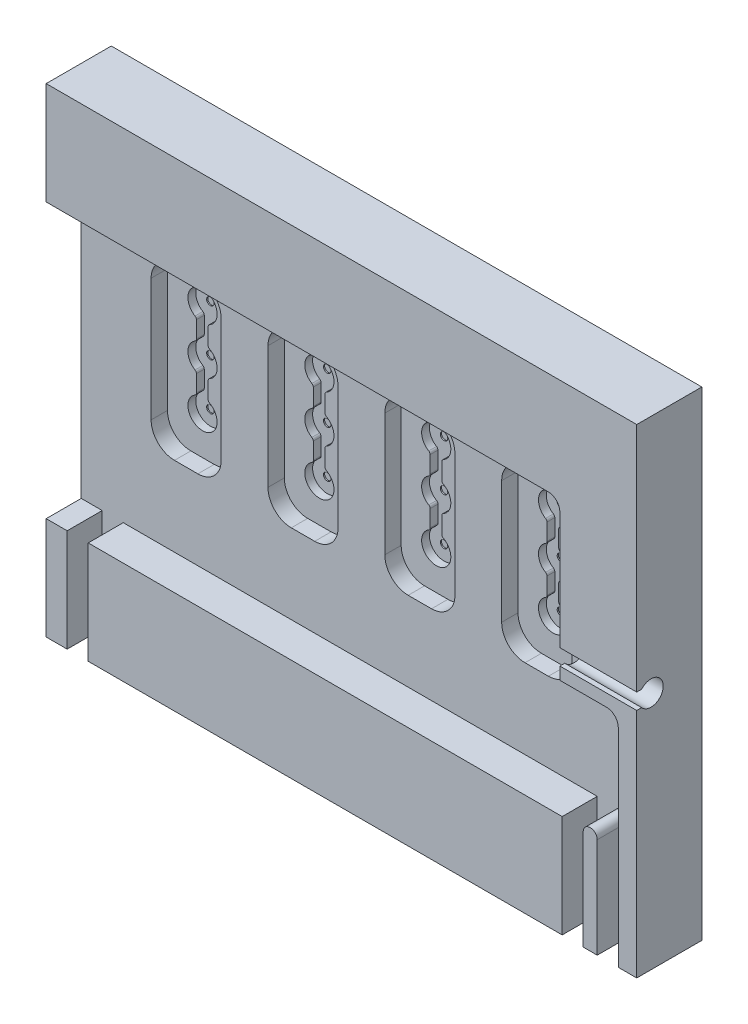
ISO-10303-21;
HEADER;
FILE_DESCRIPTION(('STEP AP214'),'2;1');
FILE_NAME('part.step','',(''),(''),'','','');
FILE_SCHEMA(('AUTOMOTIVE_DESIGN { 1 0 10303 214 1 1 1 1 }'));
ENDSEC;
DATA;
#1=APPLICATION_CONTEXT('core data for automotive mechanical design processes');
#2=APPLICATION_PROTOCOL_DEFINITION('international standard','automotive_design',2000,#1);
#3=PRODUCT_CONTEXT('',#1,'mechanical');
#4=PRODUCT('Part','Part','',(#3));
#5=PRODUCT_RELATED_PRODUCT_CATEGORY('part','',(#4));
#6=PRODUCT_DEFINITION_FORMATION('','',#4);
#7=PRODUCT_DEFINITION_CONTEXT('part definition',#1,'design');
#8=PRODUCT_DEFINITION('design','',#6,#7);
#9=PRODUCT_DEFINITION_SHAPE('','',#8);
#10=(LENGTH_UNIT() NAMED_UNIT(*) SI_UNIT(.MILLI.,.METRE.));
#11=(NAMED_UNIT(*) PLANE_ANGLE_UNIT() SI_UNIT($,.RADIAN.));
#12=(NAMED_UNIT(*) SI_UNIT($,.STERADIAN.) SOLID_ANGLE_UNIT());
#13=UNCERTAINTY_MEASURE_WITH_UNIT(LENGTH_MEASURE(1.E-05),#10,'distance_accuracy_value','');
#14=(GEOMETRIC_REPRESENTATION_CONTEXT(3) GLOBAL_UNCERTAINTY_ASSIGNED_CONTEXT((#13)) GLOBAL_UNIT_ASSIGNED_CONTEXT((#10,
#11,#12)) REPRESENTATION_CONTEXT('',''));
#15=CARTESIAN_POINT('',(0.,0.,0.));
#16=DIRECTION('',(0.,0.,1.));
#17=DIRECTION('',(1.,0.,0.));
#18=AXIS2_PLACEMENT_3D('',#15,#16,#17);
#19=CARTESIAN_POINT('',(44.,14.,5.57));
#20=DIRECTION('',(0.,0.,1.));
#21=DIRECTION('',(1.,0.,0.));
#22=AXIS2_PLACEMENT_3D('',#19,#20,#21);
#23=PLANE('',#22);
#24=DIRECTION('',(-1.,0.,0.));
#25=VECTOR('',#24,1.);
#26=CARTESIAN_POINT('',(44.,4.,5.57));
#27=LINE('',#26,#25);
#28=CARTESIAN_POINT('',(44.2,4.,5.57));
#29=VERTEX_POINT('',#28);
#30=CARTESIAN_POINT('',(3.63601088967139,3.99999999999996,5.57));
#31=VERTEX_POINT('',#30);
#32=EDGE_CURVE('E797',#29,#31,#27,.T.);
#33=ORIENTED_EDGE('',*,*,#32,.T.);
#34=DIRECTION('',(0.,-1.,0.));
#35=VECTOR('',#34,1.);
#36=CARTESIAN_POINT('',(3.6360108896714,-37.2914041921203,5.57));
#37=LINE('',#36,#35);
#38=CARTESIAN_POINT('',(3.63601088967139,-4.77500000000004,5.57));
#39=VERTEX_POINT('',#38);
#40=EDGE_CURVE('E782',#31,#39,#37,.T.);
#41=ORIENTED_EDGE('',*,*,#40,.T.);
#42=DIRECTION('',(1.,0.,0.));
#43=VECTOR('',#42,1.);
#44=CARTESIAN_POINT('',(0.0399999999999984,-4.77500000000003,5.57));
#45=LINE('',#44,#43);
#46=CARTESIAN_POINT('',(44.2,-4.77500000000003,5.57));
#47=VERTEX_POINT('',#46);
#48=EDGE_CURVE('E1869',#39,#47,#45,.T.);
#49=ORIENTED_EDGE('',*,*,#48,.T.);
#50=DIRECTION('',(0.,1.,0.));
#51=VECTOR('',#50,1.);
#52=CARTESIAN_POINT('',(44.2,4.,5.57));
#53=LINE('',#52,#51);
#54=EDGE_CURVE('E804',#47,#29,#53,.T.);
#55=ORIENTED_EDGE('',*,*,#54,.T.);
#56=EDGE_LOOP('',(#33,#41,#49,#55));
#57=FACE_BOUND('',#56,.T.);
#58=ADVANCED_FACE('F35',(#57),#23,.T.);
#59=CARTESIAN_POINT('',(6.00000000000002,4.,2.57));
#60=DIRECTION('',(0.,-1.,0.));
#61=DIRECTION('',(0.,0.,-1.));
#62=AXIS2_PLACEMENT_3D('',#59,#60,#61);
#63=PLANE('',#62);
#64=DIRECTION('',(0.,0.,1.));
#65=VECTOR('',#64,1.);
#66=CARTESIAN_POINT('',(3.63601088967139,3.99999999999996,-6.38771315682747));
#67=LINE('',#66,#65);
#68=CARTESIAN_POINT('',(3.63601088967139,3.99999999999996,2.57));
#69=VERTEX_POINT('',#68);
#70=EDGE_CURVE('E785',#69,#31,#67,.T.);
#71=ORIENTED_EDGE('',*,*,#70,.T.);
#72=ORIENTED_EDGE('',*,*,#32,.F.);
#73=DIRECTION('',(0.,0.,1.));
#74=VECTOR('',#73,1.);
#75=CARTESIAN_POINT('',(44.2,4.,-1.43499687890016));
#76=LINE('',#75,#74);
#77=CARTESIAN_POINT('',(44.2,4.,2.57));
#78=VERTEX_POINT('',#77);
#79=EDGE_CURVE('E1831',#78,#29,#76,.T.);
#80=ORIENTED_EDGE('',*,*,#79,.F.);
#81=DIRECTION('',(1.,0.,0.));
#82=VECTOR('',#81,1.);
#83=CARTESIAN_POINT('',(6.00000000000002,4.,2.57));
#84=LINE('',#83,#82);
#85=EDGE_CURVE('E799',#69,#78,#84,.T.);
#86=ORIENTED_EDGE('',*,*,#85,.F.);
#87=EDGE_LOOP('',(#71,#72,#80,#86));
#88=FACE_BOUND('',#87,.T.);
#89=ADVANCED_FACE('F795',(#88),#63,.F.);
#90=CARTESIAN_POINT('',(0.0399999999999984,-4.77500000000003,-50.7650689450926));
#91=DIRECTION('',(0.,-1.,0.));
#92=DIRECTION('',(0.,0.,-1.));
#93=AXIS2_PLACEMENT_3D('',#90,#91,#92);
#94=PLANE('',#93);
#95=ORIENTED_EDGE('',*,*,#48,.F.);
#96=DIRECTION('',(0.,0.,1.));
#97=VECTOR('',#96,1.);
#98=CARTESIAN_POINT('',(3.63601088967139,-4.77500000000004,-6.38771315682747));
#99=LINE('',#98,#97);
#100=CARTESIAN_POINT('',(3.63601088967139,-4.77500000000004,2.57));
#101=VERTEX_POINT('',#100);
#102=EDGE_CURVE('E788',#101,#39,#99,.T.);
#103=ORIENTED_EDGE('',*,*,#102,.F.);
#104=DIRECTION('',(-1.,0.,0.));
#105=VECTOR('',#104,1.);
#106=CARTESIAN_POINT('',(21.0025428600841,-4.77500000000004,2.57));
#107=LINE('',#106,#105);
#108=CARTESIAN_POINT('',(1.83601088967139,-4.77500000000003,2.57));
#109=VERTEX_POINT('',#108);
#110=EDGE_CURVE('E1897',#101,#109,#107,.T.);
#111=ORIENTED_EDGE('',*,*,#110,.T.);
#112=DIRECTION('',(0.,0.,1.));
#113=VECTOR('',#112,1.);
#114=CARTESIAN_POINT('',(1.83601088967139,-4.77500000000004,-6.38771315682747));
#115=LINE('',#114,#113);
#116=CARTESIAN_POINT('',(1.83601088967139,-4.77500000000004,5.57));
#117=VERTEX_POINT('',#116);
#118=EDGE_CURVE('E50',#109,#117,#115,.T.);
#119=ORIENTED_EDGE('',*,*,#118,.T.);
#120=CARTESIAN_POINT('',(0.0399999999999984,-4.77500000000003,5.57));
#121=VERTEX_POINT('',#120);
#122=EDGE_CURVE('E1866',#121,#117,#45,.T.);
#123=ORIENTED_EDGE('',*,*,#122,.F.);
#124=DIRECTION('',(0.,0.,1.));
#125=VECTOR('',#124,1.);
#126=CARTESIAN_POINT('',(0.0399999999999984,-4.77500000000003,-50.7650689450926));
#127=LINE('',#126,#125);
#128=CARTESIAN_POINT('',(0.0399999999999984,-4.77500000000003,0.));
#129=VERTEX_POINT('',#128);
#130=EDGE_CURVE('E1857',#129,#121,#127,.T.);
#131=ORIENTED_EDGE('',*,*,#130,.F.);
#132=DIRECTION('',(1.,0.,0.));
#133=VECTOR('',#132,1.);
#134=CARTESIAN_POINT('',(0.0399999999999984,-4.77500000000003,0.));
#135=LINE('',#134,#133);
#136=CARTESIAN_POINT('',(50.58,-4.77500000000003,0.));
#137=VERTEX_POINT('',#136);
#138=EDGE_CURVE('E1863',#129,#137,#135,.T.);
#139=ORIENTED_EDGE('',*,*,#138,.T.);
#140=DIRECTION('',(0.,0.,1.));
#141=VECTOR('',#140,1.);
#142=CARTESIAN_POINT('',(50.58,-4.77500000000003,-50.7650689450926));
#143=LINE('',#142,#141);
#144=CARTESIAN_POINT('',(50.58,-4.77500000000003,5.57));
#145=VERTEX_POINT('',#144);
#146=EDGE_CURVE('E1860',#137,#145,#143,.T.);
#147=ORIENTED_EDGE('',*,*,#146,.T.);
#148=CARTESIAN_POINT('',(49.,-4.77500000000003,5.57));
#149=VERTEX_POINT('',#148);
#150=EDGE_CURVE('E1874',#149,#145,#45,.T.);
#151=ORIENTED_EDGE('',*,*,#150,.F.);
#152=DIRECTION('',(0.,0.,1.));
#153=VECTOR('',#152,1.);
#154=CARTESIAN_POINT('',(49.,-4.77500000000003,-2.53300156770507));
#155=LINE('',#154,#153);
#156=CARTESIAN_POINT('',(49.,-4.77500000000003,2.57));
#157=VERTEX_POINT('',#156);
#158=EDGE_CURVE('E1884',#157,#149,#155,.T.);
#159=ORIENTED_EDGE('',*,*,#158,.F.);
#160=DIRECTION('',(-1.,0.,0.));
#161=VECTOR('',#160,1.);
#162=CARTESIAN_POINT('',(47.2,-4.77500000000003,2.57));
#163=LINE('',#162,#161);
#164=CARTESIAN_POINT('',(47.2,-4.77500000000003,2.57));
#165=VERTEX_POINT('',#164);
#166=EDGE_CURVE('E1879',#157,#165,#163,.T.);
#167=ORIENTED_EDGE('',*,*,#166,.T.);
#168=DIRECTION('',(0.,0.,1.));
#169=VECTOR('',#168,1.);
#170=CARTESIAN_POINT('',(47.2,-4.77500000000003,-2.53300156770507));
#171=LINE('',#170,#169);
#172=CARTESIAN_POINT('',(47.2,-4.77500000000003,5.57));
#173=VERTEX_POINT('',#172);
#174=EDGE_CURVE('E1885',#165,#173,#171,.T.);
#175=ORIENTED_EDGE('',*,*,#174,.T.);
#176=CARTESIAN_POINT('',(46.,-4.77500000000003,5.57));
#177=VERTEX_POINT('',#176);
#178=EDGE_CURVE('E1870',#177,#173,#45,.T.);
#179=ORIENTED_EDGE('',*,*,#178,.F.);
#180=DIRECTION('',(0.,0.,1.));
#181=VECTOR('',#180,1.);
#182=CARTESIAN_POINT('',(46.,-4.77500000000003,-2.53300156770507));
#183=LINE('',#182,#181);
#184=CARTESIAN_POINT('',(46.,-4.77500000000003,2.57));
#185=VERTEX_POINT('',#184);
#186=EDGE_CURVE('E1875',#185,#177,#183,.T.);
#187=ORIENTED_EDGE('',*,*,#186,.F.);
#188=DIRECTION('',(-1.,0.,0.));
#189=VECTOR('',#188,1.);
#190=CARTESIAN_POINT('',(44.2,-4.77500000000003,2.57));
#191=LINE('',#190,#189);
#192=CARTESIAN_POINT('',(44.2,-4.77500000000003,2.57));
#193=VERTEX_POINT('',#192);
#194=EDGE_CURVE('E1871',#185,#193,#191,.T.);
#195=ORIENTED_EDGE('',*,*,#194,.T.);
#196=DIRECTION('',(0.,0.,1.));
#197=VECTOR('',#196,1.);
#198=CARTESIAN_POINT('',(44.2,-4.77500000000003,-2.53300156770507));
#199=LINE('',#198,#197);
#200=EDGE_CURVE('E1876',#193,#47,#199,.T.);
#201=ORIENTED_EDGE('',*,*,#200,.T.);
#202=EDGE_LOOP('',(#95,#103,#111,#119,#123,#131,#139,#147,#151,#159,#167,#175,#179,#187,#195,#201));
#203=FACE_BOUND('',#202,.T.);
#204=ADVANCED_FACE('F1915',(#203),#94,.T.);
#205=CARTESIAN_POINT('',(43.,26.47,2.57));
#206=DIRECTION('',(0.,0.,-1.));
#207=DIRECTION('',(-1.,0.,0.));
#208=AXIS2_PLACEMENT_3D('',#205,#206,#207);
#209=CYLINDRICAL_SURFACE('',#208,1.);
#210=DIRECTION('',(0.,0.,1.));
#211=VECTOR('',#210,1.);
#212=CARTESIAN_POINT('',(43.,27.47,2.57));
#213=LINE('',#212,#211);
#214=CARTESIAN_POINT('',(43.,27.47,2.57));
#215=VERTEX_POINT('',#214);
#216=CARTESIAN_POINT('',(43.,27.47,5.57));
#217=VERTEX_POINT('',#216);
#218=EDGE_CURVE('E1798',#215,#217,#213,.T.);
#219=ORIENTED_EDGE('',*,*,#218,.F.);
#220=CARTESIAN_POINT('',(43.,26.47,2.57));
#221=DIRECTION('',(0.,0.,1.));
#222=DIRECTION('',(1.,0.,0.));
#223=AXIS2_PLACEMENT_3D('',#220,#221,#222);
#224=CIRCLE('',#223,1.);
#225=CARTESIAN_POINT('',(44.,26.47,2.57));
#226=VERTEX_POINT('',#225);
#227=EDGE_CURVE('E43',#226,#215,#224,.T.);
#228=ORIENTED_EDGE('',*,*,#227,.F.);
#229=DIRECTION('',(0.,0.,1.));
#230=VECTOR('',#229,1.);
#231=CARTESIAN_POINT('',(44.,26.47,2.57));
#232=LINE('',#231,#230);
#233=CARTESIAN_POINT('',(44.,26.47,5.57));
#234=VERTEX_POINT('',#233);
#235=EDGE_CURVE('E1801',#234,#226,#232,.F.);
#236=ORIENTED_EDGE('',*,*,#235,.F.);
#237=CARTESIAN_POINT('',(43.,26.47,5.57));
#238=DIRECTION('',(0.,0.,1.));
#239=DIRECTION('',(1.,0.,0.));
#240=AXIS2_PLACEMENT_3D('',#237,#238,#239);
#241=CIRCLE('',#240,1.);
#242=EDGE_CURVE('E11',#234,#217,#241,.T.);
#243=ORIENTED_EDGE('',*,*,#242,.T.);
#244=EDGE_LOOP('',(#219,#228,#236,#243));
#245=FACE_BOUND('',#244,.T.);
#246=ADVANCED_FACE('F37',(#245),#209,.F.);
#247=CARTESIAN_POINT('',(48.,13.,-13.0824758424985));
#248=DIRECTION('',(0.,0.,-1.));
#249=DIRECTION('',(-1.,0.,0.));
#250=AXIS2_PLACEMENT_3D('',#247,#248,#249);
#251=CYLINDRICAL_SURFACE('',#250,1.);
#252=DIRECTION('',(0.,0.,1.));
#253=VECTOR('',#252,1.);
#254=CARTESIAN_POINT('',(48.,14.,-13.0824758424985));
#255=LINE('',#254,#253);
#256=CARTESIAN_POINT('',(48.,14.,2.57));
#257=VERTEX_POINT('',#256);
#258=CARTESIAN_POINT('',(48.,14.,5.57));
#259=VERTEX_POINT('',#258);
#260=EDGE_CURVE('E1779',#257,#259,#255,.T.);
#261=ORIENTED_EDGE('',*,*,#260,.F.);
#262=CARTESIAN_POINT('',(48.,13.,2.57));
#263=DIRECTION('',(0.,0.,1.));
#264=DIRECTION('',(1.,0.,0.));
#265=AXIS2_PLACEMENT_3D('',#262,#263,#264);
#266=CIRCLE('',#265,1.);
#267=CARTESIAN_POINT('',(49.,13.,2.57));
#268=VERTEX_POINT('',#267);
#269=EDGE_CURVE('E1794',#268,#257,#266,.T.);
#270=ORIENTED_EDGE('',*,*,#269,.F.);
#271=DIRECTION('',(0.,0.,1.));
#272=VECTOR('',#271,1.);
#273=CARTESIAN_POINT('',(49.,13.,-13.0824758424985));
#274=LINE('',#273,#272);
#275=CARTESIAN_POINT('',(49.,13.,5.57));
#276=VERTEX_POINT('',#275);
#277=EDGE_CURVE('E1791',#276,#268,#274,.F.);
#278=ORIENTED_EDGE('',*,*,#277,.F.);
#279=CARTESIAN_POINT('',(48.,13.,5.57));
#280=DIRECTION('',(0.,0.,1.));
#281=DIRECTION('',(1.,0.,0.));
#282=AXIS2_PLACEMENT_3D('',#279,#280,#281);
#283=CIRCLE('',#282,1.);
#284=EDGE_CURVE('E1796',#276,#259,#283,.T.);
#285=ORIENTED_EDGE('',*,*,#284,.T.);
#286=EDGE_LOOP('',(#261,#270,#278,#285));
#287=FACE_BOUND('',#286,.T.);
#288=ADVANCED_FACE('F1982',(#287),#251,.F.);
#289=ORIENTED_EDGE('',*,*,#178,.T.);
#290=DIRECTION('',(0.,1.,0.));
#291=VECTOR('',#290,1.);
#292=CARTESIAN_POINT('',(47.2,0.,5.57));
#293=LINE('',#292,#291);
#294=CARTESIAN_POINT('',(47.2,3.78233578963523,5.57));
#295=VERTEX_POINT('',#294);
#296=EDGE_CURVE('E811',#173,#295,#293,.T.);
#297=ORIENTED_EDGE('',*,*,#296,.T.);
#298=CARTESIAN_POINT('',(46.6,3.78233578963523,5.57));
#299=DIRECTION('',(0.,0.,1.));
#300=DIRECTION('',(1.,0.,0.));
#301=AXIS2_PLACEMENT_3D('',#298,#299,#300);
#302=CIRCLE('',#301,0.599999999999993);
#303=CARTESIAN_POINT('',(46.,3.78233578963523,5.57));
#304=VERTEX_POINT('',#303);
#305=EDGE_CURVE('E1842',#295,#304,#302,.T.);
#306=ORIENTED_EDGE('',*,*,#305,.T.);
#307=DIRECTION('',(0.,1.,0.));
#308=VECTOR('',#307,1.);
#309=CARTESIAN_POINT('',(46.,3.78233578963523,5.57));
#310=LINE('',#309,#308);
#311=EDGE_CURVE('E1838',#177,#304,#310,.T.);
#312=ORIENTED_EDGE('',*,*,#311,.F.);
#313=EDGE_LOOP('',(#289,#297,#306,#312));
#314=FACE_BOUND('',#313,.T.);
#315=ADVANCED_FACE('F1936',(#314),#23,.T.);
#316=DIRECTION('',(0.,-1.,0.));
#317=VECTOR('',#316,1.);
#318=CARTESIAN_POINT('',(1.83601088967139,-37.2914041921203,5.57));
#319=LINE('',#318,#317);
#320=CARTESIAN_POINT('',(1.83601088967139,3.99999999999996,5.57));
#321=VERTEX_POINT('',#320);
#322=EDGE_CURVE('E792',#321,#117,#319,.T.);
#323=ORIENTED_EDGE('',*,*,#322,.F.);
#324=CARTESIAN_POINT('',(0.04,3.99999999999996,5.57));
#325=VERTEX_POINT('',#324);
#326=EDGE_CURVE('E806',#321,#325,#27,.T.);
#327=ORIENTED_EDGE('',*,*,#326,.T.);
#328=DIRECTION('',(0.,1.,0.));
#329=VECTOR('',#328,1.);
#330=CARTESIAN_POINT('',(0.04,0.,5.57));
#331=LINE('',#330,#329);
#332=EDGE_CURVE('E1825',#121,#325,#331,.T.);
#333=ORIENTED_EDGE('',*,*,#332,.F.);
#334=ORIENTED_EDGE('',*,*,#122,.T.);
#335=EDGE_LOOP('',(#323,#327,#333,#334));
#336=FACE_BOUND('',#335,.T.);
#337=ADVANCED_FACE('F1913',(#336),#23,.T.);
#338=CARTESIAN_POINT('',(0.,31.47,0.));
#339=DIRECTION('',(0.,0.,-1.));
#340=DIRECTION('',(-1.,0.,0.));
#341=AXIS2_PLACEMENT_3D('',#338,#339,#340);
#342=PLANE('',#341);
#343=DIRECTION('',(0.,1.,0.));
#344=VECTOR('',#343,1.);
#345=CARTESIAN_POINT('',(50.58,31.47,0.));
#346=LINE('',#345,#344);
#347=CARTESIAN_POINT('',(50.58,36.245,0.));
#348=VERTEX_POINT('',#347);
#349=EDGE_CURVE('E865',#137,#348,#346,.T.);
#350=ORIENTED_EDGE('',*,*,#349,.F.);
#351=ORIENTED_EDGE('',*,*,#138,.F.);
#352=DIRECTION('',(0.,-1.,0.));
#353=VECTOR('',#352,1.);
#354=CARTESIAN_POINT('',(0.04,31.47,0.));
#355=LINE('',#354,#353);
#356=CARTESIAN_POINT('',(0.0400000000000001,36.245,0.));
#357=VERTEX_POINT('',#356);
#358=EDGE_CURVE('E1828',#357,#129,#355,.T.);
#359=ORIENTED_EDGE('',*,*,#358,.F.);
#360=DIRECTION('',(-1.,0.,0.));
#361=VECTOR('',#360,1.);
#362=CARTESIAN_POINT('',(0.0400000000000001,36.245,0.));
#363=LINE('',#362,#361);
#364=EDGE_CURVE('E1849',#348,#357,#363,.T.);
#365=ORIENTED_EDGE('',*,*,#364,.F.);
#366=EDGE_LOOP('',(#350,#351,#359,#365));
#367=FACE_BOUND('',#366,.T.);
#368=ADVANCED_FACE('F1951',(#367),#342,.T.);
#369=ORIENTED_EDGE('',*,*,#326,.F.);
#370=DIRECTION('',(0.,0.,1.));
#371=VECTOR('',#370,1.);
#372=CARTESIAN_POINT('',(1.83601088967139,3.99999999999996,-6.38771315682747));
#373=LINE('',#372,#371);
#374=CARTESIAN_POINT('',(1.83601088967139,3.99999999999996,2.57));
#375=VERTEX_POINT('',#374);
#376=EDGE_CURVE('E800',#375,#321,#373,.T.);
#377=ORIENTED_EDGE('',*,*,#376,.F.);
#378=CARTESIAN_POINT('',(0.04,3.99999999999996,2.57));
#379=VERTEX_POINT('',#378);
#380=EDGE_CURVE('E1764',#379,#375,#84,.T.);
#381=ORIENTED_EDGE('',*,*,#380,.F.);
#382=DIRECTION('',(0.,0.,-1.));
#383=VECTOR('',#382,1.);
#384=CARTESIAN_POINT('',(0.04,3.99999999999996,5.57));
#385=LINE('',#384,#383);
#386=EDGE_CURVE('E1821',#325,#379,#385,.T.);
#387=ORIENTED_EDGE('',*,*,#386,.F.);
#388=EDGE_LOOP('',(#369,#377,#381,#387));
#389=FACE_BOUND('',#388,.T.);
#390=ADVANCED_FACE('F1907',(#389),#63,.F.);
#391=CARTESIAN_POINT('',(6.00000000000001,27.47,2.57));
#392=DIRECTION('',(0.,1.,0.));
#393=DIRECTION('',(0.,0.,1.));
#394=AXIS2_PLACEMENT_3D('',#391,#392,#393);
#395=PLANE('',#394);
#396=DIRECTION('',(-1.,0.,0.));
#397=VECTOR('',#396,1.);
#398=CARTESIAN_POINT('',(44.,27.47,2.57));
#399=LINE('',#398,#397);
#400=CARTESIAN_POINT('',(0.04,27.47,2.57));
#401=VERTEX_POINT('',#400);
#402=EDGE_CURVE('E1762',#215,#401,#399,.T.);
#403=ORIENTED_EDGE('',*,*,#402,.F.);
#404=ORIENTED_EDGE('',*,*,#218,.T.);
#405=DIRECTION('',(1.,0.,0.));
#406=VECTOR('',#405,1.);
#407=CARTESIAN_POINT('',(0.,27.47,5.57));
#408=LINE('',#407,#406);
#409=CARTESIAN_POINT('',(0.04,27.47,5.57));
#410=VERTEX_POINT('',#409);
#411=EDGE_CURVE('E833',#410,#217,#408,.T.);
#412=ORIENTED_EDGE('',*,*,#411,.F.);
#413=DIRECTION('',(0.,0.,1.));
#414=VECTOR('',#413,1.);
#415=CARTESIAN_POINT('',(0.04,27.47,2.57));
#416=LINE('',#415,#414);
#417=EDGE_CURVE('E1817',#401,#410,#416,.T.);
#418=ORIENTED_EDGE('',*,*,#417,.F.);
#419=EDGE_LOOP('',(#403,#404,#412,#418));
#420=FACE_BOUND('',#419,.T.);
#421=ADVANCED_FACE('F1816',(#420),#395,.F.);
#422=CARTESIAN_POINT('',(42.,6.,2.57));
#423=DIRECTION('',(0.,0.,1.));
#424=DIRECTION('',(1.,0.,0.));
#425=AXIS2_PLACEMENT_3D('',#422,#423,#424);
#426=PLANE('',#425);
#427=DIRECTION('',(0.,1.,0.));
#428=VECTOR('',#427,1.);
#429=CARTESIAN_POINT('',(44.,27.47,2.57));
#430=LINE('',#429,#428);
#431=CARTESIAN_POINT('',(44.,14.,2.57));
#432=VERTEX_POINT('',#431);
#433=EDGE_CURVE('E1715',#432,#226,#430,.T.);
#434=ORIENTED_EDGE('',*,*,#433,.T.);
#435=ORIENTED_EDGE('',*,*,#227,.T.);
#436=ORIENTED_EDGE('',*,*,#402,.T.);
#437=DIRECTION('',(0.,1.,0.));
#438=VECTOR('',#437,1.);
#439=CARTESIAN_POINT('',(0.04,3.99999999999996,2.57));
#440=LINE('',#439,#438);
#441=EDGE_CURVE('E1820',#379,#401,#440,.T.);
#442=ORIENTED_EDGE('',*,*,#441,.F.);
#443=ORIENTED_EDGE('',*,*,#380,.T.);
#444=DIRECTION('',(0.,1.,0.));
#445=VECTOR('',#444,1.);
#446=CARTESIAN_POINT('',(1.83601088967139,-37.2914041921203,2.57));
#447=LINE('',#446,#445);
#448=EDGE_CURVE('E1894',#109,#375,#447,.T.);
#449=ORIENTED_EDGE('',*,*,#448,.F.);
#450=ORIENTED_EDGE('',*,*,#110,.F.);
#451=DIRECTION('',(0.,1.,0.));
#452=VECTOR('',#451,1.);
#453=CARTESIAN_POINT('',(3.6360108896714,-37.2914041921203,2.57));
#454=LINE('',#453,#452);
#455=EDGE_CURVE('E1888',#101,#69,#454,.T.);
#456=ORIENTED_EDGE('',*,*,#455,.T.);
#457=ORIENTED_EDGE('',*,*,#85,.T.);
#458=DIRECTION('',(0.,-1.,0.));
#459=VECTOR('',#458,1.);
#460=CARTESIAN_POINT('',(44.2,4.,2.57));
#461=LINE('',#460,#459);
#462=EDGE_CURVE('E1830',#78,#193,#461,.T.);
#463=ORIENTED_EDGE('',*,*,#462,.T.);
#464=ORIENTED_EDGE('',*,*,#194,.F.);
#465=DIRECTION('',(0.,-1.,0.));
#466=VECTOR('',#465,1.);
#467=CARTESIAN_POINT('',(46.,3.78233578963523,2.57));
#468=LINE('',#467,#466);
#469=CARTESIAN_POINT('',(46.,3.78233578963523,2.57));
#470=VERTEX_POINT('',#469);
#471=EDGE_CURVE('E1837',#470,#185,#468,.T.);
#472=ORIENTED_EDGE('',*,*,#471,.F.);
#473=CARTESIAN_POINT('',(46.6,3.78233578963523,2.57));
#474=DIRECTION('',(0.,0.,1.));
#475=DIRECTION('',(1.,0.,0.));
#476=AXIS2_PLACEMENT_3D('',#473,#474,#475);
#477=CIRCLE('',#476,0.599999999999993);
#478=CARTESIAN_POINT('',(47.2,3.78233578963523,2.57));
#479=VERTEX_POINT('',#478);
#480=EDGE_CURVE('E1840',#470,#479,#477,.F.);
#481=ORIENTED_EDGE('',*,*,#480,.T.);
#482=DIRECTION('',(0.,1.,0.));
#483=VECTOR('',#482,1.);
#484=CARTESIAN_POINT('',(47.2,0.,2.57));
#485=LINE('',#484,#483);
#486=EDGE_CURVE('E842',#165,#479,#485,.T.);
#487=ORIENTED_EDGE('',*,*,#486,.F.);
#488=ORIENTED_EDGE('',*,*,#166,.F.);
#489=DIRECTION('',(0.,-1.,0.));
#490=VECTOR('',#489,1.);
#491=CARTESIAN_POINT('',(49.,14.,2.57));
#492=LINE('',#491,#490);
#493=EDGE_CURVE('E845',#268,#157,#492,.T.);
#494=ORIENTED_EDGE('',*,*,#493,.F.);
#495=ORIENTED_EDGE('',*,*,#269,.T.);
#496=DIRECTION('',(1.,0.,0.));
#497=VECTOR('',#496,1.);
#498=CARTESIAN_POINT('',(44.,14.,2.57));
#499=LINE('',#498,#497);
#500=EDGE_CURVE('E848',#432,#257,#499,.T.);
#501=ORIENTED_EDGE('',*,*,#500,.F.);
#502=EDGE_LOOP('',(#434,#435,#436,#442,#443,#449,#450,#456,#457,#463,#464,#472,#481,#487,#488,
#494,#495,#501));
#503=FACE_BOUND('',#502,.T.);
#504=CARTESIAN_POINT('',(8.02,23.3098188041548,2.57));
#505=DIRECTION('',(0.,0.,1.));
#506=DIRECTION('',(-1.,0.,0.));
#507=AXIS2_PLACEMENT_3D('',#504,#505,#506);
#508=CIRCLE('',#507,2.);
#509=CARTESIAN_POINT('',(8.02000000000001,25.3098188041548,2.57));
#510=VERTEX_POINT('',#509);
#511=CARTESIAN_POINT('',(6.02,23.3098188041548,2.57));
#512=VERTEX_POINT('',#511);
#513=EDGE_CURVE('E1510',#510,#512,#508,.T.);
#514=ORIENTED_EDGE('',*,*,#513,.F.);
#515=DIRECTION('',(-1.,0.,0.));
#516=VECTOR('',#515,1.);
#517=CARTESIAN_POINT('',(10.02,25.3098188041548,2.57));
#518=LINE('',#517,#516);
#519=CARTESIAN_POINT('',(10.02,25.3098188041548,2.57));
#520=VERTEX_POINT('',#519);
#521=EDGE_CURVE('E1574',#520,#510,#518,.T.);
#522=ORIENTED_EDGE('',*,*,#521,.F.);
#523=CARTESIAN_POINT('',(10.02,23.3098188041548,2.57));
#524=DIRECTION('',(0.,0.,1.));
#525=DIRECTION('',(-1.,0.,0.));
#526=AXIS2_PLACEMENT_3D('',#523,#524,#525);
#527=CIRCLE('',#526,2.);
#528=CARTESIAN_POINT('',(12.02,23.3098188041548,2.57));
#529=VERTEX_POINT('',#528);
#530=EDGE_CURVE('E1571',#529,#520,#527,.T.);
#531=ORIENTED_EDGE('',*,*,#530,.F.);
#532=DIRECTION('',(0.,1.,0.));
#533=VECTOR('',#532,1.);
#534=CARTESIAN_POINT('',(12.02,12.8101811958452,2.57));
#535=LINE('',#534,#533);
#536=CARTESIAN_POINT('',(12.02,12.8101811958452,2.57));
#537=VERTEX_POINT('',#536);
#538=EDGE_CURVE('E1568',#537,#529,#535,.T.);
#539=ORIENTED_EDGE('',*,*,#538,.F.);
#540=CARTESIAN_POINT('',(10.02,12.8101811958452,2.57));
#541=DIRECTION('',(0.,0.,1.));
#542=DIRECTION('',(-1.,0.,0.));
#543=AXIS2_PLACEMENT_3D('',#540,#541,#542);
#544=CIRCLE('',#543,2.);
#545=CARTESIAN_POINT('',(10.02,10.8101811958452,2.57));
#546=VERTEX_POINT('',#545);
#547=EDGE_CURVE('E1565',#546,#537,#544,.T.);
#548=ORIENTED_EDGE('',*,*,#547,.F.);
#549=DIRECTION('',(1.,0.,0.));
#550=VECTOR('',#549,1.);
#551=CARTESIAN_POINT('',(10.02,10.8101811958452,2.57));
#552=LINE('',#551,#550);
#553=CARTESIAN_POINT('',(8.02000000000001,10.8101811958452,2.57));
#554=VERTEX_POINT('',#553);
#555=EDGE_CURVE('E1562',#554,#546,#552,.T.);
#556=ORIENTED_EDGE('',*,*,#555,.F.);
#557=CARTESIAN_POINT('',(8.02,12.8101811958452,2.57));
#558=DIRECTION('',(0.,0.,1.));
#559=DIRECTION('',(-1.,0.,0.));
#560=AXIS2_PLACEMENT_3D('',#557,#558,#559);
#561=CIRCLE('',#560,2.);
#562=CARTESIAN_POINT('',(6.02,12.8101811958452,2.57));
#563=VERTEX_POINT('',#562);
#564=EDGE_CURVE('E1559',#563,#554,#561,.T.);
#565=ORIENTED_EDGE('',*,*,#564,.F.);
#566=DIRECTION('',(0.,-1.,0.));
#567=VECTOR('',#566,1.);
#568=CARTESIAN_POINT('',(6.02,12.8101811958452,2.57));
#569=LINE('',#568,#567);
#570=EDGE_CURVE('E1556',#512,#563,#569,.T.);
#571=ORIENTED_EDGE('',*,*,#570,.F.);
#572=EDGE_LOOP('',(#514,#522,#531,#539,#548,#556,#565,#571));
#573=FACE_BOUND('',#572,.T.);
#574=CARTESIAN_POINT('',(18.02,23.3098188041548,2.57));
#575=DIRECTION('',(0.,0.,1.));
#576=DIRECTION('',(-1.,0.,0.));
#577=AXIS2_PLACEMENT_3D('',#574,#575,#576);
#578=CIRCLE('',#577,2.);
#579=CARTESIAN_POINT('',(18.02,25.3098188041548,2.57));
#580=VERTEX_POINT('',#579);
#581=CARTESIAN_POINT('',(16.02,23.3098188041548,2.57));
#582=VERTEX_POINT('',#581);
#583=EDGE_CURVE('E1157',#580,#582,#578,.T.);
#584=ORIENTED_EDGE('',*,*,#583,.F.);
#585=DIRECTION('',(-1.,0.,0.));
#586=VECTOR('',#585,1.);
#587=CARTESIAN_POINT('',(20.02,25.3098188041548,2.57));
#588=LINE('',#587,#586);
#589=CARTESIAN_POINT('',(20.02,25.3098188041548,2.57));
#590=VERTEX_POINT('',#589);
#591=EDGE_CURVE('E1177',#590,#580,#588,.T.);
#592=ORIENTED_EDGE('',*,*,#591,.F.);
#593=CARTESIAN_POINT('',(20.02,23.3098188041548,2.57));
#594=DIRECTION('',(0.,0.,1.));
#595=DIRECTION('',(-1.,0.,0.));
#596=AXIS2_PLACEMENT_3D('',#593,#594,#595);
#597=CIRCLE('',#596,2.);
#598=CARTESIAN_POINT('',(22.02,23.3098188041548,2.57));
#599=VERTEX_POINT('',#598);
#600=EDGE_CURVE('E1174',#599,#590,#597,.T.);
#601=ORIENTED_EDGE('',*,*,#600,.F.);
#602=DIRECTION('',(0.,1.,0.));
#603=VECTOR('',#602,1.);
#604=CARTESIAN_POINT('',(22.02,12.8101811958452,2.57));
#605=LINE('',#604,#603);
#606=CARTESIAN_POINT('',(22.02,12.8101811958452,2.57));
#607=VERTEX_POINT('',#606);
#608=EDGE_CURVE('E1171',#607,#599,#605,.T.);
#609=ORIENTED_EDGE('',*,*,#608,.F.);
#610=CARTESIAN_POINT('',(20.02,12.8101811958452,2.57));
#611=DIRECTION('',(0.,0.,1.));
#612=DIRECTION('',(-1.,0.,0.));
#613=AXIS2_PLACEMENT_3D('',#610,#611,#612);
#614=CIRCLE('',#613,2.);
#615=CARTESIAN_POINT('',(20.02,10.8101811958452,2.57));
#616=VERTEX_POINT('',#615);
#617=EDGE_CURVE('E1168',#616,#607,#614,.T.);
#618=ORIENTED_EDGE('',*,*,#617,.F.);
#619=DIRECTION('',(1.,0.,0.));
#620=VECTOR('',#619,1.);
#621=CARTESIAN_POINT('',(20.02,10.8101811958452,2.57));
#622=LINE('',#621,#620);
#623=CARTESIAN_POINT('',(18.02,10.8101811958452,2.57));
#624=VERTEX_POINT('',#623);
#625=EDGE_CURVE('E1165',#624,#616,#622,.T.);
#626=ORIENTED_EDGE('',*,*,#625,.F.);
#627=CARTESIAN_POINT('',(18.02,12.8101811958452,2.57));
#628=DIRECTION('',(0.,0.,1.));
#629=DIRECTION('',(-1.,0.,0.));
#630=AXIS2_PLACEMENT_3D('',#627,#628,#629);
#631=CIRCLE('',#630,2.);
#632=CARTESIAN_POINT('',(16.02,12.8101811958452,2.57));
#633=VERTEX_POINT('',#632);
#634=EDGE_CURVE('E1162',#633,#624,#631,.T.);
#635=ORIENTED_EDGE('',*,*,#634,.F.);
#636=DIRECTION('',(0.,-1.,0.));
#637=VECTOR('',#636,1.);
#638=CARTESIAN_POINT('',(16.02,12.8101811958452,2.57));
#639=LINE('',#638,#637);
#640=EDGE_CURVE('E1159',#582,#633,#639,.T.);
#641=ORIENTED_EDGE('',*,*,#640,.F.);
#642=EDGE_LOOP('',(#584,#592,#601,#609,#618,#626,#635,#641));
#643=FACE_BOUND('',#642,.T.);
#644=CARTESIAN_POINT('',(28.02,23.3098188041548,2.57));
#645=DIRECTION('',(0.,0.,1.));
#646=DIRECTION('',(-1.,0.,0.));
#647=AXIS2_PLACEMENT_3D('',#644,#645,#646);
#648=CIRCLE('',#647,2.);
#649=CARTESIAN_POINT('',(28.02,25.3098188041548,2.57));
#650=VERTEX_POINT('',#649);
#651=CARTESIAN_POINT('',(26.02,23.3098188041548,2.57));
#652=VERTEX_POINT('',#651);
#653=EDGE_CURVE('E1048',#650,#652,#648,.T.);
#654=ORIENTED_EDGE('',*,*,#653,.F.);
#655=DIRECTION('',(-1.,0.,0.));
#656=VECTOR('',#655,1.);
#657=CARTESIAN_POINT('',(30.02,25.3098188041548,2.57));
#658=LINE('',#657,#656);
#659=CARTESIAN_POINT('',(30.02,25.3098188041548,2.57));
#660=VERTEX_POINT('',#659);
#661=EDGE_CURVE('E1068',#660,#650,#658,.T.);
#662=ORIENTED_EDGE('',*,*,#661,.F.);
#663=CARTESIAN_POINT('',(30.02,23.3098188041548,2.57));
#664=DIRECTION('',(0.,0.,1.));
#665=DIRECTION('',(-1.,0.,0.));
#666=AXIS2_PLACEMENT_3D('',#663,#664,#665);
#667=CIRCLE('',#666,2.);
#668=CARTESIAN_POINT('',(32.02,23.3098188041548,2.57));
#669=VERTEX_POINT('',#668);
#670=EDGE_CURVE('E1065',#669,#660,#667,.T.);
#671=ORIENTED_EDGE('',*,*,#670,.F.);
#672=DIRECTION('',(0.,1.,0.));
#673=VECTOR('',#672,1.);
#674=CARTESIAN_POINT('',(32.02,12.8101811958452,2.57));
#675=LINE('',#674,#673);
#676=CARTESIAN_POINT('',(32.02,12.8101811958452,2.57));
#677=VERTEX_POINT('',#676);
#678=EDGE_CURVE('E1062',#677,#669,#675,.T.);
#679=ORIENTED_EDGE('',*,*,#678,.F.);
#680=CARTESIAN_POINT('',(30.02,12.8101811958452,2.57));
#681=DIRECTION('',(0.,0.,1.));
#682=DIRECTION('',(-1.,0.,0.));
#683=AXIS2_PLACEMENT_3D('',#680,#681,#682);
#684=CIRCLE('',#683,2.);
#685=CARTESIAN_POINT('',(30.02,10.8101811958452,2.57));
#686=VERTEX_POINT('',#685);
#687=EDGE_CURVE('E1059',#686,#677,#684,.T.);
#688=ORIENTED_EDGE('',*,*,#687,.F.);
#689=DIRECTION('',(1.,0.,0.));
#690=VECTOR('',#689,1.);
#691=CARTESIAN_POINT('',(30.02,10.8101811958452,2.57));
#692=LINE('',#691,#690);
#693=CARTESIAN_POINT('',(28.02,10.8101811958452,2.57));
#694=VERTEX_POINT('',#693);
#695=EDGE_CURVE('E1056',#694,#686,#692,.T.);
#696=ORIENTED_EDGE('',*,*,#695,.F.);
#697=CARTESIAN_POINT('',(28.02,12.8101811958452,2.57));
#698=DIRECTION('',(0.,0.,1.));
#699=DIRECTION('',(-1.,0.,0.));
#700=AXIS2_PLACEMENT_3D('',#697,#698,#699);
#701=CIRCLE('',#700,2.);
#702=CARTESIAN_POINT('',(26.02,12.8101811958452,2.57));
#703=VERTEX_POINT('',#702);
#704=EDGE_CURVE('E1053',#703,#694,#701,.T.);
#705=ORIENTED_EDGE('',*,*,#704,.F.);
#706=DIRECTION('',(0.,-1.,0.));
#707=VECTOR('',#706,1.);
#708=CARTESIAN_POINT('',(26.02,12.8101811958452,2.57));
#709=LINE('',#708,#707);
#710=EDGE_CURVE('E1050',#652,#703,#709,.T.);
#711=ORIENTED_EDGE('',*,*,#710,.F.);
#712=EDGE_LOOP('',(#654,#662,#671,#679,#688,#696,#705,#711));
#713=FACE_BOUND('',#712,.T.);
#714=CARTESIAN_POINT('',(38.02,23.3098188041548,2.57));
#715=DIRECTION('',(0.,0.,1.));
#716=DIRECTION('',(-1.,0.,0.));
#717=AXIS2_PLACEMENT_3D('',#714,#715,#716);
#718=CIRCLE('',#717,2.);
#719=CARTESIAN_POINT('',(38.02,25.3098188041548,2.57));
#720=VERTEX_POINT('',#719);
#721=CARTESIAN_POINT('',(36.02,23.3098188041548,2.57));
#722=VERTEX_POINT('',#721);
#723=EDGE_CURVE('E939',#720,#722,#718,.T.);
#724=ORIENTED_EDGE('',*,*,#723,.F.);
#725=DIRECTION('',(-1.,0.,0.));
#726=VECTOR('',#725,1.);
#727=CARTESIAN_POINT('',(40.02,25.3098188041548,2.57));
#728=LINE('',#727,#726);
#729=CARTESIAN_POINT('',(40.02,25.3098188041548,2.57));
#730=VERTEX_POINT('',#729);
#731=EDGE_CURVE('E959',#730,#720,#728,.T.);
#732=ORIENTED_EDGE('',*,*,#731,.F.);
#733=CARTESIAN_POINT('',(40.02,23.3098188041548,2.57));
#734=DIRECTION('',(0.,0.,1.));
#735=DIRECTION('',(-1.,0.,0.));
#736=AXIS2_PLACEMENT_3D('',#733,#734,#735);
#737=CIRCLE('',#736,2.);
#738=CARTESIAN_POINT('',(42.02,23.3098188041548,2.57));
#739=VERTEX_POINT('',#738);
#740=EDGE_CURVE('E956',#739,#730,#737,.T.);
#741=ORIENTED_EDGE('',*,*,#740,.F.);
#742=DIRECTION('',(0.,1.,0.));
#743=VECTOR('',#742,1.);
#744=CARTESIAN_POINT('',(42.02,12.8101811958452,2.57));
#745=LINE('',#744,#743);
#746=CARTESIAN_POINT('',(42.02,12.8101811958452,2.57));
#747=VERTEX_POINT('',#746);
#748=EDGE_CURVE('E953',#747,#739,#745,.T.);
#749=ORIENTED_EDGE('',*,*,#748,.F.);
#750=CARTESIAN_POINT('',(40.02,12.8101811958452,2.57));
#751=DIRECTION('',(0.,0.,1.));
#752=DIRECTION('',(-1.,0.,0.));
#753=AXIS2_PLACEMENT_3D('',#750,#751,#752);
#754=CIRCLE('',#753,2.);
#755=CARTESIAN_POINT('',(40.02,10.8101811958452,2.57));
#756=VERTEX_POINT('',#755);
#757=EDGE_CURVE('E950',#756,#747,#754,.T.);
#758=ORIENTED_EDGE('',*,*,#757,.F.);
#759=DIRECTION('',(1.,0.,0.));
#760=VECTOR('',#759,1.);
#761=CARTESIAN_POINT('',(40.02,10.8101811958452,2.57));
#762=LINE('',#761,#760);
#763=CARTESIAN_POINT('',(38.02,10.8101811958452,2.57));
#764=VERTEX_POINT('',#763);
#765=EDGE_CURVE('E947',#764,#756,#762,.T.);
#766=ORIENTED_EDGE('',*,*,#765,.F.);
#767=CARTESIAN_POINT('',(38.02,12.8101811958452,2.57));
#768=DIRECTION('',(0.,0.,1.));
#769=DIRECTION('',(-1.,0.,0.));
#770=AXIS2_PLACEMENT_3D('',#767,#768,#769);
#771=CIRCLE('',#770,2.);
#772=CARTESIAN_POINT('',(36.02,12.8101811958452,2.57));
#773=VERTEX_POINT('',#772);
#774=EDGE_CURVE('E944',#773,#764,#771,.T.);
#775=ORIENTED_EDGE('',*,*,#774,.F.);
#776=DIRECTION('',(0.,-1.,0.));
#777=VECTOR('',#776,1.);
#778=CARTESIAN_POINT('',(36.02,12.8101811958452,2.57));
#779=LINE('',#778,#777);
#780=EDGE_CURVE('E941',#722,#773,#779,.T.);
#781=ORIENTED_EDGE('',*,*,#780,.F.);
#782=EDGE_LOOP('',(#724,#732,#741,#749,#758,#766,#775,#781));
#783=FACE_BOUND('',#782,.T.);
#784=ADVANCED_FACE('F1805',(#503,#573,#643,#713,#783),#426,.T.);
#785=CARTESIAN_POINT('',(50.58,16.4150735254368,5.57));
#786=DIRECTION('',(0.,0.,1.));
#787=DIRECTION('',(1.,0.,0.));
#788=AXIS2_PLACEMENT_3D('',#785,#786,#787);
#789=PLANE('',#788);
#790=ORIENTED_EDGE('',*,*,#242,.F.);
#791=DIRECTION('',(0.,-1.,0.));
#792=VECTOR('',#791,1.);
#793=CARTESIAN_POINT('',(44.,27.47,5.57));
#794=LINE('',#793,#792);
#795=CARTESIAN_POINT('',(44.,16.4150735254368,5.57));
#796=VERTEX_POINT('',#795);
#797=EDGE_CURVE('E835',#234,#796,#794,.T.);
#798=ORIENTED_EDGE('',*,*,#797,.T.);
#799=DIRECTION('',(1.,0.,0.));
#800=VECTOR('',#799,1.);
#801=CARTESIAN_POINT('',(44.,16.4150735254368,5.57));
#802=LINE('',#801,#800);
#803=CARTESIAN_POINT('',(50.58,16.4150735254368,5.57));
#804=VERTEX_POINT('',#803);
#805=EDGE_CURVE('E828',#796,#804,#802,.T.);
#806=ORIENTED_EDGE('',*,*,#805,.T.);
#807=DIRECTION('',(0.,1.,0.));
#808=VECTOR('',#807,1.);
#809=CARTESIAN_POINT('',(50.58,16.4150735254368,5.57));
#810=LINE('',#809,#808);
#811=CARTESIAN_POINT('',(50.58,36.245,5.57));
#812=VERTEX_POINT('',#811);
#813=EDGE_CURVE('E831',#804,#812,#810,.T.);
#814=ORIENTED_EDGE('',*,*,#813,.T.);
#815=DIRECTION('',(-1.,0.,0.));
#816=VECTOR('',#815,1.);
#817=CARTESIAN_POINT('',(0.0400000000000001,36.245,5.57));
#818=LINE('',#817,#816);
#819=CARTESIAN_POINT('',(0.0400000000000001,36.245,5.57));
#820=VERTEX_POINT('',#819);
#821=EDGE_CURVE('E1850',#812,#820,#818,.T.);
#822=ORIENTED_EDGE('',*,*,#821,.T.);
#823=DIRECTION('',(0.,1.,0.));
#824=VECTOR('',#823,1.);
#825=CARTESIAN_POINT('',(0.04,27.47,5.57));
#826=LINE('',#825,#824);
#827=EDGE_CURVE('E813',#410,#820,#826,.T.);
#828=ORIENTED_EDGE('',*,*,#827,.F.);
#829=ORIENTED_EDGE('',*,*,#411,.T.);
#830=EDGE_LOOP('',(#790,#798,#806,#814,#822,#828,#829));
#831=FACE_BOUND('',#830,.T.);
#832=ADVANCED_FACE('F1958',(#831),#789,.T.);
#833=CARTESIAN_POINT('',(44.,25.47,2.57));
#834=DIRECTION('',(1.,0.,0.));
#835=DIRECTION('',(0.,0.,-1.));
#836=AXIS2_PLACEMENT_3D('',#833,#834,#835);
#837=PLANE('',#836);
#838=ORIENTED_EDGE('',*,*,#797,.F.);
#839=ORIENTED_EDGE('',*,*,#235,.T.);
#840=ORIENTED_EDGE('',*,*,#433,.F.);
#841=DIRECTION('',(0.,0.,1.));
#842=VECTOR('',#841,1.);
#843=CARTESIAN_POINT('',(44.,14.,-13.0824758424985));
#844=LINE('',#843,#842);
#845=CARTESIAN_POINT('',(44.,14.,5.57));
#846=VERTEX_POINT('',#845);
#847=EDGE_CURVE('E846',#432,#846,#844,.T.);
#848=ORIENTED_EDGE('',*,*,#847,.T.);
#849=DIRECTION('',(0.,-1.,0.));
#850=VECTOR('',#849,1.);
#851=CARTESIAN_POINT('',(44.,15.0549264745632,5.57));
#852=LINE('',#851,#850);
#853=CARTESIAN_POINT('',(44.,15.0549264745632,5.57));
#854=VERTEX_POINT('',#853);
#855=EDGE_CURVE('E805',#854,#846,#852,.T.);
#856=ORIENTED_EDGE('',*,*,#855,.F.);
#857=DIRECTION('',(0.,0.,-1.));
#858=VECTOR('',#857,1.);
#859=CARTESIAN_POINT('',(44.,15.0549264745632,5.57));
#860=LINE('',#859,#858);
#861=CARTESIAN_POINT('',(44.,15.0549264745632,5.15));
#862=VERTEX_POINT('',#861);
#863=EDGE_CURVE('E823',#854,#862,#860,.T.);
#864=ORIENTED_EDGE('',*,*,#863,.T.);
#865=CARTESIAN_POINT('',(44.,15.735,4.35));
#866=DIRECTION('',(1.,0.,0.));
#867=DIRECTION('',(0.,0.,-1.));
#868=AXIS2_PLACEMENT_3D('',#865,#866,#867);
#869=CIRCLE('',#868,1.05);
#870=CARTESIAN_POINT('',(44.,16.4150735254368,5.15));
#871=VERTEX_POINT('',#870);
#872=EDGE_CURVE('E862',#871,#862,#869,.F.);
#873=ORIENTED_EDGE('',*,*,#872,.F.);
#874=DIRECTION('',(0.,0.,-1.));
#875=VECTOR('',#874,1.);
#876=CARTESIAN_POINT('',(44.,16.4150735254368,5.57));
#877=LINE('',#876,#875);
#878=EDGE_CURVE('E837',#796,#871,#877,.T.);
#879=ORIENTED_EDGE('',*,*,#878,.F.);
#880=EDGE_LOOP('',(#838,#839,#840,#848,#856,#864,#873,#879));
#881=FACE_BOUND('',#880,.T.);
#882=ADVANCED_FACE('F1974',(#881),#837,.F.);
#883=CARTESIAN_POINT('',(8.02,23.3098188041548,1.17));
#884=DIRECTION('',(0.,0.,-1.));
#885=DIRECTION('',(-1.,0.,0.));
#886=AXIS2_PLACEMENT_3D('',#883,#884,#885);
#887=PLANE('',#886);
#888=CARTESIAN_POINT('',(8.02,23.3098188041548,1.17));
#889=DIRECTION('',(0.,0.,1.));
#890=DIRECTION('',(-1.,0.,0.));
#891=AXIS2_PLACEMENT_3D('',#888,#889,#890);
#892=CIRCLE('',#891,2.);
#893=CARTESIAN_POINT('',(8.02000000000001,25.3098188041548,1.17));
#894=VERTEX_POINT('',#893);
#895=CARTESIAN_POINT('',(6.02,23.3098188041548,1.17));
#896=VERTEX_POINT('',#895);
#897=EDGE_CURVE('E1577',#894,#896,#892,.T.);
#898=ORIENTED_EDGE('',*,*,#897,.T.);
#899=DIRECTION('',(0.,-1.,0.));
#900=VECTOR('',#899,1.);
#901=CARTESIAN_POINT('',(6.02,12.8101811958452,1.17));
#902=LINE('',#901,#900);
#903=CARTESIAN_POINT('',(6.02,12.8101811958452,1.17));
#904=VERTEX_POINT('',#903);
#905=EDGE_CURVE('E1580',#896,#904,#902,.T.);
#906=ORIENTED_EDGE('',*,*,#905,.T.);
#907=CARTESIAN_POINT('',(8.02,12.8101811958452,1.17));
#908=DIRECTION('',(0.,0.,1.));
#909=DIRECTION('',(-1.,0.,0.));
#910=AXIS2_PLACEMENT_3D('',#907,#908,#909);
#911=CIRCLE('',#910,2.);
#912=CARTESIAN_POINT('',(8.02000000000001,10.8101811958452,1.17));
#913=VERTEX_POINT('',#912);
#914=EDGE_CURVE('E1583',#904,#913,#911,.T.);
#915=ORIENTED_EDGE('',*,*,#914,.T.);
#916=DIRECTION('',(1.,0.,0.));
#917=VECTOR('',#916,1.);
#918=CARTESIAN_POINT('',(10.02,10.8101811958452,1.17));
#919=LINE('',#918,#917);
#920=CARTESIAN_POINT('',(10.02,10.8101811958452,1.17));
#921=VERTEX_POINT('',#920);
#922=EDGE_CURVE('E1586',#913,#921,#919,.T.);
#923=ORIENTED_EDGE('',*,*,#922,.T.);
#924=CARTESIAN_POINT('',(10.02,12.8101811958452,1.17));
#925=DIRECTION('',(0.,0.,1.));
#926=DIRECTION('',(-1.,0.,0.));
#927=AXIS2_PLACEMENT_3D('',#924,#925,#926);
#928=CIRCLE('',#927,2.);
#929=CARTESIAN_POINT('',(12.02,12.8101811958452,1.17));
#930=VERTEX_POINT('',#929);
#931=EDGE_CURVE('E1589',#921,#930,#928,.T.);
#932=ORIENTED_EDGE('',*,*,#931,.T.);
#933=DIRECTION('',(0.,1.,0.));
#934=VECTOR('',#933,1.);
#935=CARTESIAN_POINT('',(12.02,12.8101811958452,1.17));
#936=LINE('',#935,#934);
#937=CARTESIAN_POINT('',(12.02,23.3098188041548,1.17));
#938=VERTEX_POINT('',#937);
#939=EDGE_CURVE('E1592',#930,#938,#936,.T.);
#940=ORIENTED_EDGE('',*,*,#939,.T.);
#941=CARTESIAN_POINT('',(10.02,23.3098188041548,1.17));
#942=DIRECTION('',(0.,0.,1.));
#943=DIRECTION('',(-1.,0.,0.));
#944=AXIS2_PLACEMENT_3D('',#941,#942,#943);
#945=CIRCLE('',#944,2.);
#946=CARTESIAN_POINT('',(10.02,25.3098188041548,1.17));
#947=VERTEX_POINT('',#946);
#948=EDGE_CURVE('E1595',#938,#947,#945,.T.);
#949=ORIENTED_EDGE('',*,*,#948,.T.);
#950=DIRECTION('',(-1.,0.,0.));
#951=VECTOR('',#950,1.);
#952=CARTESIAN_POINT('',(10.02,25.3098188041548,1.17));
#953=LINE('',#952,#951);
#954=EDGE_CURVE('E1598',#947,#894,#953,.T.);
#955=ORIENTED_EDGE('',*,*,#954,.T.);
#956=EDGE_LOOP('',(#898,#906,#915,#923,#932,#940,#949,#955));
#957=FACE_BOUND('',#956,.T.);
#958=DIRECTION('',(0.,1.,0.));
#959=VECTOR('',#958,1.);
#960=CARTESIAN_POINT('',(9.49788335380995,20.7484414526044,1.17));
#961=LINE('',#960,#959);
#962=CARTESIAN_POINT('',(9.49788335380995,19.3715585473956,1.17));
#963=VERTEX_POINT('',#962);
#964=CARTESIAN_POINT('',(9.49788335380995,20.7484414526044,1.17));
#965=VERTEX_POINT('',#964);
#966=EDGE_CURVE('E1657',#963,#965,#961,.T.);
#967=ORIENTED_EDGE('',*,*,#966,.F.);
#968=CARTESIAN_POINT('',(9.74788335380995,19.3715585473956,1.17));
#969=DIRECTION('',(0.,0.,-1.));
#970=DIRECTION('',(-1.,0.,0.));
#971=AXIS2_PLACEMENT_3D('',#968,#969,#970);
#972=CIRCLE('',#971,0.25);
#973=CARTESIAN_POINT('',(9.62656946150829,19.152965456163,1.17));
#974=VERTEX_POINT('',#973);
#975=EDGE_CURVE('E1654',#974,#963,#972,.T.);
#976=ORIENTED_EDGE('',*,*,#975,.F.);
#977=CARTESIAN_POINT('',(9.02,18.06,1.17));
#978=DIRECTION('',(0.,0.,-1.));
#979=DIRECTION('',(-1.,0.,0.));
#980=AXIS2_PLACEMENT_3D('',#977,#978,#979);
#981=CIRCLE('',#980,1.25);
#982=CARTESIAN_POINT('',(9.62656946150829,16.967034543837,1.17));
#983=VERTEX_POINT('',#982);
#984=EDGE_CURVE('E1651',#983,#974,#981,.F.);
#985=ORIENTED_EDGE('',*,*,#984,.F.);
#986=CARTESIAN_POINT('',(9.74788335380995,16.7484414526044,1.17));
#987=DIRECTION('',(0.,0.,-1.));
#988=DIRECTION('',(-1.,0.,0.));
#989=AXIS2_PLACEMENT_3D('',#986,#987,#988);
#990=CIRCLE('',#989,0.25);
#991=CARTESIAN_POINT('',(9.49788335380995,16.7484414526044,1.17));
#992=VERTEX_POINT('',#991);
#993=EDGE_CURVE('E1648',#992,#983,#990,.T.);
#994=ORIENTED_EDGE('',*,*,#993,.F.);
#995=DIRECTION('',(0.,1.,0.));
#996=VECTOR('',#995,1.);
#997=CARTESIAN_POINT('',(9.49788335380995,16.7484414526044,1.17));
#998=LINE('',#997,#996);
#999=CARTESIAN_POINT('',(9.49788335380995,15.3715585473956,1.17));
#1000=VERTEX_POINT('',#999);
#1001=EDGE_CURVE('E1645',#1000,#992,#998,.T.);
#1002=ORIENTED_EDGE('',*,*,#1001,.F.);
#1003=CARTESIAN_POINT('',(9.74788335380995,15.3715585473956,1.17));
#1004=DIRECTION('',(0.,0.,-1.));
#1005=DIRECTION('',(-1.,0.,0.));
#1006=AXIS2_PLACEMENT_3D('',#1003,#1004,#1005);
#1007=CIRCLE('',#1006,0.250000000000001);
#1008=CARTESIAN_POINT('',(9.62656946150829,15.152965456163,1.17));
#1009=VERTEX_POINT('',#1008);
#1010=EDGE_CURVE('E1642',#1009,#1000,#1007,.T.);
#1011=ORIENTED_EDGE('',*,*,#1010,.F.);
#1012=CARTESIAN_POINT('',(9.02,14.06,1.17));
#1013=DIRECTION('',(0.,0.,-1.));
#1014=DIRECTION('',(-1.,0.,0.));
#1015=AXIS2_PLACEMENT_3D('',#1012,#1013,#1014);
#1016=CIRCLE('',#1015,1.25);
#1017=CARTESIAN_POINT('',(8.37656946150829,15.1316795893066,1.17));
#1018=VERTEX_POINT('',#1017);
#1019=EDGE_CURVE('E1639',#1018,#1009,#1016,.F.);
#1020=ORIENTED_EDGE('',*,*,#1019,.F.);
#1021=CARTESIAN_POINT('',(8.24788335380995,15.3460155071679,1.17));
#1022=DIRECTION('',(0.,0.,-1.));
#1023=DIRECTION('',(-1.,0.,0.));
#1024=AXIS2_PLACEMENT_3D('',#1021,#1022,#1023);
#1025=CIRCLE('',#1024,0.25);
#1026=CARTESIAN_POINT('',(8.49788335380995,15.3460155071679,1.17));
#1027=VERTEX_POINT('',#1026);
#1028=EDGE_CURVE('E1636',#1027,#1018,#1025,.T.);
#1029=ORIENTED_EDGE('',*,*,#1028,.F.);
#1030=DIRECTION('',(0.,-1.,0.));
#1031=VECTOR('',#1030,1.);
#1032=CARTESIAN_POINT('',(8.49788335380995,16.7739844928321,1.17));
#1033=LINE('',#1032,#1031);
#1034=CARTESIAN_POINT('',(8.49788335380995,16.7739844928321,1.17));
#1035=VERTEX_POINT('',#1034);
#1036=EDGE_CURVE('E1633',#1035,#1027,#1033,.T.);
#1037=ORIENTED_EDGE('',*,*,#1036,.F.);
#1038=CARTESIAN_POINT('',(8.24788335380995,16.7739844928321,1.17));
#1039=DIRECTION('',(0.,0.,-1.));
#1040=DIRECTION('',(-1.,0.,0.));
#1041=AXIS2_PLACEMENT_3D('',#1038,#1039,#1040);
#1042=CIRCLE('',#1041,0.25);
#1043=CARTESIAN_POINT('',(8.37656946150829,16.9883204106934,1.17));
#1044=VERTEX_POINT('',#1043);
#1045=EDGE_CURVE('E1630',#1044,#1035,#1042,.T.);
#1046=ORIENTED_EDGE('',*,*,#1045,.F.);
#1047=CARTESIAN_POINT('',(9.02,18.06,1.17));
#1048=DIRECTION('',(0.,0.,-1.));
#1049=DIRECTION('',(-1.,0.,0.));
#1050=AXIS2_PLACEMENT_3D('',#1047,#1048,#1049);
#1051=CIRCLE('',#1050,1.25);
#1052=CARTESIAN_POINT('',(8.37656946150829,19.1316795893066,1.17));
#1053=VERTEX_POINT('',#1052);
#1054=EDGE_CURVE('E1627',#1053,#1044,#1051,.F.);
#1055=ORIENTED_EDGE('',*,*,#1054,.F.);
#1056=CARTESIAN_POINT('',(8.24788335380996,19.3460155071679,1.17));
#1057=DIRECTION('',(0.,0.,-1.));
#1058=DIRECTION('',(-1.,0.,0.));
#1059=AXIS2_PLACEMENT_3D('',#1056,#1057,#1058);
#1060=CIRCLE('',#1059,0.25);
#1061=CARTESIAN_POINT('',(8.49788335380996,19.3460155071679,1.17));
#1062=VERTEX_POINT('',#1061);
#1063=EDGE_CURVE('E1624',#1062,#1053,#1060,.T.);
#1064=ORIENTED_EDGE('',*,*,#1063,.F.);
#1065=DIRECTION('',(0.,-1.,0.));
#1066=VECTOR('',#1065,1.);
#1067=CARTESIAN_POINT('',(8.49788335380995,20.7739844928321,1.17));
#1068=LINE('',#1067,#1066);
#1069=CARTESIAN_POINT('',(8.49788335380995,20.7739844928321,1.17));
#1070=VERTEX_POINT('',#1069);
#1071=EDGE_CURVE('E1621',#1070,#1062,#1068,.T.);
#1072=ORIENTED_EDGE('',*,*,#1071,.F.);
#1073=CARTESIAN_POINT('',(8.24788335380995,20.7739844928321,1.17));
#1074=DIRECTION('',(0.,0.,-1.));
#1075=DIRECTION('',(-1.,0.,0.));
#1076=AXIS2_PLACEMENT_3D('',#1073,#1074,#1075);
#1077=CIRCLE('',#1076,0.25);
#1078=CARTESIAN_POINT('',(8.37656946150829,20.9883204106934,1.17));
#1079=VERTEX_POINT('',#1078);
#1080=EDGE_CURVE('E1604',#1079,#1070,#1077,.T.);
#1081=ORIENTED_EDGE('',*,*,#1080,.F.);
#1082=CARTESIAN_POINT('',(9.02,22.06,1.17));
#1083=DIRECTION('',(0.,0.,-1.));
#1084=DIRECTION('',(-1.,0.,0.));
#1085=AXIS2_PLACEMENT_3D('',#1082,#1083,#1084);
#1086=CIRCLE('',#1085,1.25);
#1087=CARTESIAN_POINT('',(9.62656946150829,20.967034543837,1.17));
#1088=VERTEX_POINT('',#1087);
#1089=EDGE_CURVE('E1767',#1088,#1079,#1086,.F.);
#1090=ORIENTED_EDGE('',*,*,#1089,.F.);
#1091=CARTESIAN_POINT('',(9.74788335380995,20.7484414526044,1.17));
#1092=DIRECTION('',(0.,0.,-1.));
#1093=DIRECTION('',(-1.,0.,0.));
#1094=AXIS2_PLACEMENT_3D('',#1091,#1092,#1093);
#1095=CIRCLE('',#1094,0.25);
#1096=EDGE_CURVE('E1660',#965,#1088,#1095,.T.);
#1097=ORIENTED_EDGE('',*,*,#1096,.F.);
#1098=EDGE_LOOP('',(#967,#976,#985,#994,#1002,#1011,#1020,#1029,#1037,#1046,#1055,#1064,#1072,
#1081,#1090,#1097));
#1099=FACE_BOUND('',#1098,.T.);
#1100=ADVANCED_FACE('F2141',(#957,#1099),#887,.F.);
#1101=CARTESIAN_POINT('',(8.02,23.3098188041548,1.17));
#1102=DIRECTION('',(0.,0.,1.));
#1103=DIRECTION('',(1.,0.,0.));
#1104=AXIS2_PLACEMENT_3D('',#1101,#1102,#1103);
#1105=CYLINDRICAL_SURFACE('',#1104,2.);
#1106=ORIENTED_EDGE('',*,*,#513,.T.);
#1107=DIRECTION('',(0.,0.,1.));
#1108=VECTOR('',#1107,1.);
#1109=CARTESIAN_POINT('',(6.02,23.3098188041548,1.17));
#1110=LINE('',#1109,#1108);
#1111=EDGE_CURVE('E1601',#896,#512,#1110,.T.);
#1112=ORIENTED_EDGE('',*,*,#1111,.F.);
#1113=ORIENTED_EDGE('',*,*,#897,.F.);
#1114=DIRECTION('',(0.,0.,1.));
#1115=VECTOR('',#1114,1.);
#1116=CARTESIAN_POINT('',(8.02000000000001,25.3098188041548,1.17));
#1117=LINE('',#1116,#1115);
#1118=EDGE_CURVE('E1602',#894,#510,#1117,.T.);
#1119=ORIENTED_EDGE('',*,*,#1118,.T.);
#1120=EDGE_LOOP('',(#1106,#1112,#1113,#1119));
#1121=FACE_BOUND('',#1120,.T.);
#1122=ADVANCED_FACE('F2146',(#1121),#1105,.F.);
#1123=CARTESIAN_POINT('',(10.02,25.3098188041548,1.17));
#1124=DIRECTION('',(0.,1.,0.));
#1125=DIRECTION('',(0.,0.,1.));
#1126=AXIS2_PLACEMENT_3D('',#1123,#1124,#1125);
#1127=PLANE('',#1126);
#1128=ORIENTED_EDGE('',*,*,#521,.T.);
#1129=ORIENTED_EDGE('',*,*,#1118,.F.);
#1130=ORIENTED_EDGE('',*,*,#954,.F.);
#1131=DIRECTION('',(0.,0.,1.));
#1132=VECTOR('',#1131,1.);
#1133=CARTESIAN_POINT('',(10.02,25.3098188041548,1.17));
#1134=LINE('',#1133,#1132);
#1135=EDGE_CURVE('E1605',#947,#520,#1134,.T.);
#1136=ORIENTED_EDGE('',*,*,#1135,.T.);
#1137=EDGE_LOOP('',(#1128,#1129,#1130,#1136));
#1138=FACE_BOUND('',#1137,.T.);
#1139=ADVANCED_FACE('F2154',(#1138),#1127,.F.);
#1140=CARTESIAN_POINT('',(10.02,23.3098188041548,1.17));
#1141=DIRECTION('',(0.,0.,1.));
#1142=DIRECTION('',(1.,0.,0.));
#1143=AXIS2_PLACEMENT_3D('',#1140,#1141,#1142);
#1144=CYLINDRICAL_SURFACE('',#1143,2.);
#1145=ORIENTED_EDGE('',*,*,#530,.T.);
#1146=ORIENTED_EDGE('',*,*,#1135,.F.);
#1147=ORIENTED_EDGE('',*,*,#948,.F.);
#1148=DIRECTION('',(0.,0.,1.));
#1149=VECTOR('',#1148,1.);
#1150=CARTESIAN_POINT('',(12.02,23.3098188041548,1.17));
#1151=LINE('',#1150,#1149);
#1152=EDGE_CURVE('E1607',#938,#529,#1151,.T.);
#1153=ORIENTED_EDGE('',*,*,#1152,.T.);
#1154=EDGE_LOOP('',(#1145,#1146,#1147,#1153));
#1155=FACE_BOUND('',#1154,.T.);
#1156=ADVANCED_FACE('F2162',(#1155),#1144,.F.);
#1157=CARTESIAN_POINT('',(12.02,12.8101811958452,1.17));
#1158=DIRECTION('',(1.,0.,0.));
#1159=DIRECTION('',(0.,0.,-1.));
#1160=AXIS2_PLACEMENT_3D('',#1157,#1158,#1159);
#1161=PLANE('',#1160);
#1162=ORIENTED_EDGE('',*,*,#538,.T.);
#1163=ORIENTED_EDGE('',*,*,#1152,.F.);
#1164=ORIENTED_EDGE('',*,*,#939,.F.);
#1165=DIRECTION('',(0.,0.,1.));
#1166=VECTOR('',#1165,1.);
#1167=CARTESIAN_POINT('',(12.02,12.8101811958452,1.17));
#1168=LINE('',#1167,#1166);
#1169=EDGE_CURVE('E1609',#930,#537,#1168,.T.);
#1170=ORIENTED_EDGE('',*,*,#1169,.T.);
#1171=EDGE_LOOP('',(#1162,#1163,#1164,#1170));
#1172=FACE_BOUND('',#1171,.T.);
#1173=ADVANCED_FACE('F2170',(#1172),#1161,.F.);
#1174=CARTESIAN_POINT('',(10.02,12.8101811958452,1.17));
#1175=DIRECTION('',(0.,0.,1.));
#1176=DIRECTION('',(1.,0.,0.));
#1177=AXIS2_PLACEMENT_3D('',#1174,#1175,#1176);
#1178=CYLINDRICAL_SURFACE('',#1177,2.);
#1179=ORIENTED_EDGE('',*,*,#547,.T.);
#1180=ORIENTED_EDGE('',*,*,#1169,.F.);
#1181=ORIENTED_EDGE('',*,*,#931,.F.);
#1182=DIRECTION('',(0.,0.,1.));
#1183=VECTOR('',#1182,1.);
#1184=CARTESIAN_POINT('',(10.02,10.8101811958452,1.17));
#1185=LINE('',#1184,#1183);
#1186=EDGE_CURVE('E1611',#921,#546,#1185,.T.);
#1187=ORIENTED_EDGE('',*,*,#1186,.T.);
#1188=EDGE_LOOP('',(#1179,#1180,#1181,#1187));
#1189=FACE_BOUND('',#1188,.T.);
#1190=ADVANCED_FACE('F2178',(#1189),#1178,.F.);
#1191=CARTESIAN_POINT('',(10.02,10.8101811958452,1.17));
#1192=DIRECTION('',(0.,-1.,0.));
#1193=DIRECTION('',(0.,0.,-1.));
#1194=AXIS2_PLACEMENT_3D('',#1191,#1192,#1193);
#1195=PLANE('',#1194);
#1196=ORIENTED_EDGE('',*,*,#555,.T.);
#1197=ORIENTED_EDGE('',*,*,#1186,.F.);
#1198=ORIENTED_EDGE('',*,*,#922,.F.);
#1199=DIRECTION('',(0.,0.,1.));
#1200=VECTOR('',#1199,1.);
#1201=CARTESIAN_POINT('',(8.02000000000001,10.8101811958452,1.17));
#1202=LINE('',#1201,#1200);
#1203=EDGE_CURVE('E1613',#913,#554,#1202,.T.);
#1204=ORIENTED_EDGE('',*,*,#1203,.T.);
#1205=EDGE_LOOP('',(#1196,#1197,#1198,#1204));
#1206=FACE_BOUND('',#1205,.T.);
#1207=ADVANCED_FACE('F2186',(#1206),#1195,.F.);
#1208=CARTESIAN_POINT('',(8.02,12.8101811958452,1.17));
#1209=DIRECTION('',(0.,0.,1.));
#1210=DIRECTION('',(1.,0.,0.));
#1211=AXIS2_PLACEMENT_3D('',#1208,#1209,#1210);
#1212=CYLINDRICAL_SURFACE('',#1211,2.);
#1213=ORIENTED_EDGE('',*,*,#564,.T.);
#1214=ORIENTED_EDGE('',*,*,#1203,.F.);
#1215=ORIENTED_EDGE('',*,*,#914,.F.);
#1216=DIRECTION('',(0.,0.,1.));
#1217=VECTOR('',#1216,1.);
#1218=CARTESIAN_POINT('',(6.02,12.8101811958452,1.17));
#1219=LINE('',#1218,#1217);
#1220=EDGE_CURVE('E1615',#904,#563,#1219,.T.);
#1221=ORIENTED_EDGE('',*,*,#1220,.T.);
#1222=EDGE_LOOP('',(#1213,#1214,#1215,#1221));
#1223=FACE_BOUND('',#1222,.T.);
#1224=ADVANCED_FACE('F2194',(#1223),#1212,.F.);
#1225=CARTESIAN_POINT('',(6.02,12.8101811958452,1.17));
#1226=DIRECTION('',(-1.,0.,0.));
#1227=DIRECTION('',(0.,0.,1.));
#1228=AXIS2_PLACEMENT_3D('',#1225,#1226,#1227);
#1229=PLANE('',#1228);
#1230=ORIENTED_EDGE('',*,*,#570,.T.);
#1231=ORIENTED_EDGE('',*,*,#1220,.F.);
#1232=ORIENTED_EDGE('',*,*,#905,.F.);
#1233=ORIENTED_EDGE('',*,*,#1111,.T.);
#1234=EDGE_LOOP('',(#1230,#1231,#1232,#1233));
#1235=FACE_BOUND('',#1234,.T.);
#1236=ADVANCED_FACE('F2202',(#1235),#1229,.F.);
#1237=CARTESIAN_POINT('',(9.74788335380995,20.7484414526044,0.5));
#1238=DIRECTION('',(0.,0.,-1.));
#1239=DIRECTION('',(-1.,0.,0.));
#1240=AXIS2_PLACEMENT_3D('',#1237,#1238,#1239);
#1241=PLANE('',#1240);
#1242=CARTESIAN_POINT('',(9.02,14.06,0.5));
#1243=DIRECTION('',(0.,0.,1.));
#1244=DIRECTION('',(1.,0.,0.));
#1245=AXIS2_PLACEMENT_3D('',#1242,#1243,#1244);
#1246=CIRCLE('',#1245,0.317499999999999);
#1247=CARTESIAN_POINT('',(9.3375,14.06,0.5));
#1248=VERTEX_POINT('',#1247);
#1249=EDGE_CURVE('E921',#1248,#1248,#1246,.T.);
#1250=ORIENTED_EDGE('',*,*,#1249,.F.);
#1251=EDGE_LOOP('',(#1250));
#1252=FACE_BOUND('',#1251,.T.);
#1253=CARTESIAN_POINT('',(9.02,18.06,0.5));
#1254=DIRECTION('',(0.,0.,1.));
#1255=DIRECTION('',(1.,0.,0.));
#1256=AXIS2_PLACEMENT_3D('',#1253,#1254,#1255);
#1257=CIRCLE('',#1256,0.3175);
#1258=CARTESIAN_POINT('',(9.3375,18.06,0.5));
#1259=VERTEX_POINT('',#1258);
#1260=EDGE_CURVE('E927',#1259,#1259,#1257,.T.);
#1261=ORIENTED_EDGE('',*,*,#1260,.F.);
#1262=EDGE_LOOP('',(#1261));
#1263=FACE_BOUND('',#1262,.T.);
#1264=CARTESIAN_POINT('',(9.02,22.06,0.5));
#1265=DIRECTION('',(0.,0.,1.));
#1266=DIRECTION('',(1.,0.,0.));
#1267=AXIS2_PLACEMENT_3D('',#1264,#1265,#1266);
#1268=CIRCLE('',#1267,0.3175);
#1269=CARTESIAN_POINT('',(9.3375,22.06,0.5));
#1270=VERTEX_POINT('',#1269);
#1271=EDGE_CURVE('E933',#1270,#1270,#1268,.T.);
#1272=ORIENTED_EDGE('',*,*,#1271,.F.);
#1273=EDGE_LOOP('',(#1272));
#1274=FACE_BOUND('',#1273,.T.);
#1275=CARTESIAN_POINT('',(9.74788335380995,20.7484414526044,0.5));
#1276=DIRECTION('',(0.,0.,-1.));
#1277=DIRECTION('',(-1.,0.,0.));
#1278=AXIS2_PLACEMENT_3D('',#1275,#1276,#1277);
#1279=CIRCLE('',#1278,0.25);
#1280=CARTESIAN_POINT('',(9.49788335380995,20.7484414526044,0.5));
#1281=VERTEX_POINT('',#1280);
#1282=CARTESIAN_POINT('',(9.62656946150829,20.967034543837,0.5));
#1283=VERTEX_POINT('',#1282);
#1284=EDGE_CURVE('E1663',#1281,#1283,#1279,.T.);
#1285=ORIENTED_EDGE('',*,*,#1284,.T.);
#1286=CARTESIAN_POINT('',(9.02,22.06,0.5));
#1287=DIRECTION('',(0.,0.,1.));
#1288=DIRECTION('',(1.,0.,0.));
#1289=AXIS2_PLACEMENT_3D('',#1286,#1287,#1288);
#1290=CIRCLE('',#1289,1.25);
#1291=CARTESIAN_POINT('',(8.37656946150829,20.9883204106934,0.5));
#1292=VERTEX_POINT('',#1291);
#1293=EDGE_CURVE('E1666',#1283,#1292,#1290,.T.);
#1294=ORIENTED_EDGE('',*,*,#1293,.T.);
#1295=CARTESIAN_POINT('',(8.24788335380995,20.7739844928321,0.5));
#1296=DIRECTION('',(0.,0.,-1.));
#1297=DIRECTION('',(-1.,0.,0.));
#1298=AXIS2_PLACEMENT_3D('',#1295,#1296,#1297);
#1299=CIRCLE('',#1298,0.25);
#1300=CARTESIAN_POINT('',(8.49788335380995,20.7739844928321,0.5));
#1301=VERTEX_POINT('',#1300);
#1302=EDGE_CURVE('E1669',#1292,#1301,#1299,.T.);
#1303=ORIENTED_EDGE('',*,*,#1302,.T.);
#1304=DIRECTION('',(0.,-1.,0.));
#1305=VECTOR('',#1304,1.);
#1306=CARTESIAN_POINT('',(8.49788335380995,20.7739844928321,0.5));
#1307=LINE('',#1306,#1305);
#1308=CARTESIAN_POINT('',(8.49788335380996,19.3460155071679,0.5));
#1309=VERTEX_POINT('',#1308);
#1310=EDGE_CURVE('E1672',#1301,#1309,#1307,.T.);
#1311=ORIENTED_EDGE('',*,*,#1310,.T.);
#1312=CARTESIAN_POINT('',(8.24788335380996,19.3460155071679,0.5));
#1313=DIRECTION('',(0.,0.,-1.));
#1314=DIRECTION('',(-1.,0.,0.));
#1315=AXIS2_PLACEMENT_3D('',#1312,#1313,#1314);
#1316=CIRCLE('',#1315,0.25);
#1317=CARTESIAN_POINT('',(8.37656946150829,19.1316795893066,0.5));
#1318=VERTEX_POINT('',#1317);
#1319=EDGE_CURVE('E1675',#1309,#1318,#1316,.T.);
#1320=ORIENTED_EDGE('',*,*,#1319,.T.);
#1321=CARTESIAN_POINT('',(9.02,18.06,0.5));
#1322=DIRECTION('',(0.,0.,1.));
#1323=DIRECTION('',(1.,0.,0.));
#1324=AXIS2_PLACEMENT_3D('',#1321,#1322,#1323);
#1325=CIRCLE('',#1324,1.25);
#1326=CARTESIAN_POINT('',(8.37656946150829,16.9883204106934,0.5));
#1327=VERTEX_POINT('',#1326);
#1328=EDGE_CURVE('E1678',#1318,#1327,#1325,.T.);
#1329=ORIENTED_EDGE('',*,*,#1328,.T.);
#1330=CARTESIAN_POINT('',(8.24788335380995,16.7739844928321,0.5));
#1331=DIRECTION('',(0.,0.,-1.));
#1332=DIRECTION('',(-1.,0.,0.));
#1333=AXIS2_PLACEMENT_3D('',#1330,#1331,#1332);
#1334=CIRCLE('',#1333,0.25);
#1335=CARTESIAN_POINT('',(8.49788335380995,16.7739844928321,0.5));
#1336=VERTEX_POINT('',#1335);
#1337=EDGE_CURVE('E1681',#1327,#1336,#1334,.T.);
#1338=ORIENTED_EDGE('',*,*,#1337,.T.);
#1339=DIRECTION('',(0.,-1.,0.));
#1340=VECTOR('',#1339,1.);
#1341=CARTESIAN_POINT('',(8.49788335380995,16.7739844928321,0.5));
#1342=LINE('',#1341,#1340);
#1343=CARTESIAN_POINT('',(8.49788335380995,15.3460155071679,0.5));
#1344=VERTEX_POINT('',#1343);
#1345=EDGE_CURVE('E1684',#1336,#1344,#1342,.T.);
#1346=ORIENTED_EDGE('',*,*,#1345,.T.);
#1347=CARTESIAN_POINT('',(8.24788335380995,15.3460155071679,0.5));
#1348=DIRECTION('',(0.,0.,-1.));
#1349=DIRECTION('',(-1.,0.,0.));
#1350=AXIS2_PLACEMENT_3D('',#1347,#1348,#1349);
#1351=CIRCLE('',#1350,0.25);
#1352=CARTESIAN_POINT('',(8.37656946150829,15.1316795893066,0.5));
#1353=VERTEX_POINT('',#1352);
#1354=EDGE_CURVE('E1687',#1344,#1353,#1351,.T.);
#1355=ORIENTED_EDGE('',*,*,#1354,.T.);
#1356=CARTESIAN_POINT('',(9.02,14.06,0.5));
#1357=DIRECTION('',(0.,0.,1.));
#1358=DIRECTION('',(1.,0.,0.));
#1359=AXIS2_PLACEMENT_3D('',#1356,#1357,#1358);
#1360=CIRCLE('',#1359,1.25);
#1361=CARTESIAN_POINT('',(9.62656946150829,15.152965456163,0.5));
#1362=VERTEX_POINT('',#1361);
#1363=EDGE_CURVE('E1690',#1353,#1362,#1360,.T.);
#1364=ORIENTED_EDGE('',*,*,#1363,.T.);
#1365=CARTESIAN_POINT('',(9.74788335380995,15.3715585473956,0.5));
#1366=DIRECTION('',(0.,0.,-1.));
#1367=DIRECTION('',(-1.,0.,0.));
#1368=AXIS2_PLACEMENT_3D('',#1365,#1366,#1367);
#1369=CIRCLE('',#1368,0.250000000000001);
#1370=CARTESIAN_POINT('',(9.49788335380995,15.3715585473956,0.5));
#1371=VERTEX_POINT('',#1370);
#1372=EDGE_CURVE('E1693',#1362,#1371,#1369,.T.);
#1373=ORIENTED_EDGE('',*,*,#1372,.T.);
#1374=DIRECTION('',(0.,1.,0.));
#1375=VECTOR('',#1374,1.);
#1376=CARTESIAN_POINT('',(9.49788335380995,16.7484414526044,0.5));
#1377=LINE('',#1376,#1375);
#1378=CARTESIAN_POINT('',(9.49788335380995,16.7484414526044,0.5));
#1379=VERTEX_POINT('',#1378);
#1380=EDGE_CURVE('E1696',#1371,#1379,#1377,.T.);
#1381=ORIENTED_EDGE('',*,*,#1380,.T.);
#1382=CARTESIAN_POINT('',(9.74788335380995,16.7484414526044,0.5));
#1383=DIRECTION('',(0.,0.,-1.));
#1384=DIRECTION('',(-1.,0.,0.));
#1385=AXIS2_PLACEMENT_3D('',#1382,#1383,#1384);
#1386=CIRCLE('',#1385,0.25);
#1387=CARTESIAN_POINT('',(9.62656946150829,16.967034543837,0.5));
#1388=VERTEX_POINT('',#1387);
#1389=EDGE_CURVE('E1699',#1379,#1388,#1386,.T.);
#1390=ORIENTED_EDGE('',*,*,#1389,.T.);
#1391=CARTESIAN_POINT('',(9.02,18.06,0.5));
#1392=DIRECTION('',(0.,0.,1.));
#1393=DIRECTION('',(1.,0.,0.));
#1394=AXIS2_PLACEMENT_3D('',#1391,#1392,#1393);
#1395=CIRCLE('',#1394,1.25);
#1396=CARTESIAN_POINT('',(9.62656946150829,19.152965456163,0.5));
#1397=VERTEX_POINT('',#1396);
#1398=EDGE_CURVE('E1702',#1388,#1397,#1395,.T.);
#1399=ORIENTED_EDGE('',*,*,#1398,.T.);
#1400=CARTESIAN_POINT('',(9.74788335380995,19.3715585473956,0.5));
#1401=DIRECTION('',(0.,0.,-1.));
#1402=DIRECTION('',(-1.,0.,0.));
#1403=AXIS2_PLACEMENT_3D('',#1400,#1401,#1402);
#1404=CIRCLE('',#1403,0.25);
#1405=CARTESIAN_POINT('',(9.49788335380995,19.3715585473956,0.5));
#1406=VERTEX_POINT('',#1405);
#1407=EDGE_CURVE('E1705',#1397,#1406,#1404,.T.);
#1408=ORIENTED_EDGE('',*,*,#1407,.T.);
#1409=DIRECTION('',(0.,1.,0.));
#1410=VECTOR('',#1409,1.);
#1411=CARTESIAN_POINT('',(9.49788335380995,20.7484414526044,0.5));
#1412=LINE('',#1411,#1410);
#1413=EDGE_CURVE('E1708',#1406,#1281,#1412,.T.);
#1414=ORIENTED_EDGE('',*,*,#1413,.T.);
#1415=EDGE_LOOP('',(#1285,#1294,#1303,#1311,#1320,#1329,#1338,#1346,#1355,#1364,#1373,#1381,
#1390,#1399,#1408,#1414));
#1416=FACE_BOUND('',#1415,.T.);
#1417=ADVANCED_FACE('F2210',(#1252,#1263,#1274,#1416),#1241,.F.);
#1418=CARTESIAN_POINT('',(9.02,22.06,0.5));
#1419=DIRECTION('',(0.,0.,1.));
#1420=DIRECTION('',(1.,0.,0.));
#1421=AXIS2_PLACEMENT_3D('',#1418,#1419,#1420);
#1422=CYLINDRICAL_SURFACE('',#1421,1.25);
#1423=DIRECTION('',(0.,0.,1.));
#1424=VECTOR('',#1423,1.);
#1425=CARTESIAN_POINT('',(9.62656946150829,20.967034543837,0.5));
#1426=LINE('',#1425,#1424);
#1427=EDGE_CURVE('E1711',#1283,#1088,#1426,.T.);
#1428=ORIENTED_EDGE('',*,*,#1427,.T.);
#1429=ORIENTED_EDGE('',*,*,#1089,.T.);
#1430=DIRECTION('',(0.,0.,1.));
#1431=VECTOR('',#1430,1.);
#1432=CARTESIAN_POINT('',(8.37656946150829,20.9883204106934,0.5));
#1433=LINE('',#1432,#1431);
#1434=EDGE_CURVE('E1755',#1292,#1079,#1433,.T.);
#1435=ORIENTED_EDGE('',*,*,#1434,.F.);
#1436=ORIENTED_EDGE('',*,*,#1293,.F.);
#1437=EDGE_LOOP('',(#1428,#1429,#1435,#1436));
#1438=FACE_BOUND('',#1437,.T.);
#1439=ADVANCED_FACE('F2219',(#1438),#1422,.F.);
#1440=CARTESIAN_POINT('',(8.24788335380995,20.7739844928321,0.5));
#1441=DIRECTION('',(0.,0.,1.));
#1442=DIRECTION('',(1.,0.,0.));
#1443=AXIS2_PLACEMENT_3D('',#1440,#1441,#1442);
#1444=CYLINDRICAL_SURFACE('',#1443,0.25);
#1445=ORIENTED_EDGE('',*,*,#1434,.T.);
#1446=ORIENTED_EDGE('',*,*,#1080,.T.);
#1447=DIRECTION('',(0.,0.,1.));
#1448=VECTOR('',#1447,1.);
#1449=CARTESIAN_POINT('',(8.49788335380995,20.7739844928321,0.5));
#1450=LINE('',#1449,#1448);
#1451=EDGE_CURVE('E1752',#1301,#1070,#1450,.T.);
#1452=ORIENTED_EDGE('',*,*,#1451,.F.);
#1453=ORIENTED_EDGE('',*,*,#1302,.F.);
#1454=EDGE_LOOP('',(#1445,#1446,#1452,#1453));
#1455=FACE_BOUND('',#1454,.T.);
#1456=ADVANCED_FACE('F2228',(#1455),#1444,.T.);
#1457=CARTESIAN_POINT('',(8.49788335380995,20.7739844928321,0.5));
#1458=DIRECTION('',(-1.,0.,0.));
#1459=DIRECTION('',(0.,-1.,0.));
#1460=AXIS2_PLACEMENT_3D('',#1457,#1458,#1459);
#1461=PLANE('',#1460);
#1462=ORIENTED_EDGE('',*,*,#1451,.T.);
#1463=ORIENTED_EDGE('',*,*,#1071,.T.);
#1464=DIRECTION('',(0.,0.,1.));
#1465=VECTOR('',#1464,1.);
#1466=CARTESIAN_POINT('',(8.49788335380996,19.3460155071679,0.5));
#1467=LINE('',#1466,#1465);
#1468=EDGE_CURVE('E1749',#1309,#1062,#1467,.T.);
#1469=ORIENTED_EDGE('',*,*,#1468,.F.);
#1470=ORIENTED_EDGE('',*,*,#1310,.F.);
#1471=EDGE_LOOP('',(#1462,#1463,#1469,#1470));
#1472=FACE_BOUND('',#1471,.T.);
#1473=ADVANCED_FACE('F2236',(#1472),#1461,.F.);
#1474=CARTESIAN_POINT('',(8.24788335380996,19.3460155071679,0.5));
#1475=DIRECTION('',(0.,0.,1.));
#1476=DIRECTION('',(1.,0.,0.));
#1477=AXIS2_PLACEMENT_3D('',#1474,#1475,#1476);
#1478=CYLINDRICAL_SURFACE('',#1477,0.25);
#1479=ORIENTED_EDGE('',*,*,#1468,.T.);
#1480=ORIENTED_EDGE('',*,*,#1063,.T.);
#1481=DIRECTION('',(0.,0.,1.));
#1482=VECTOR('',#1481,1.);
#1483=CARTESIAN_POINT('',(8.37656946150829,19.1316795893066,0.5));
#1484=LINE('',#1483,#1482);
#1485=EDGE_CURVE('E1746',#1318,#1053,#1484,.T.);
#1486=ORIENTED_EDGE('',*,*,#1485,.F.);
#1487=ORIENTED_EDGE('',*,*,#1319,.F.);
#1488=EDGE_LOOP('',(#1479,#1480,#1486,#1487));
#1489=FACE_BOUND('',#1488,.T.);
#1490=ADVANCED_FACE('F2244',(#1489),#1478,.T.);
#1491=CARTESIAN_POINT('',(9.02,18.06,0.5));
#1492=DIRECTION('',(0.,0.,1.));
#1493=DIRECTION('',(1.,0.,0.));
#1494=AXIS2_PLACEMENT_3D('',#1491,#1492,#1493);
#1495=CYLINDRICAL_SURFACE('',#1494,1.25);
#1496=ORIENTED_EDGE('',*,*,#1485,.T.);
#1497=ORIENTED_EDGE('',*,*,#1054,.T.);
#1498=DIRECTION('',(0.,0.,1.));
#1499=VECTOR('',#1498,1.);
#1500=CARTESIAN_POINT('',(8.37656946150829,16.9883204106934,0.5));
#1501=LINE('',#1500,#1499);
#1502=EDGE_CURVE('E1743',#1327,#1044,#1501,.T.);
#1503=ORIENTED_EDGE('',*,*,#1502,.F.);
#1504=ORIENTED_EDGE('',*,*,#1328,.F.);
#1505=EDGE_LOOP('',(#1496,#1497,#1503,#1504));
#1506=FACE_BOUND('',#1505,.T.);
#1507=ADVANCED_FACE('F2252',(#1506),#1495,.F.);
#1508=CARTESIAN_POINT('',(8.24788335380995,16.7739844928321,0.5));
#1509=DIRECTION('',(0.,0.,1.));
#1510=DIRECTION('',(1.,0.,0.));
#1511=AXIS2_PLACEMENT_3D('',#1508,#1509,#1510);
#1512=CYLINDRICAL_SURFACE('',#1511,0.25);
#1513=ORIENTED_EDGE('',*,*,#1502,.T.);
#1514=ORIENTED_EDGE('',*,*,#1045,.T.);
#1515=DIRECTION('',(0.,0.,1.));
#1516=VECTOR('',#1515,1.);
#1517=CARTESIAN_POINT('',(8.49788335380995,16.7739844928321,0.5));
#1518=LINE('',#1517,#1516);
#1519=EDGE_CURVE('E1740',#1336,#1035,#1518,.T.);
#1520=ORIENTED_EDGE('',*,*,#1519,.F.);
#1521=ORIENTED_EDGE('',*,*,#1337,.F.);
#1522=EDGE_LOOP('',(#1513,#1514,#1520,#1521));
#1523=FACE_BOUND('',#1522,.T.);
#1524=ADVANCED_FACE('F2260',(#1523),#1512,.T.);
#1525=CARTESIAN_POINT('',(8.49788335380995,16.7739844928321,0.5));
#1526=DIRECTION('',(-1.,0.,0.));
#1527=DIRECTION('',(0.,0.,1.));
#1528=AXIS2_PLACEMENT_3D('',#1525,#1526,#1527);
#1529=PLANE('',#1528);
#1530=ORIENTED_EDGE('',*,*,#1519,.T.);
#1531=ORIENTED_EDGE('',*,*,#1036,.T.);
#1532=DIRECTION('',(0.,0.,1.));
#1533=VECTOR('',#1532,1.);
#1534=CARTESIAN_POINT('',(8.49788335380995,15.3460155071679,0.5));
#1535=LINE('',#1534,#1533);
#1536=EDGE_CURVE('E1737',#1344,#1027,#1535,.T.);
#1537=ORIENTED_EDGE('',*,*,#1536,.F.);
#1538=ORIENTED_EDGE('',*,*,#1345,.F.);
#1539=EDGE_LOOP('',(#1530,#1531,#1537,#1538));
#1540=FACE_BOUND('',#1539,.T.);
#1541=ADVANCED_FACE('F2268',(#1540),#1529,.F.);
#1542=CARTESIAN_POINT('',(8.24788335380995,15.3460155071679,0.5));
#1543=DIRECTION('',(0.,0.,1.));
#1544=DIRECTION('',(1.,0.,0.));
#1545=AXIS2_PLACEMENT_3D('',#1542,#1543,#1544);
#1546=CYLINDRICAL_SURFACE('',#1545,0.25);
#1547=ORIENTED_EDGE('',*,*,#1536,.T.);
#1548=ORIENTED_EDGE('',*,*,#1028,.T.);
#1549=DIRECTION('',(0.,0.,1.));
#1550=VECTOR('',#1549,1.);
#1551=CARTESIAN_POINT('',(8.37656946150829,15.1316795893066,0.5));
#1552=LINE('',#1551,#1550);
#1553=EDGE_CURVE('E1734',#1353,#1018,#1552,.T.);
#1554=ORIENTED_EDGE('',*,*,#1553,.F.);
#1555=ORIENTED_EDGE('',*,*,#1354,.F.);
#1556=EDGE_LOOP('',(#1547,#1548,#1554,#1555));
#1557=FACE_BOUND('',#1556,.T.);
#1558=ADVANCED_FACE('F2276',(#1557),#1546,.T.);
#1559=CARTESIAN_POINT('',(9.02,14.06,0.5));
#1560=DIRECTION('',(0.,0.,1.));
#1561=DIRECTION('',(1.,0.,0.));
#1562=AXIS2_PLACEMENT_3D('',#1559,#1560,#1561);
#1563=CYLINDRICAL_SURFACE('',#1562,1.25);
#1564=ORIENTED_EDGE('',*,*,#1553,.T.);
#1565=ORIENTED_EDGE('',*,*,#1019,.T.);
#1566=DIRECTION('',(0.,0.,1.));
#1567=VECTOR('',#1566,1.);
#1568=CARTESIAN_POINT('',(9.62656946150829,15.152965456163,0.5));
#1569=LINE('',#1568,#1567);
#1570=EDGE_CURVE('E1731',#1362,#1009,#1569,.T.);
#1571=ORIENTED_EDGE('',*,*,#1570,.F.);
#1572=ORIENTED_EDGE('',*,*,#1363,.F.);
#1573=EDGE_LOOP('',(#1564,#1565,#1571,#1572));
#1574=FACE_BOUND('',#1573,.T.);
#1575=ADVANCED_FACE('F2284',(#1574),#1563,.F.);
#1576=CARTESIAN_POINT('',(9.74788335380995,15.3715585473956,0.5));
#1577=DIRECTION('',(0.,0.,1.));
#1578=DIRECTION('',(1.,0.,0.));
#1579=AXIS2_PLACEMENT_3D('',#1576,#1577,#1578);
#1580=CYLINDRICAL_SURFACE('',#1579,0.250000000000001);
#1581=ORIENTED_EDGE('',*,*,#1570,.T.);
#1582=ORIENTED_EDGE('',*,*,#1010,.T.);
#1583=DIRECTION('',(0.,0.,1.));
#1584=VECTOR('',#1583,1.);
#1585=CARTESIAN_POINT('',(9.49788335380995,15.3715585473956,0.5));
#1586=LINE('',#1585,#1584);
#1587=EDGE_CURVE('E1728',#1371,#1000,#1586,.T.);
#1588=ORIENTED_EDGE('',*,*,#1587,.F.);
#1589=ORIENTED_EDGE('',*,*,#1372,.F.);
#1590=EDGE_LOOP('',(#1581,#1582,#1588,#1589));
#1591=FACE_BOUND('',#1590,.T.);
#1592=ADVANCED_FACE('F2292',(#1591),#1580,.T.);
#1593=CARTESIAN_POINT('',(9.49788335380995,16.7484414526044,0.5));
#1594=DIRECTION('',(1.,0.,0.));
#1595=DIRECTION('',(0.,0.,-1.));
#1596=AXIS2_PLACEMENT_3D('',#1593,#1594,#1595);
#1597=PLANE('',#1596);
#1598=ORIENTED_EDGE('',*,*,#1587,.T.);
#1599=ORIENTED_EDGE('',*,*,#1001,.T.);
#1600=DIRECTION('',(0.,0.,1.));
#1601=VECTOR('',#1600,1.);
#1602=CARTESIAN_POINT('',(9.49788335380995,16.7484414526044,0.5));
#1603=LINE('',#1602,#1601);
#1604=EDGE_CURVE('E1725',#1379,#992,#1603,.T.);
#1605=ORIENTED_EDGE('',*,*,#1604,.F.);
#1606=ORIENTED_EDGE('',*,*,#1380,.F.);
#1607=EDGE_LOOP('',(#1598,#1599,#1605,#1606));
#1608=FACE_BOUND('',#1607,.T.);
#1609=ADVANCED_FACE('F2300',(#1608),#1597,.F.);
#1610=CARTESIAN_POINT('',(9.74788335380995,16.7484414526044,0.5));
#1611=DIRECTION('',(0.,0.,1.));
#1612=DIRECTION('',(1.,0.,0.));
#1613=AXIS2_PLACEMENT_3D('',#1610,#1611,#1612);
#1614=CYLINDRICAL_SURFACE('',#1613,0.25);
#1615=ORIENTED_EDGE('',*,*,#1604,.T.);
#1616=ORIENTED_EDGE('',*,*,#993,.T.);
#1617=DIRECTION('',(0.,0.,1.));
#1618=VECTOR('',#1617,1.);
#1619=CARTESIAN_POINT('',(9.62656946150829,16.967034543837,0.5));
#1620=LINE('',#1619,#1618);
#1621=EDGE_CURVE('E1722',#1388,#983,#1620,.T.);
#1622=ORIENTED_EDGE('',*,*,#1621,.F.);
#1623=ORIENTED_EDGE('',*,*,#1389,.F.);
#1624=EDGE_LOOP('',(#1615,#1616,#1622,#1623));
#1625=FACE_BOUND('',#1624,.T.);
#1626=ADVANCED_FACE('F2308',(#1625),#1614,.T.);
#1627=CARTESIAN_POINT('',(9.02,18.06,0.5));
#1628=DIRECTION('',(0.,0.,1.));
#1629=DIRECTION('',(1.,0.,0.));
#1630=AXIS2_PLACEMENT_3D('',#1627,#1628,#1629);
#1631=CYLINDRICAL_SURFACE('',#1630,1.25);
#1632=ORIENTED_EDGE('',*,*,#1621,.T.);
#1633=ORIENTED_EDGE('',*,*,#984,.T.);
#1634=DIRECTION('',(0.,0.,1.));
#1635=VECTOR('',#1634,1.);
#1636=CARTESIAN_POINT('',(9.62656946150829,19.152965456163,0.5));
#1637=LINE('',#1636,#1635);
#1638=EDGE_CURVE('E1719',#1397,#974,#1637,.T.);
#1639=ORIENTED_EDGE('',*,*,#1638,.F.);
#1640=ORIENTED_EDGE('',*,*,#1398,.F.);
#1641=EDGE_LOOP('',(#1632,#1633,#1639,#1640));
#1642=FACE_BOUND('',#1641,.T.);
#1643=ADVANCED_FACE('F2316',(#1642),#1631,.F.);
#1644=CARTESIAN_POINT('',(9.74788335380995,19.3715585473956,0.5));
#1645=DIRECTION('',(0.,0.,1.));
#1646=DIRECTION('',(1.,0.,0.));
#1647=AXIS2_PLACEMENT_3D('',#1644,#1645,#1646);
#1648=CYLINDRICAL_SURFACE('',#1647,0.25);
#1649=ORIENTED_EDGE('',*,*,#1638,.T.);
#1650=ORIENTED_EDGE('',*,*,#975,.T.);
#1651=DIRECTION('',(0.,0.,1.));
#1652=VECTOR('',#1651,1.);
#1653=CARTESIAN_POINT('',(9.49788335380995,19.3715585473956,0.5));
#1654=LINE('',#1653,#1652);
#1655=EDGE_CURVE('E1716',#1406,#963,#1654,.T.);
#1656=ORIENTED_EDGE('',*,*,#1655,.F.);
#1657=ORIENTED_EDGE('',*,*,#1407,.F.);
#1658=EDGE_LOOP('',(#1649,#1650,#1656,#1657));
#1659=FACE_BOUND('',#1658,.T.);
#1660=ADVANCED_FACE('F2324',(#1659),#1648,.T.);
#1661=CARTESIAN_POINT('',(9.49788335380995,20.7484414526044,0.5));
#1662=DIRECTION('',(1.,0.,0.));
#1663=DIRECTION('',(0.,0.,-1.));
#1664=AXIS2_PLACEMENT_3D('',#1661,#1662,#1663);
#1665=PLANE('',#1664);
#1666=ORIENTED_EDGE('',*,*,#1655,.T.);
#1667=ORIENTED_EDGE('',*,*,#966,.T.);
#1668=DIRECTION('',(0.,0.,1.));
#1669=VECTOR('',#1668,1.);
#1670=CARTESIAN_POINT('',(9.49788335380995,20.7484414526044,0.5));
#1671=LINE('',#1670,#1669);
#1672=EDGE_CURVE('E1712',#1281,#965,#1671,.T.);
#1673=ORIENTED_EDGE('',*,*,#1672,.F.);
#1674=ORIENTED_EDGE('',*,*,#1413,.F.);
#1675=EDGE_LOOP('',(#1666,#1667,#1673,#1674));
#1676=FACE_BOUND('',#1675,.T.);
#1677=ADVANCED_FACE('F2332',(#1676),#1665,.F.);
#1678=CARTESIAN_POINT('',(9.74788335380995,20.7484414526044,0.5));
#1679=DIRECTION('',(0.,0.,1.));
#1680=DIRECTION('',(1.,0.,0.));
#1681=AXIS2_PLACEMENT_3D('',#1678,#1679,#1680);
#1682=CYLINDRICAL_SURFACE('',#1681,0.25);
#1683=ORIENTED_EDGE('',*,*,#1672,.T.);
#1684=ORIENTED_EDGE('',*,*,#1096,.T.);
#1685=ORIENTED_EDGE('',*,*,#1427,.F.);
#1686=ORIENTED_EDGE('',*,*,#1284,.F.);
#1687=EDGE_LOOP('',(#1683,#1684,#1685,#1686));
#1688=FACE_BOUND('',#1687,.T.);
#1689=ADVANCED_FACE('F2340',(#1688),#1682,.T.);
#1690=CARTESIAN_POINT('',(18.02,23.3098188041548,1.17));
#1691=DIRECTION('',(0.,0.,-1.));
#1692=DIRECTION('',(-1.,0.,0.));
#1693=AXIS2_PLACEMENT_3D('',#1690,#1691,#1692);
#1694=PLANE('',#1693);
#1695=CARTESIAN_POINT('',(18.02,23.3098188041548,1.17));
#1696=DIRECTION('',(0.,0.,1.));
#1697=DIRECTION('',(-1.,0.,0.));
#1698=AXIS2_PLACEMENT_3D('',#1695,#1696,#1697);
#1699=CIRCLE('',#1698,2.);
#1700=CARTESIAN_POINT('',(18.02,25.3098188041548,1.17));
#1701=VERTEX_POINT('',#1700);
#1702=CARTESIAN_POINT('',(16.02,23.3098188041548,1.17));
#1703=VERTEX_POINT('',#1702);
#1704=EDGE_CURVE('E1180',#1701,#1703,#1699,.T.);
#1705=ORIENTED_EDGE('',*,*,#1704,.T.);
#1706=DIRECTION('',(0.,-1.,0.));
#1707=VECTOR('',#1706,1.);
#1708=CARTESIAN_POINT('',(16.02,12.8101811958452,1.17));
#1709=LINE('',#1708,#1707);
#1710=CARTESIAN_POINT('',(16.02,12.8101811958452,1.17));
#1711=VERTEX_POINT('',#1710);
#1712=EDGE_CURVE('E1183',#1703,#1711,#1709,.T.);
#1713=ORIENTED_EDGE('',*,*,#1712,.T.);
#1714=CARTESIAN_POINT('',(18.02,12.8101811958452,1.17));
#1715=DIRECTION('',(0.,0.,1.));
#1716=DIRECTION('',(-1.,0.,0.));
#1717=AXIS2_PLACEMENT_3D('',#1714,#1715,#1716);
#1718=CIRCLE('',#1717,2.);
#1719=CARTESIAN_POINT('',(18.02,10.8101811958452,1.17));
#1720=VERTEX_POINT('',#1719);
#1721=EDGE_CURVE('E1186',#1711,#1720,#1718,.T.);
#1722=ORIENTED_EDGE('',*,*,#1721,.T.);
#1723=DIRECTION('',(1.,0.,0.));
#1724=VECTOR('',#1723,1.);
#1725=CARTESIAN_POINT('',(20.02,10.8101811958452,1.17));
#1726=LINE('',#1725,#1724);
#1727=CARTESIAN_POINT('',(20.02,10.8101811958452,1.17));
#1728=VERTEX_POINT('',#1727);
#1729=EDGE_CURVE('E1189',#1720,#1728,#1726,.T.);
#1730=ORIENTED_EDGE('',*,*,#1729,.T.);
#1731=CARTESIAN_POINT('',(20.02,12.8101811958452,1.17));
#1732=DIRECTION('',(0.,0.,1.));
#1733=DIRECTION('',(-1.,0.,0.));
#1734=AXIS2_PLACEMENT_3D('',#1731,#1732,#1733);
#1735=CIRCLE('',#1734,2.);
#1736=CARTESIAN_POINT('',(22.02,12.8101811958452,1.17));
#1737=VERTEX_POINT('',#1736);
#1738=EDGE_CURVE('E1192',#1728,#1737,#1735,.T.);
#1739=ORIENTED_EDGE('',*,*,#1738,.T.);
#1740=DIRECTION('',(0.,1.,0.));
#1741=VECTOR('',#1740,1.);
#1742=CARTESIAN_POINT('',(22.02,12.8101811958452,1.17));
#1743=LINE('',#1742,#1741);
#1744=CARTESIAN_POINT('',(22.02,23.3098188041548,1.17));
#1745=VERTEX_POINT('',#1744);
#1746=EDGE_CURVE('E1195',#1737,#1745,#1743,.T.);
#1747=ORIENTED_EDGE('',*,*,#1746,.T.);
#1748=CARTESIAN_POINT('',(20.02,23.3098188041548,1.17));
#1749=DIRECTION('',(0.,0.,1.));
#1750=DIRECTION('',(-1.,0.,0.));
#1751=AXIS2_PLACEMENT_3D('',#1748,#1749,#1750);
#1752=CIRCLE('',#1751,2.);
#1753=CARTESIAN_POINT('',(20.02,25.3098188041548,1.17));
#1754=VERTEX_POINT('',#1753);
#1755=EDGE_CURVE('E1198',#1745,#1754,#1752,.T.);
#1756=ORIENTED_EDGE('',*,*,#1755,.T.);
#1757=DIRECTION('',(-1.,0.,0.));
#1758=VECTOR('',#1757,1.);
#1759=CARTESIAN_POINT('',(20.02,25.3098188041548,1.17));
#1760=LINE('',#1759,#1758);
#1761=EDGE_CURVE('E1201',#1754,#1701,#1760,.T.);
#1762=ORIENTED_EDGE('',*,*,#1761,.T.);
#1763=EDGE_LOOP('',(#1705,#1713,#1722,#1730,#1739,#1747,#1756,#1762));
#1764=FACE_BOUND('',#1763,.T.);
#1765=DIRECTION('',(0.,1.,0.));
#1766=VECTOR('',#1765,1.);
#1767=CARTESIAN_POINT('',(19.49788335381,20.7484414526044,1.17));
#1768=LINE('',#1767,#1766);
#1769=CARTESIAN_POINT('',(19.49788335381,19.3715585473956,1.17));
#1770=VERTEX_POINT('',#1769);
#1771=CARTESIAN_POINT('',(19.49788335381,20.7484414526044,1.17));
#1772=VERTEX_POINT('',#1771);
#1773=EDGE_CURVE('E1260',#1770,#1772,#1768,.T.);
#1774=ORIENTED_EDGE('',*,*,#1773,.F.);
#1775=CARTESIAN_POINT('',(19.74788335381,19.3715585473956,1.17));
#1776=DIRECTION('',(0.,0.,-1.));
#1777=DIRECTION('',(-1.,0.,0.));
#1778=AXIS2_PLACEMENT_3D('',#1775,#1776,#1777);
#1779=CIRCLE('',#1778,0.25);
#1780=CARTESIAN_POINT('',(19.6265694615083,19.152965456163,1.17));
#1781=VERTEX_POINT('',#1780);
#1782=EDGE_CURVE('E1257',#1781,#1770,#1779,.T.);
#1783=ORIENTED_EDGE('',*,*,#1782,.F.);
#1784=CARTESIAN_POINT('',(19.02,18.06,1.17));
#1785=DIRECTION('',(0.,0.,-1.));
#1786=DIRECTION('',(-1.,0.,0.));
#1787=AXIS2_PLACEMENT_3D('',#1784,#1785,#1786);
#1788=CIRCLE('',#1787,1.25);
#1789=CARTESIAN_POINT('',(19.6265694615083,16.967034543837,1.17));
#1790=VERTEX_POINT('',#1789);
#1791=EDGE_CURVE('E1254',#1790,#1781,#1788,.F.);
#1792=ORIENTED_EDGE('',*,*,#1791,.F.);
#1793=CARTESIAN_POINT('',(19.74788335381,16.7484414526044,1.17));
#1794=DIRECTION('',(0.,0.,-1.));
#1795=DIRECTION('',(-1.,0.,0.));
#1796=AXIS2_PLACEMENT_3D('',#1793,#1794,#1795);
#1797=CIRCLE('',#1796,0.25);
#1798=CARTESIAN_POINT('',(19.49788335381,16.7484414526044,1.17));
#1799=VERTEX_POINT('',#1798);
#1800=EDGE_CURVE('E1251',#1799,#1790,#1797,.T.);
#1801=ORIENTED_EDGE('',*,*,#1800,.F.);
#1802=DIRECTION('',(0.,1.,0.));
#1803=VECTOR('',#1802,1.);
#1804=CARTESIAN_POINT('',(19.49788335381,16.7484414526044,1.17));
#1805=LINE('',#1804,#1803);
#1806=CARTESIAN_POINT('',(19.49788335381,15.3715585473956,1.17));
#1807=VERTEX_POINT('',#1806);
#1808=EDGE_CURVE('E1248',#1807,#1799,#1805,.T.);
#1809=ORIENTED_EDGE('',*,*,#1808,.F.);
#1810=CARTESIAN_POINT('',(19.74788335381,15.3715585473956,1.17));
#1811=DIRECTION('',(0.,0.,-1.));
#1812=DIRECTION('',(-1.,0.,0.));
#1813=AXIS2_PLACEMENT_3D('',#1810,#1811,#1812);
#1814=CIRCLE('',#1813,0.250000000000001);
#1815=CARTESIAN_POINT('',(19.6265694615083,15.152965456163,1.17));
#1816=VERTEX_POINT('',#1815);
#1817=EDGE_CURVE('E1245',#1816,#1807,#1814,.T.);
#1818=ORIENTED_EDGE('',*,*,#1817,.F.);
#1819=CARTESIAN_POINT('',(19.02,14.06,1.17));
#1820=DIRECTION('',(0.,0.,-1.));
#1821=DIRECTION('',(-1.,0.,0.));
#1822=AXIS2_PLACEMENT_3D('',#1819,#1820,#1821);
#1823=CIRCLE('',#1822,1.25);
#1824=CARTESIAN_POINT('',(18.3765694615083,15.1316795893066,1.17));
#1825=VERTEX_POINT('',#1824);
#1826=EDGE_CURVE('E1242',#1825,#1816,#1823,.F.);
#1827=ORIENTED_EDGE('',*,*,#1826,.F.);
#1828=CARTESIAN_POINT('',(18.24788335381,15.3460155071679,1.17));
#1829=DIRECTION('',(0.,0.,-1.));
#1830=DIRECTION('',(-1.,0.,0.));
#1831=AXIS2_PLACEMENT_3D('',#1828,#1829,#1830);
#1832=CIRCLE('',#1831,0.25);
#1833=CARTESIAN_POINT('',(18.49788335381,15.3460155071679,1.17));
#1834=VERTEX_POINT('',#1833);
#1835=EDGE_CURVE('E1239',#1834,#1825,#1832,.T.);
#1836=ORIENTED_EDGE('',*,*,#1835,.F.);
#1837=DIRECTION('',(0.,-1.,0.));
#1838=VECTOR('',#1837,1.);
#1839=CARTESIAN_POINT('',(18.49788335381,16.7739844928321,1.17));
#1840=LINE('',#1839,#1838);
#1841=CARTESIAN_POINT('',(18.49788335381,16.7739844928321,1.17));
#1842=VERTEX_POINT('',#1841);
#1843=EDGE_CURVE('E1236',#1842,#1834,#1840,.T.);
#1844=ORIENTED_EDGE('',*,*,#1843,.F.);
#1845=CARTESIAN_POINT('',(18.24788335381,16.7739844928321,1.17));
#1846=DIRECTION('',(0.,0.,-1.));
#1847=DIRECTION('',(-1.,0.,0.));
#1848=AXIS2_PLACEMENT_3D('',#1845,#1846,#1847);
#1849=CIRCLE('',#1848,0.25);
#1850=CARTESIAN_POINT('',(18.3765694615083,16.9883204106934,1.17));
#1851=VERTEX_POINT('',#1850);
#1852=EDGE_CURVE('E1233',#1851,#1842,#1849,.T.);
#1853=ORIENTED_EDGE('',*,*,#1852,.F.);
#1854=CARTESIAN_POINT('',(19.02,18.06,1.17));
#1855=DIRECTION('',(0.,0.,-1.));
#1856=DIRECTION('',(-1.,0.,0.));
#1857=AXIS2_PLACEMENT_3D('',#1854,#1855,#1856);
#1858=CIRCLE('',#1857,1.25);
#1859=CARTESIAN_POINT('',(18.3765694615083,19.1316795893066,1.17));
#1860=VERTEX_POINT('',#1859);
#1861=EDGE_CURVE('E1230',#1860,#1851,#1858,.F.);
#1862=ORIENTED_EDGE('',*,*,#1861,.F.);
#1863=CARTESIAN_POINT('',(18.24788335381,19.3460155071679,1.17));
#1864=DIRECTION('',(0.,0.,-1.));
#1865=DIRECTION('',(-1.,0.,0.));
#1866=AXIS2_PLACEMENT_3D('',#1863,#1864,#1865);
#1867=CIRCLE('',#1866,0.25);
#1868=CARTESIAN_POINT('',(18.49788335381,19.3460155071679,1.17));
#1869=VERTEX_POINT('',#1868);
#1870=EDGE_CURVE('E1227',#1869,#1860,#1867,.T.);
#1871=ORIENTED_EDGE('',*,*,#1870,.F.);
#1872=DIRECTION('',(0.,-1.,0.));
#1873=VECTOR('',#1872,1.);
#1874=CARTESIAN_POINT('',(18.49788335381,20.7739844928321,1.17));
#1875=LINE('',#1874,#1873);
#1876=CARTESIAN_POINT('',(18.49788335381,20.7739844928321,1.17));
#1877=VERTEX_POINT('',#1876);
#1878=EDGE_CURVE('E1224',#1877,#1869,#1875,.T.);
#1879=ORIENTED_EDGE('',*,*,#1878,.F.);
#1880=CARTESIAN_POINT('',(18.24788335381,20.7739844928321,1.17));
#1881=DIRECTION('',(0.,0.,-1.));
#1882=DIRECTION('',(-1.,0.,0.));
#1883=AXIS2_PLACEMENT_3D('',#1880,#1881,#1882);
#1884=CIRCLE('',#1883,0.25);
#1885=CARTESIAN_POINT('',(18.3765694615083,20.9883204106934,1.17));
#1886=VERTEX_POINT('',#1885);
#1887=EDGE_CURVE('E1207',#1886,#1877,#1884,.T.);
#1888=ORIENTED_EDGE('',*,*,#1887,.F.);
#1889=CARTESIAN_POINT('',(19.02,22.06,1.17));
#1890=DIRECTION('',(0.,0.,-1.));
#1891=DIRECTION('',(-1.,0.,0.));
#1892=AXIS2_PLACEMENT_3D('',#1889,#1890,#1891);
#1893=CIRCLE('',#1892,1.25);
#1894=CARTESIAN_POINT('',(19.6265694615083,20.967034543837,1.17));
#1895=VERTEX_POINT('',#1894);
#1896=EDGE_CURVE('E1770',#1895,#1886,#1893,.F.);
#1897=ORIENTED_EDGE('',*,*,#1896,.F.);
#1898=CARTESIAN_POINT('',(19.74788335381,20.7484414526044,1.17));
#1899=DIRECTION('',(0.,0.,-1.));
#1900=DIRECTION('',(-1.,0.,0.));
#1901=AXIS2_PLACEMENT_3D('',#1898,#1899,#1900);
#1902=CIRCLE('',#1901,0.25);
#1903=EDGE_CURVE('E1263',#1772,#1895,#1902,.T.);
#1904=ORIENTED_EDGE('',*,*,#1903,.F.);
#1905=EDGE_LOOP('',(#1774,#1783,#1792,#1801,#1809,#1818,#1827,#1836,#1844,#1853,#1862,#1871,
#1879,#1888,#1897,#1904));
#1906=FACE_BOUND('',#1905,.T.);
#1907=ADVANCED_FACE('F2348',(#1764,#1906),#1694,.F.);
#1908=CARTESIAN_POINT('',(18.02,23.3098188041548,1.17));
#1909=DIRECTION('',(0.,0.,1.));
#1910=DIRECTION('',(1.,0.,0.));
#1911=AXIS2_PLACEMENT_3D('',#1908,#1909,#1910);
#1912=CYLINDRICAL_SURFACE('',#1911,2.);
#1913=ORIENTED_EDGE('',*,*,#583,.T.);
#1914=DIRECTION('',(0.,0.,1.));
#1915=VECTOR('',#1914,1.);
#1916=CARTESIAN_POINT('',(16.02,23.3098188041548,1.17));
#1917=LINE('',#1916,#1915);
#1918=EDGE_CURVE('E1204',#1703,#582,#1917,.T.);
#1919=ORIENTED_EDGE('',*,*,#1918,.F.);
#1920=ORIENTED_EDGE('',*,*,#1704,.F.);
#1921=DIRECTION('',(0.,0.,1.));
#1922=VECTOR('',#1921,1.);
#1923=CARTESIAN_POINT('',(18.02,25.3098188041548,1.17));
#1924=LINE('',#1923,#1922);
#1925=EDGE_CURVE('E1205',#1701,#580,#1924,.T.);
#1926=ORIENTED_EDGE('',*,*,#1925,.T.);
#1927=EDGE_LOOP('',(#1913,#1919,#1920,#1926));
#1928=FACE_BOUND('',#1927,.T.);
#1929=ADVANCED_FACE('F2356',(#1928),#1912,.F.);
#1930=CARTESIAN_POINT('',(20.02,25.3098188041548,1.17));
#1931=DIRECTION('',(0.,1.,0.));
#1932=DIRECTION('',(0.,0.,1.));
#1933=AXIS2_PLACEMENT_3D('',#1930,#1931,#1932);
#1934=PLANE('',#1933);
#1935=ORIENTED_EDGE('',*,*,#591,.T.);
#1936=ORIENTED_EDGE('',*,*,#1925,.F.);
#1937=ORIENTED_EDGE('',*,*,#1761,.F.);
#1938=DIRECTION('',(0.,0.,1.));
#1939=VECTOR('',#1938,1.);
#1940=CARTESIAN_POINT('',(20.02,25.3098188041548,1.17));
#1941=LINE('',#1940,#1939);
#1942=EDGE_CURVE('E1208',#1754,#590,#1941,.T.);
#1943=ORIENTED_EDGE('',*,*,#1942,.T.);
#1944=EDGE_LOOP('',(#1935,#1936,#1937,#1943));
#1945=FACE_BOUND('',#1944,.T.);
#1946=ADVANCED_FACE('F2364',(#1945),#1934,.F.);
#1947=CARTESIAN_POINT('',(20.02,23.3098188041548,1.17));
#1948=DIRECTION('',(0.,0.,1.));
#1949=DIRECTION('',(1.,0.,0.));
#1950=AXIS2_PLACEMENT_3D('',#1947,#1948,#1949);
#1951=CYLINDRICAL_SURFACE('',#1950,2.);
#1952=ORIENTED_EDGE('',*,*,#600,.T.);
#1953=ORIENTED_EDGE('',*,*,#1942,.F.);
#1954=ORIENTED_EDGE('',*,*,#1755,.F.);
#1955=DIRECTION('',(0.,0.,1.));
#1956=VECTOR('',#1955,1.);
#1957=CARTESIAN_POINT('',(22.02,23.3098188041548,1.17));
#1958=LINE('',#1957,#1956);
#1959=EDGE_CURVE('E1210',#1745,#599,#1958,.T.);
#1960=ORIENTED_EDGE('',*,*,#1959,.T.);
#1961=EDGE_LOOP('',(#1952,#1953,#1954,#1960));
#1962=FACE_BOUND('',#1961,.T.);
#1963=ADVANCED_FACE('F2372',(#1962),#1951,.F.);
#1964=CARTESIAN_POINT('',(22.02,12.8101811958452,1.17));
#1965=DIRECTION('',(1.,0.,0.));
#1966=DIRECTION('',(0.,0.,-1.));
#1967=AXIS2_PLACEMENT_3D('',#1964,#1965,#1966);
#1968=PLANE('',#1967);
#1969=ORIENTED_EDGE('',*,*,#608,.T.);
#1970=ORIENTED_EDGE('',*,*,#1959,.F.);
#1971=ORIENTED_EDGE('',*,*,#1746,.F.);
#1972=DIRECTION('',(0.,0.,1.));
#1973=VECTOR('',#1972,1.);
#1974=CARTESIAN_POINT('',(22.02,12.8101811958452,1.17));
#1975=LINE('',#1974,#1973);
#1976=EDGE_CURVE('E1212',#1737,#607,#1975,.T.);
#1977=ORIENTED_EDGE('',*,*,#1976,.T.);
#1978=EDGE_LOOP('',(#1969,#1970,#1971,#1977));
#1979=FACE_BOUND('',#1978,.T.);
#1980=ADVANCED_FACE('F2380',(#1979),#1968,.F.);
#1981=CARTESIAN_POINT('',(20.02,12.8101811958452,1.17));
#1982=DIRECTION('',(0.,0.,1.));
#1983=DIRECTION('',(1.,0.,0.));
#1984=AXIS2_PLACEMENT_3D('',#1981,#1982,#1983);
#1985=CYLINDRICAL_SURFACE('',#1984,2.);
#1986=ORIENTED_EDGE('',*,*,#617,.T.);
#1987=ORIENTED_EDGE('',*,*,#1976,.F.);
#1988=ORIENTED_EDGE('',*,*,#1738,.F.);
#1989=DIRECTION('',(0.,0.,1.));
#1990=VECTOR('',#1989,1.);
#1991=CARTESIAN_POINT('',(20.02,10.8101811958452,1.17));
#1992=LINE('',#1991,#1990);
#1993=EDGE_CURVE('E1214',#1728,#616,#1992,.T.);
#1994=ORIENTED_EDGE('',*,*,#1993,.T.);
#1995=EDGE_LOOP('',(#1986,#1987,#1988,#1994));
#1996=FACE_BOUND('',#1995,.T.);
#1997=ADVANCED_FACE('F2388',(#1996),#1985,.F.);
#1998=CARTESIAN_POINT('',(20.02,10.8101811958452,1.17));
#1999=DIRECTION('',(0.,-1.,0.));
#2000=DIRECTION('',(0.,0.,-1.));
#2001=AXIS2_PLACEMENT_3D('',#1998,#1999,#2000);
#2002=PLANE('',#2001);
#2003=ORIENTED_EDGE('',*,*,#625,.T.);
#2004=ORIENTED_EDGE('',*,*,#1993,.F.);
#2005=ORIENTED_EDGE('',*,*,#1729,.F.);
#2006=DIRECTION('',(0.,0.,1.));
#2007=VECTOR('',#2006,1.);
#2008=CARTESIAN_POINT('',(18.02,10.8101811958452,1.17));
#2009=LINE('',#2008,#2007);
#2010=EDGE_CURVE('E1216',#1720,#624,#2009,.T.);
#2011=ORIENTED_EDGE('',*,*,#2010,.T.);
#2012=EDGE_LOOP('',(#2003,#2004,#2005,#2011));
#2013=FACE_BOUND('',#2012,.T.);
#2014=ADVANCED_FACE('F2396',(#2013),#2002,.F.);
#2015=CARTESIAN_POINT('',(18.02,12.8101811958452,1.17));
#2016=DIRECTION('',(0.,0.,1.));
#2017=DIRECTION('',(1.,0.,0.));
#2018=AXIS2_PLACEMENT_3D('',#2015,#2016,#2017);
#2019=CYLINDRICAL_SURFACE('',#2018,2.);
#2020=ORIENTED_EDGE('',*,*,#634,.T.);
#2021=ORIENTED_EDGE('',*,*,#2010,.F.);
#2022=ORIENTED_EDGE('',*,*,#1721,.F.);
#2023=DIRECTION('',(0.,0.,1.));
#2024=VECTOR('',#2023,1.);
#2025=CARTESIAN_POINT('',(16.02,12.8101811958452,1.17));
#2026=LINE('',#2025,#2024);
#2027=EDGE_CURVE('E1218',#1711,#633,#2026,.T.);
#2028=ORIENTED_EDGE('',*,*,#2027,.T.);
#2029=EDGE_LOOP('',(#2020,#2021,#2022,#2028));
#2030=FACE_BOUND('',#2029,.T.);
#2031=ADVANCED_FACE('F2404',(#2030),#2019,.F.);
#2032=CARTESIAN_POINT('',(16.02,12.8101811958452,1.17));
#2033=DIRECTION('',(-1.,0.,0.));
#2034=DIRECTION('',(0.,0.,1.));
#2035=AXIS2_PLACEMENT_3D('',#2032,#2033,#2034);
#2036=PLANE('',#2035);
#2037=ORIENTED_EDGE('',*,*,#640,.T.);
#2038=ORIENTED_EDGE('',*,*,#2027,.F.);
#2039=ORIENTED_EDGE('',*,*,#1712,.F.);
#2040=ORIENTED_EDGE('',*,*,#1918,.T.);
#2041=EDGE_LOOP('',(#2037,#2038,#2039,#2040));
#2042=FACE_BOUND('',#2041,.T.);
#2043=ADVANCED_FACE('F2412',(#2042),#2036,.F.);
#2044=CARTESIAN_POINT('',(19.74788335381,20.7484414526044,0.5));
#2045=DIRECTION('',(0.,0.,-1.));
#2046=DIRECTION('',(-1.,0.,0.));
#2047=AXIS2_PLACEMENT_3D('',#2044,#2045,#2046);
#2048=PLANE('',#2047);
#2049=CARTESIAN_POINT('',(19.02,14.06,0.5));
#2050=DIRECTION('',(0.,0.,1.));
#2051=DIRECTION('',(1.,0.,0.));
#2052=AXIS2_PLACEMENT_3D('',#2049,#2050,#2051);
#2053=CIRCLE('',#2052,0.317499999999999);
#2054=CARTESIAN_POINT('',(19.3375,14.06,0.5));
#2055=VERTEX_POINT('',#2054);
#2056=EDGE_CURVE('E903',#2055,#2055,#2053,.T.);
#2057=ORIENTED_EDGE('',*,*,#2056,.F.);
#2058=EDGE_LOOP('',(#2057));
#2059=FACE_BOUND('',#2058,.T.);
#2060=CARTESIAN_POINT('',(19.02,18.06,0.5));
#2061=DIRECTION('',(0.,0.,1.));
#2062=DIRECTION('',(1.,0.,0.));
#2063=AXIS2_PLACEMENT_3D('',#2060,#2061,#2062);
#2064=CIRCLE('',#2063,0.3175);
#2065=CARTESIAN_POINT('',(19.3375,18.06,0.5));
#2066=VERTEX_POINT('',#2065);
#2067=EDGE_CURVE('E909',#2066,#2066,#2064,.T.);
#2068=ORIENTED_EDGE('',*,*,#2067,.F.);
#2069=EDGE_LOOP('',(#2068));
#2070=FACE_BOUND('',#2069,.T.);
#2071=CARTESIAN_POINT('',(19.02,22.06,0.5));
#2072=DIRECTION('',(0.,0.,1.));
#2073=DIRECTION('',(1.,0.,0.));
#2074=AXIS2_PLACEMENT_3D('',#2071,#2072,#2073);
#2075=CIRCLE('',#2074,0.3175);
#2076=CARTESIAN_POINT('',(19.3375,22.06,0.5));
#2077=VERTEX_POINT('',#2076);
#2078=EDGE_CURVE('E915',#2077,#2077,#2075,.T.);
#2079=ORIENTED_EDGE('',*,*,#2078,.F.);
#2080=EDGE_LOOP('',(#2079));
#2081=FACE_BOUND('',#2080,.T.);
#2082=CARTESIAN_POINT('',(19.74788335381,20.7484414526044,0.5));
#2083=DIRECTION('',(0.,0.,-1.));
#2084=DIRECTION('',(-1.,0.,0.));
#2085=AXIS2_PLACEMENT_3D('',#2082,#2083,#2084);
#2086=CIRCLE('',#2085,0.25);
#2087=CARTESIAN_POINT('',(19.49788335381,20.7484414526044,0.5));
#2088=VERTEX_POINT('',#2087);
#2089=CARTESIAN_POINT('',(19.6265694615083,20.967034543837,0.5));
#2090=VERTEX_POINT('',#2089);
#2091=EDGE_CURVE('E1414',#2088,#2090,#2086,.T.);
#2092=ORIENTED_EDGE('',*,*,#2091,.T.);
#2093=CARTESIAN_POINT('',(19.02,22.06,0.5));
#2094=DIRECTION('',(0.,0.,1.));
#2095=DIRECTION('',(1.,0.,0.));
#2096=AXIS2_PLACEMENT_3D('',#2093,#2094,#2095);
#2097=CIRCLE('',#2096,1.25);
#2098=CARTESIAN_POINT('',(18.3765694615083,20.9883204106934,0.5));
#2099=VERTEX_POINT('',#2098);
#2100=EDGE_CURVE('E1461',#2090,#2099,#2097,.T.);
#2101=ORIENTED_EDGE('',*,*,#2100,.T.);
#2102=CARTESIAN_POINT('',(18.24788335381,20.7739844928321,0.5));
#2103=DIRECTION('',(0.,0.,-1.));
#2104=DIRECTION('',(-1.,0.,0.));
#2105=AXIS2_PLACEMENT_3D('',#2102,#2103,#2104);
#2106=CIRCLE('',#2105,0.25);
#2107=CARTESIAN_POINT('',(18.49788335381,20.7739844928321,0.5));
#2108=VERTEX_POINT('',#2107);
#2109=EDGE_CURVE('E1464',#2099,#2108,#2106,.T.);
#2110=ORIENTED_EDGE('',*,*,#2109,.T.);
#2111=DIRECTION('',(0.,-1.,0.));
#2112=VECTOR('',#2111,1.);
#2113=CARTESIAN_POINT('',(18.49788335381,20.7739844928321,0.5));
#2114=LINE('',#2113,#2112);
#2115=CARTESIAN_POINT('',(18.49788335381,19.3460155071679,0.5));
#2116=VERTEX_POINT('',#2115);
#2117=EDGE_CURVE('E1467',#2108,#2116,#2114,.T.);
#2118=ORIENTED_EDGE('',*,*,#2117,.T.);
#2119=CARTESIAN_POINT('',(18.24788335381,19.3460155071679,0.5));
#2120=DIRECTION('',(0.,0.,-1.));
#2121=DIRECTION('',(-1.,0.,0.));
#2122=AXIS2_PLACEMENT_3D('',#2119,#2120,#2121);
#2123=CIRCLE('',#2122,0.25);
#2124=CARTESIAN_POINT('',(18.3765694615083,19.1316795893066,0.5));
#2125=VERTEX_POINT('',#2124);
#2126=EDGE_CURVE('E1470',#2116,#2125,#2123,.T.);
#2127=ORIENTED_EDGE('',*,*,#2126,.T.);
#2128=CARTESIAN_POINT('',(19.02,18.06,0.5));
#2129=DIRECTION('',(0.,0.,1.));
#2130=DIRECTION('',(1.,0.,0.));
#2131=AXIS2_PLACEMENT_3D('',#2128,#2129,#2130);
#2132=CIRCLE('',#2131,1.25);
#2133=CARTESIAN_POINT('',(18.3765694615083,16.9883204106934,0.5));
#2134=VERTEX_POINT('',#2133);
#2135=EDGE_CURVE('E1473',#2125,#2134,#2132,.T.);
#2136=ORIENTED_EDGE('',*,*,#2135,.T.);
#2137=CARTESIAN_POINT('',(18.24788335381,16.7739844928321,0.5));
#2138=DIRECTION('',(0.,0.,-1.));
#2139=DIRECTION('',(-1.,0.,0.));
#2140=AXIS2_PLACEMENT_3D('',#2137,#2138,#2139);
#2141=CIRCLE('',#2140,0.25);
#2142=CARTESIAN_POINT('',(18.49788335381,16.7739844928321,0.5));
#2143=VERTEX_POINT('',#2142);
#2144=EDGE_CURVE('E1476',#2134,#2143,#2141,.T.);
#2145=ORIENTED_EDGE('',*,*,#2144,.T.);
#2146=DIRECTION('',(0.,-1.,0.));
#2147=VECTOR('',#2146,1.);
#2148=CARTESIAN_POINT('',(18.49788335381,16.7739844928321,0.5));
#2149=LINE('',#2148,#2147);
#2150=CARTESIAN_POINT('',(18.49788335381,15.3460155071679,0.5));
#2151=VERTEX_POINT('',#2150);
#2152=EDGE_CURVE('E1479',#2143,#2151,#2149,.T.);
#2153=ORIENTED_EDGE('',*,*,#2152,.T.);
#2154=CARTESIAN_POINT('',(18.24788335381,15.3460155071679,0.5));
#2155=DIRECTION('',(0.,0.,-1.));
#2156=DIRECTION('',(-1.,0.,0.));
#2157=AXIS2_PLACEMENT_3D('',#2154,#2155,#2156);
#2158=CIRCLE('',#2157,0.25);
#2159=CARTESIAN_POINT('',(18.3765694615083,15.1316795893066,0.5));
#2160=VERTEX_POINT('',#2159);
#2161=EDGE_CURVE('E1482',#2151,#2160,#2158,.T.);
#2162=ORIENTED_EDGE('',*,*,#2161,.T.);
#2163=CARTESIAN_POINT('',(19.02,14.06,0.5));
#2164=DIRECTION('',(0.,0.,1.));
#2165=DIRECTION('',(1.,0.,0.));
#2166=AXIS2_PLACEMENT_3D('',#2163,#2164,#2165);
#2167=CIRCLE('',#2166,1.25);
#2168=CARTESIAN_POINT('',(19.6265694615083,15.152965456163,0.5));
#2169=VERTEX_POINT('',#2168);
#2170=EDGE_CURVE('E1485',#2160,#2169,#2167,.T.);
#2171=ORIENTED_EDGE('',*,*,#2170,.T.);
#2172=CARTESIAN_POINT('',(19.74788335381,15.3715585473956,0.5));
#2173=DIRECTION('',(0.,0.,-1.));
#2174=DIRECTION('',(-1.,0.,0.));
#2175=AXIS2_PLACEMENT_3D('',#2172,#2173,#2174);
#2176=CIRCLE('',#2175,0.250000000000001);
#2177=CARTESIAN_POINT('',(19.49788335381,15.3715585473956,0.5));
#2178=VERTEX_POINT('',#2177);
#2179=EDGE_CURVE('E1488',#2169,#2178,#2176,.T.);
#2180=ORIENTED_EDGE('',*,*,#2179,.T.);
#2181=DIRECTION('',(0.,1.,0.));
#2182=VECTOR('',#2181,1.);
#2183=CARTESIAN_POINT('',(19.49788335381,16.7484414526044,0.5));
#2184=LINE('',#2183,#2182);
#2185=CARTESIAN_POINT('',(19.49788335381,16.7484414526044,0.5));
#2186=VERTEX_POINT('',#2185);
#2187=EDGE_CURVE('E1491',#2178,#2186,#2184,.T.);
#2188=ORIENTED_EDGE('',*,*,#2187,.T.);
#2189=CARTESIAN_POINT('',(19.74788335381,16.7484414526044,0.5));
#2190=DIRECTION('',(0.,0.,-1.));
#2191=DIRECTION('',(-1.,0.,0.));
#2192=AXIS2_PLACEMENT_3D('',#2189,#2190,#2191);
#2193=CIRCLE('',#2192,0.25);
#2194=CARTESIAN_POINT('',(19.6265694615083,16.967034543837,0.5));
#2195=VERTEX_POINT('',#2194);
#2196=EDGE_CURVE('E1494',#2186,#2195,#2193,.T.);
#2197=ORIENTED_EDGE('',*,*,#2196,.T.);
#2198=CARTESIAN_POINT('',(19.02,18.06,0.5));
#2199=DIRECTION('',(0.,0.,1.));
#2200=DIRECTION('',(1.,0.,0.));
#2201=AXIS2_PLACEMENT_3D('',#2198,#2199,#2200);
#2202=CIRCLE('',#2201,1.25);
#2203=CARTESIAN_POINT('',(19.6265694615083,19.152965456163,0.5));
#2204=VERTEX_POINT('',#2203);
#2205=EDGE_CURVE('E1497',#2195,#2204,#2202,.T.);
#2206=ORIENTED_EDGE('',*,*,#2205,.T.);
#2207=CARTESIAN_POINT('',(19.74788335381,19.3715585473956,0.5));
#2208=DIRECTION('',(0.,0.,-1.));
#2209=DIRECTION('',(-1.,0.,0.));
#2210=AXIS2_PLACEMENT_3D('',#2207,#2208,#2209);
#2211=CIRCLE('',#2210,0.25);
#2212=CARTESIAN_POINT('',(19.49788335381,19.3715585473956,0.5));
#2213=VERTEX_POINT('',#2212);
#2214=EDGE_CURVE('E1500',#2204,#2213,#2211,.T.);
#2215=ORIENTED_EDGE('',*,*,#2214,.T.);
#2216=DIRECTION('',(0.,1.,0.));
#2217=VECTOR('',#2216,1.);
#2218=CARTESIAN_POINT('',(19.49788335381,20.7484414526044,0.5));
#2219=LINE('',#2218,#2217);
#2220=EDGE_CURVE('E1503',#2213,#2088,#2219,.T.);
#2221=ORIENTED_EDGE('',*,*,#2220,.T.);
#2222=EDGE_LOOP('',(#2092,#2101,#2110,#2118,#2127,#2136,#2145,#2153,#2162,#2171,#2180,#2188,
#2197,#2206,#2215,#2221));
#2223=FACE_BOUND('',#2222,.T.);
#2224=ADVANCED_FACE('F2420',(#2059,#2070,#2081,#2223),#2048,.F.);
#2225=CARTESIAN_POINT('',(19.02,22.06,0.5));
#2226=DIRECTION('',(0.,0.,1.));
#2227=DIRECTION('',(1.,0.,0.));
#2228=AXIS2_PLACEMENT_3D('',#2225,#2226,#2227);
#2229=CYLINDRICAL_SURFACE('',#2228,1.25);
#2230=DIRECTION('',(0.,0.,1.));
#2231=VECTOR('',#2230,1.);
#2232=CARTESIAN_POINT('',(19.6265694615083,20.967034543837,0.5));
#2233=LINE('',#2232,#2231);
#2234=EDGE_CURVE('E1506',#2090,#1895,#2233,.T.);
#2235=ORIENTED_EDGE('',*,*,#2234,.T.);
#2236=ORIENTED_EDGE('',*,*,#1896,.T.);
#2237=DIRECTION('',(0.,0.,1.));
#2238=VECTOR('',#2237,1.);
#2239=CARTESIAN_POINT('',(18.3765694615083,20.9883204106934,0.5));
#2240=LINE('',#2239,#2238);
#2241=EDGE_CURVE('E1550',#2099,#1886,#2240,.T.);
#2242=ORIENTED_EDGE('',*,*,#2241,.F.);
#2243=ORIENTED_EDGE('',*,*,#2100,.F.);
#2244=EDGE_LOOP('',(#2235,#2236,#2242,#2243));
#2245=FACE_BOUND('',#2244,.T.);
#2246=ADVANCED_FACE('F2429',(#2245),#2229,.F.);
#2247=CARTESIAN_POINT('',(18.24788335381,20.7739844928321,0.5));
#2248=DIRECTION('',(0.,0.,1.));
#2249=DIRECTION('',(1.,0.,0.));
#2250=AXIS2_PLACEMENT_3D('',#2247,#2248,#2249);
#2251=CYLINDRICAL_SURFACE('',#2250,0.25);
#2252=ORIENTED_EDGE('',*,*,#2241,.T.);
#2253=ORIENTED_EDGE('',*,*,#1887,.T.);
#2254=DIRECTION('',(0.,0.,1.));
#2255=VECTOR('',#2254,1.);
#2256=CARTESIAN_POINT('',(18.49788335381,20.7739844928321,0.5));
#2257=LINE('',#2256,#2255);
#2258=EDGE_CURVE('E1547',#2108,#1877,#2257,.T.);
#2259=ORIENTED_EDGE('',*,*,#2258,.F.);
#2260=ORIENTED_EDGE('',*,*,#2109,.F.);
#2261=EDGE_LOOP('',(#2252,#2253,#2259,#2260));
#2262=FACE_BOUND('',#2261,.T.);
#2263=ADVANCED_FACE('F2438',(#2262),#2251,.T.);
#2264=CARTESIAN_POINT('',(18.49788335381,20.7739844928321,0.5));
#2265=DIRECTION('',(-1.,0.,0.));
#2266=DIRECTION('',(0.,-1.,0.));
#2267=AXIS2_PLACEMENT_3D('',#2264,#2265,#2266);
#2268=PLANE('',#2267);
#2269=ORIENTED_EDGE('',*,*,#2258,.T.);
#2270=ORIENTED_EDGE('',*,*,#1878,.T.);
#2271=DIRECTION('',(0.,0.,1.));
#2272=VECTOR('',#2271,1.);
#2273=CARTESIAN_POINT('',(18.49788335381,19.3460155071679,0.5));
#2274=LINE('',#2273,#2272);
#2275=EDGE_CURVE('E1544',#2116,#1869,#2274,.T.);
#2276=ORIENTED_EDGE('',*,*,#2275,.F.);
#2277=ORIENTED_EDGE('',*,*,#2117,.F.);
#2278=EDGE_LOOP('',(#2269,#2270,#2276,#2277));
#2279=FACE_BOUND('',#2278,.T.);
#2280=ADVANCED_FACE('F2446',(#2279),#2268,.F.);
#2281=CARTESIAN_POINT('',(18.24788335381,19.3460155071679,0.5));
#2282=DIRECTION('',(0.,0.,1.));
#2283=DIRECTION('',(1.,0.,0.));
#2284=AXIS2_PLACEMENT_3D('',#2281,#2282,#2283);
#2285=CYLINDRICAL_SURFACE('',#2284,0.25);
#2286=ORIENTED_EDGE('',*,*,#2275,.T.);
#2287=ORIENTED_EDGE('',*,*,#1870,.T.);
#2288=DIRECTION('',(0.,0.,1.));
#2289=VECTOR('',#2288,1.);
#2290=CARTESIAN_POINT('',(18.3765694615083,19.1316795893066,0.5));
#2291=LINE('',#2290,#2289);
#2292=EDGE_CURVE('E1541',#2125,#1860,#2291,.T.);
#2293=ORIENTED_EDGE('',*,*,#2292,.F.);
#2294=ORIENTED_EDGE('',*,*,#2126,.F.);
#2295=EDGE_LOOP('',(#2286,#2287,#2293,#2294));
#2296=FACE_BOUND('',#2295,.T.);
#2297=ADVANCED_FACE('F2454',(#2296),#2285,.T.);
#2298=CARTESIAN_POINT('',(19.02,18.06,0.5));
#2299=DIRECTION('',(0.,0.,1.));
#2300=DIRECTION('',(1.,0.,0.));
#2301=AXIS2_PLACEMENT_3D('',#2298,#2299,#2300);
#2302=CYLINDRICAL_SURFACE('',#2301,1.25);
#2303=ORIENTED_EDGE('',*,*,#2292,.T.);
#2304=ORIENTED_EDGE('',*,*,#1861,.T.);
#2305=DIRECTION('',(0.,0.,1.));
#2306=VECTOR('',#2305,1.);
#2307=CARTESIAN_POINT('',(18.3765694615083,16.9883204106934,0.5));
#2308=LINE('',#2307,#2306);
#2309=EDGE_CURVE('E1538',#2134,#1851,#2308,.T.);
#2310=ORIENTED_EDGE('',*,*,#2309,.F.);
#2311=ORIENTED_EDGE('',*,*,#2135,.F.);
#2312=EDGE_LOOP('',(#2303,#2304,#2310,#2311));
#2313=FACE_BOUND('',#2312,.T.);
#2314=ADVANCED_FACE('F2462',(#2313),#2302,.F.);
#2315=CARTESIAN_POINT('',(18.24788335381,16.7739844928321,0.5));
#2316=DIRECTION('',(0.,0.,1.));
#2317=DIRECTION('',(1.,0.,0.));
#2318=AXIS2_PLACEMENT_3D('',#2315,#2316,#2317);
#2319=CYLINDRICAL_SURFACE('',#2318,0.25);
#2320=ORIENTED_EDGE('',*,*,#2309,.T.);
#2321=ORIENTED_EDGE('',*,*,#1852,.T.);
#2322=DIRECTION('',(0.,0.,1.));
#2323=VECTOR('',#2322,1.);
#2324=CARTESIAN_POINT('',(18.49788335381,16.7739844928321,0.5));
#2325=LINE('',#2324,#2323);
#2326=EDGE_CURVE('E1535',#2143,#1842,#2325,.T.);
#2327=ORIENTED_EDGE('',*,*,#2326,.F.);
#2328=ORIENTED_EDGE('',*,*,#2144,.F.);
#2329=EDGE_LOOP('',(#2320,#2321,#2327,#2328));
#2330=FACE_BOUND('',#2329,.T.);
#2331=ADVANCED_FACE('F2470',(#2330),#2319,.T.);
#2332=CARTESIAN_POINT('',(18.49788335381,16.7739844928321,0.5));
#2333=DIRECTION('',(-1.,0.,0.));
#2334=DIRECTION('',(0.,0.,1.));
#2335=AXIS2_PLACEMENT_3D('',#2332,#2333,#2334);
#2336=PLANE('',#2335);
#2337=ORIENTED_EDGE('',*,*,#2326,.T.);
#2338=ORIENTED_EDGE('',*,*,#1843,.T.);
#2339=DIRECTION('',(0.,0.,1.));
#2340=VECTOR('',#2339,1.);
#2341=CARTESIAN_POINT('',(18.49788335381,15.3460155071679,0.5));
#2342=LINE('',#2341,#2340);
#2343=EDGE_CURVE('E1532',#2151,#1834,#2342,.T.);
#2344=ORIENTED_EDGE('',*,*,#2343,.F.);
#2345=ORIENTED_EDGE('',*,*,#2152,.F.);
#2346=EDGE_LOOP('',(#2337,#2338,#2344,#2345));
#2347=FACE_BOUND('',#2346,.T.);
#2348=ADVANCED_FACE('F2478',(#2347),#2336,.F.);
#2349=CARTESIAN_POINT('',(18.24788335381,15.3460155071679,0.5));
#2350=DIRECTION('',(0.,0.,1.));
#2351=DIRECTION('',(1.,0.,0.));
#2352=AXIS2_PLACEMENT_3D('',#2349,#2350,#2351);
#2353=CYLINDRICAL_SURFACE('',#2352,0.25);
#2354=ORIENTED_EDGE('',*,*,#2343,.T.);
#2355=ORIENTED_EDGE('',*,*,#1835,.T.);
#2356=DIRECTION('',(0.,0.,1.));
#2357=VECTOR('',#2356,1.);
#2358=CARTESIAN_POINT('',(18.3765694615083,15.1316795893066,0.5));
#2359=LINE('',#2358,#2357);
#2360=EDGE_CURVE('E1529',#2160,#1825,#2359,.T.);
#2361=ORIENTED_EDGE('',*,*,#2360,.F.);
#2362=ORIENTED_EDGE('',*,*,#2161,.F.);
#2363=EDGE_LOOP('',(#2354,#2355,#2361,#2362));
#2364=FACE_BOUND('',#2363,.T.);
#2365=ADVANCED_FACE('F2486',(#2364),#2353,.T.);
#2366=CARTESIAN_POINT('',(19.02,14.06,0.5));
#2367=DIRECTION('',(0.,0.,1.));
#2368=DIRECTION('',(1.,0.,0.));
#2369=AXIS2_PLACEMENT_3D('',#2366,#2367,#2368);
#2370=CYLINDRICAL_SURFACE('',#2369,1.25);
#2371=ORIENTED_EDGE('',*,*,#2360,.T.);
#2372=ORIENTED_EDGE('',*,*,#1826,.T.);
#2373=DIRECTION('',(0.,0.,1.));
#2374=VECTOR('',#2373,1.);
#2375=CARTESIAN_POINT('',(19.6265694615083,15.152965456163,0.5));
#2376=LINE('',#2375,#2374);
#2377=EDGE_CURVE('E1526',#2169,#1816,#2376,.T.);
#2378=ORIENTED_EDGE('',*,*,#2377,.F.);
#2379=ORIENTED_EDGE('',*,*,#2170,.F.);
#2380=EDGE_LOOP('',(#2371,#2372,#2378,#2379));
#2381=FACE_BOUND('',#2380,.T.);
#2382=ADVANCED_FACE('F2494',(#2381),#2370,.F.);
#2383=CARTESIAN_POINT('',(19.74788335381,15.3715585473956,0.5));
#2384=DIRECTION('',(0.,0.,1.));
#2385=DIRECTION('',(1.,0.,0.));
#2386=AXIS2_PLACEMENT_3D('',#2383,#2384,#2385);
#2387=CYLINDRICAL_SURFACE('',#2386,0.250000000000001);
#2388=ORIENTED_EDGE('',*,*,#2377,.T.);
#2389=ORIENTED_EDGE('',*,*,#1817,.T.);
#2390=DIRECTION('',(0.,0.,1.));
#2391=VECTOR('',#2390,1.);
#2392=CARTESIAN_POINT('',(19.49788335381,15.3715585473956,0.5));
#2393=LINE('',#2392,#2391);
#2394=EDGE_CURVE('E1523',#2178,#1807,#2393,.T.);
#2395=ORIENTED_EDGE('',*,*,#2394,.F.);
#2396=ORIENTED_EDGE('',*,*,#2179,.F.);
#2397=EDGE_LOOP('',(#2388,#2389,#2395,#2396));
#2398=FACE_BOUND('',#2397,.T.);
#2399=ADVANCED_FACE('F2502',(#2398),#2387,.T.);
#2400=CARTESIAN_POINT('',(19.49788335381,16.7484414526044,0.5));
#2401=DIRECTION('',(1.,0.,0.));
#2402=DIRECTION('',(0.,0.,-1.));
#2403=AXIS2_PLACEMENT_3D('',#2400,#2401,#2402);
#2404=PLANE('',#2403);
#2405=ORIENTED_EDGE('',*,*,#2394,.T.);
#2406=ORIENTED_EDGE('',*,*,#1808,.T.);
#2407=DIRECTION('',(0.,0.,1.));
#2408=VECTOR('',#2407,1.);
#2409=CARTESIAN_POINT('',(19.49788335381,16.7484414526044,0.5));
#2410=LINE('',#2409,#2408);
#2411=EDGE_CURVE('E1520',#2186,#1799,#2410,.T.);
#2412=ORIENTED_EDGE('',*,*,#2411,.F.);
#2413=ORIENTED_EDGE('',*,*,#2187,.F.);
#2414=EDGE_LOOP('',(#2405,#2406,#2412,#2413));
#2415=FACE_BOUND('',#2414,.T.);
#2416=ADVANCED_FACE('F2510',(#2415),#2404,.F.);
#2417=CARTESIAN_POINT('',(19.74788335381,16.7484414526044,0.5));
#2418=DIRECTION('',(0.,0.,1.));
#2419=DIRECTION('',(1.,0.,0.));
#2420=AXIS2_PLACEMENT_3D('',#2417,#2418,#2419);
#2421=CYLINDRICAL_SURFACE('',#2420,0.25);
#2422=ORIENTED_EDGE('',*,*,#2411,.T.);
#2423=ORIENTED_EDGE('',*,*,#1800,.T.);
#2424=DIRECTION('',(0.,0.,1.));
#2425=VECTOR('',#2424,1.);
#2426=CARTESIAN_POINT('',(19.6265694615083,16.967034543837,0.5));
#2427=LINE('',#2426,#2425);
#2428=EDGE_CURVE('E1517',#2195,#1790,#2427,.T.);
#2429=ORIENTED_EDGE('',*,*,#2428,.F.);
#2430=ORIENTED_EDGE('',*,*,#2196,.F.);
#2431=EDGE_LOOP('',(#2422,#2423,#2429,#2430));
#2432=FACE_BOUND('',#2431,.T.);
#2433=ADVANCED_FACE('F2518',(#2432),#2421,.T.);
#2434=CARTESIAN_POINT('',(19.02,18.06,0.5));
#2435=DIRECTION('',(0.,0.,1.));
#2436=DIRECTION('',(1.,0.,0.));
#2437=AXIS2_PLACEMENT_3D('',#2434,#2435,#2436);
#2438=CYLINDRICAL_SURFACE('',#2437,1.25);
#2439=ORIENTED_EDGE('',*,*,#2428,.T.);
#2440=ORIENTED_EDGE('',*,*,#1791,.T.);
#2441=DIRECTION('',(0.,0.,1.));
#2442=VECTOR('',#2441,1.);
#2443=CARTESIAN_POINT('',(19.6265694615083,19.152965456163,0.5));
#2444=LINE('',#2443,#2442);
#2445=EDGE_CURVE('E1514',#2204,#1781,#2444,.T.);
#2446=ORIENTED_EDGE('',*,*,#2445,.F.);
#2447=ORIENTED_EDGE('',*,*,#2205,.F.);
#2448=EDGE_LOOP('',(#2439,#2440,#2446,#2447));
#2449=FACE_BOUND('',#2448,.T.);
#2450=ADVANCED_FACE('F2526',(#2449),#2438,.F.);
#2451=CARTESIAN_POINT('',(19.74788335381,19.3715585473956,0.5));
#2452=DIRECTION('',(0.,0.,1.));
#2453=DIRECTION('',(1.,0.,0.));
#2454=AXIS2_PLACEMENT_3D('',#2451,#2452,#2453);
#2455=CYLINDRICAL_SURFACE('',#2454,0.25);
#2456=ORIENTED_EDGE('',*,*,#2445,.T.);
#2457=ORIENTED_EDGE('',*,*,#1782,.T.);
#2458=DIRECTION('',(0.,0.,1.));
#2459=VECTOR('',#2458,1.);
#2460=CARTESIAN_POINT('',(19.49788335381,19.3715585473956,0.5));
#2461=LINE('',#2460,#2459);
#2462=EDGE_CURVE('E1511',#2213,#1770,#2461,.T.);
#2463=ORIENTED_EDGE('',*,*,#2462,.F.);
#2464=ORIENTED_EDGE('',*,*,#2214,.F.);
#2465=EDGE_LOOP('',(#2456,#2457,#2463,#2464));
#2466=FACE_BOUND('',#2465,.T.);
#2467=ADVANCED_FACE('F2534',(#2466),#2455,.T.);
#2468=CARTESIAN_POINT('',(19.49788335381,20.7484414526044,0.5));
#2469=DIRECTION('',(1.,0.,0.));
#2470=DIRECTION('',(0.,0.,-1.));
#2471=AXIS2_PLACEMENT_3D('',#2468,#2469,#2470);
#2472=PLANE('',#2471);
#2473=ORIENTED_EDGE('',*,*,#2462,.T.);
#2474=ORIENTED_EDGE('',*,*,#1773,.T.);
#2475=DIRECTION('',(0.,0.,1.));
#2476=VECTOR('',#2475,1.);
#2477=CARTESIAN_POINT('',(19.49788335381,20.7484414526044,0.5));
#2478=LINE('',#2477,#2476);
#2479=EDGE_CURVE('E1507',#2088,#1772,#2478,.T.);
#2480=ORIENTED_EDGE('',*,*,#2479,.F.);
#2481=ORIENTED_EDGE('',*,*,#2220,.F.);
#2482=EDGE_LOOP('',(#2473,#2474,#2480,#2481));
#2483=FACE_BOUND('',#2482,.T.);
#2484=ADVANCED_FACE('F2542',(#2483),#2472,.F.);
#2485=CARTESIAN_POINT('',(19.74788335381,20.7484414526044,0.5));
#2486=DIRECTION('',(0.,0.,1.));
#2487=DIRECTION('',(1.,0.,0.));
#2488=AXIS2_PLACEMENT_3D('',#2485,#2486,#2487);
#2489=CYLINDRICAL_SURFACE('',#2488,0.25);
#2490=ORIENTED_EDGE('',*,*,#2479,.T.);
#2491=ORIENTED_EDGE('',*,*,#1903,.T.);
#2492=ORIENTED_EDGE('',*,*,#2234,.F.);
#2493=ORIENTED_EDGE('',*,*,#2091,.F.);
#2494=EDGE_LOOP('',(#2490,#2491,#2492,#2493));
#2495=FACE_BOUND('',#2494,.T.);
#2496=ADVANCED_FACE('F2550',(#2495),#2489,.T.);
#2497=CARTESIAN_POINT('',(28.02,23.3098188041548,1.17));
#2498=DIRECTION('',(0.,0.,-1.));
#2499=DIRECTION('',(-1.,0.,0.));
#2500=AXIS2_PLACEMENT_3D('',#2497,#2498,#2499);
#2501=PLANE('',#2500);
#2502=CARTESIAN_POINT('',(28.02,23.3098188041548,1.17));
#2503=DIRECTION('',(0.,0.,1.));
#2504=DIRECTION('',(-1.,0.,0.));
#2505=AXIS2_PLACEMENT_3D('',#2502,#2503,#2504);
#2506=CIRCLE('',#2505,2.);
#2507=CARTESIAN_POINT('',(28.02,25.3098188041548,1.17));
#2508=VERTEX_POINT('',#2507);
#2509=CARTESIAN_POINT('',(26.02,23.3098188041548,1.17));
#2510=VERTEX_POINT('',#2509);
#2511=EDGE_CURVE('E1071',#2508,#2510,#2506,.T.);
#2512=ORIENTED_EDGE('',*,*,#2511,.T.);
#2513=DIRECTION('',(0.,-1.,0.));
#2514=VECTOR('',#2513,1.);
#2515=CARTESIAN_POINT('',(26.02,12.8101811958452,1.17));
#2516=LINE('',#2515,#2514);
#2517=CARTESIAN_POINT('',(26.02,12.8101811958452,1.17));
#2518=VERTEX_POINT('',#2517);
#2519=EDGE_CURVE('E1074',#2510,#2518,#2516,.T.);
#2520=ORIENTED_EDGE('',*,*,#2519,.T.);
#2521=CARTESIAN_POINT('',(28.02,12.8101811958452,1.17));
#2522=DIRECTION('',(0.,0.,1.));
#2523=DIRECTION('',(-1.,0.,0.));
#2524=AXIS2_PLACEMENT_3D('',#2521,#2522,#2523);
#2525=CIRCLE('',#2524,2.);
#2526=CARTESIAN_POINT('',(28.02,10.8101811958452,1.17));
#2527=VERTEX_POINT('',#2526);
#2528=EDGE_CURVE('E1077',#2518,#2527,#2525,.T.);
#2529=ORIENTED_EDGE('',*,*,#2528,.T.);
#2530=DIRECTION('',(1.,0.,0.));
#2531=VECTOR('',#2530,1.);
#2532=CARTESIAN_POINT('',(30.02,10.8101811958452,1.17));
#2533=LINE('',#2532,#2531);
#2534=CARTESIAN_POINT('',(30.02,10.8101811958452,1.17));
#2535=VERTEX_POINT('',#2534);
#2536=EDGE_CURVE('E1080',#2527,#2535,#2533,.T.);
#2537=ORIENTED_EDGE('',*,*,#2536,.T.);
#2538=CARTESIAN_POINT('',(30.02,12.8101811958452,1.17));
#2539=DIRECTION('',(0.,0.,1.));
#2540=DIRECTION('',(-1.,0.,0.));
#2541=AXIS2_PLACEMENT_3D('',#2538,#2539,#2540);
#2542=CIRCLE('',#2541,2.);
#2543=CARTESIAN_POINT('',(32.02,12.8101811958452,1.17));
#2544=VERTEX_POINT('',#2543);
#2545=EDGE_CURVE('E1083',#2535,#2544,#2542,.T.);
#2546=ORIENTED_EDGE('',*,*,#2545,.T.);
#2547=DIRECTION('',(0.,1.,0.));
#2548=VECTOR('',#2547,1.);
#2549=CARTESIAN_POINT('',(32.02,12.8101811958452,1.17));
#2550=LINE('',#2549,#2548);
#2551=CARTESIAN_POINT('',(32.02,23.3098188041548,1.17));
#2552=VERTEX_POINT('',#2551);
#2553=EDGE_CURVE('E1086',#2544,#2552,#2550,.T.);
#2554=ORIENTED_EDGE('',*,*,#2553,.T.);
#2555=CARTESIAN_POINT('',(30.02,23.3098188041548,1.17));
#2556=DIRECTION('',(0.,0.,1.));
#2557=DIRECTION('',(-1.,0.,0.));
#2558=AXIS2_PLACEMENT_3D('',#2555,#2556,#2557);
#2559=CIRCLE('',#2558,2.);
#2560=CARTESIAN_POINT('',(30.02,25.3098188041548,1.17));
#2561=VERTEX_POINT('',#2560);
#2562=EDGE_CURVE('E1089',#2552,#2561,#2559,.T.);
#2563=ORIENTED_EDGE('',*,*,#2562,.T.);
#2564=DIRECTION('',(-1.,0.,0.));
#2565=VECTOR('',#2564,1.);
#2566=CARTESIAN_POINT('',(30.02,25.3098188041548,1.17));
#2567=LINE('',#2566,#2565);
#2568=EDGE_CURVE('E1092',#2561,#2508,#2567,.T.);
#2569=ORIENTED_EDGE('',*,*,#2568,.T.);
#2570=EDGE_LOOP('',(#2512,#2520,#2529,#2537,#2546,#2554,#2563,#2569));
#2571=FACE_BOUND('',#2570,.T.);
#2572=DIRECTION('',(0.,1.,0.));
#2573=VECTOR('',#2572,1.);
#2574=CARTESIAN_POINT('',(29.49788335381,20.7484414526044,1.17));
#2575=LINE('',#2574,#2573);
#2576=CARTESIAN_POINT('',(29.49788335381,19.3715585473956,1.17));
#2577=VERTEX_POINT('',#2576);
#2578=CARTESIAN_POINT('',(29.49788335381,20.7484414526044,1.17));
#2579=VERTEX_POINT('',#2578);
#2580=EDGE_CURVE('E1151',#2577,#2579,#2575,.T.);
#2581=ORIENTED_EDGE('',*,*,#2580,.F.);
#2582=CARTESIAN_POINT('',(29.74788335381,19.3715585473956,1.17));
#2583=DIRECTION('',(0.,0.,-1.));
#2584=DIRECTION('',(-1.,0.,0.));
#2585=AXIS2_PLACEMENT_3D('',#2582,#2583,#2584);
#2586=CIRCLE('',#2585,0.25);
#2587=CARTESIAN_POINT('',(29.6265694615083,19.152965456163,1.17));
#2588=VERTEX_POINT('',#2587);
#2589=EDGE_CURVE('E1148',#2588,#2577,#2586,.T.);
#2590=ORIENTED_EDGE('',*,*,#2589,.F.);
#2591=CARTESIAN_POINT('',(29.02,18.06,1.17));
#2592=DIRECTION('',(0.,0.,-1.));
#2593=DIRECTION('',(-1.,0.,0.));
#2594=AXIS2_PLACEMENT_3D('',#2591,#2592,#2593);
#2595=CIRCLE('',#2594,1.25);
#2596=CARTESIAN_POINT('',(29.6265694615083,16.967034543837,1.17));
#2597=VERTEX_POINT('',#2596);
#2598=EDGE_CURVE('E1145',#2597,#2588,#2595,.F.);
#2599=ORIENTED_EDGE('',*,*,#2598,.F.);
#2600=CARTESIAN_POINT('',(29.74788335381,16.7484414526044,1.17));
#2601=DIRECTION('',(0.,0.,-1.));
#2602=DIRECTION('',(-1.,0.,0.));
#2603=AXIS2_PLACEMENT_3D('',#2600,#2601,#2602);
#2604=CIRCLE('',#2603,0.25);
#2605=CARTESIAN_POINT('',(29.49788335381,16.7484414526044,1.17));
#2606=VERTEX_POINT('',#2605);
#2607=EDGE_CURVE('E1142',#2606,#2597,#2604,.T.);
#2608=ORIENTED_EDGE('',*,*,#2607,.F.);
#2609=DIRECTION('',(0.,1.,0.));
#2610=VECTOR('',#2609,1.);
#2611=CARTESIAN_POINT('',(29.49788335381,16.7484414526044,1.17));
#2612=LINE('',#2611,#2610);
#2613=CARTESIAN_POINT('',(29.49788335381,15.3715585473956,1.17));
#2614=VERTEX_POINT('',#2613);
#2615=EDGE_CURVE('E1139',#2614,#2606,#2612,.T.);
#2616=ORIENTED_EDGE('',*,*,#2615,.F.);
#2617=CARTESIAN_POINT('',(29.74788335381,15.3715585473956,1.17));
#2618=DIRECTION('',(0.,0.,-1.));
#2619=DIRECTION('',(-1.,0.,0.));
#2620=AXIS2_PLACEMENT_3D('',#2617,#2618,#2619);
#2621=CIRCLE('',#2620,0.250000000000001);
#2622=CARTESIAN_POINT('',(29.6265694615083,15.152965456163,1.17));
#2623=VERTEX_POINT('',#2622);
#2624=EDGE_CURVE('E1136',#2623,#2614,#2621,.T.);
#2625=ORIENTED_EDGE('',*,*,#2624,.F.);
#2626=CARTESIAN_POINT('',(29.02,14.06,1.17));
#2627=DIRECTION('',(0.,0.,-1.));
#2628=DIRECTION('',(-1.,0.,0.));
#2629=AXIS2_PLACEMENT_3D('',#2626,#2627,#2628);
#2630=CIRCLE('',#2629,1.25);
#2631=CARTESIAN_POINT('',(28.3765694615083,15.1316795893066,1.17));
#2632=VERTEX_POINT('',#2631);
#2633=EDGE_CURVE('E1133',#2632,#2623,#2630,.F.);
#2634=ORIENTED_EDGE('',*,*,#2633,.F.);
#2635=CARTESIAN_POINT('',(28.24788335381,15.3460155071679,1.17));
#2636=DIRECTION('',(0.,0.,-1.));
#2637=DIRECTION('',(-1.,0.,0.));
#2638=AXIS2_PLACEMENT_3D('',#2635,#2636,#2637);
#2639=CIRCLE('',#2638,0.25);
#2640=CARTESIAN_POINT('',(28.49788335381,15.3460155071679,1.17));
#2641=VERTEX_POINT('',#2640);
#2642=EDGE_CURVE('E1130',#2641,#2632,#2639,.T.);
#2643=ORIENTED_EDGE('',*,*,#2642,.F.);
#2644=DIRECTION('',(0.,-1.,0.));
#2645=VECTOR('',#2644,1.);
#2646=CARTESIAN_POINT('',(28.49788335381,16.7739844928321,1.17));
#2647=LINE('',#2646,#2645);
#2648=CARTESIAN_POINT('',(28.49788335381,16.7739844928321,1.17));
#2649=VERTEX_POINT('',#2648);
#2650=EDGE_CURVE('E1127',#2649,#2641,#2647,.T.);
#2651=ORIENTED_EDGE('',*,*,#2650,.F.);
#2652=CARTESIAN_POINT('',(28.24788335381,16.7739844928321,1.17));
#2653=DIRECTION('',(0.,0.,-1.));
#2654=DIRECTION('',(-1.,0.,0.));
#2655=AXIS2_PLACEMENT_3D('',#2652,#2653,#2654);
#2656=CIRCLE('',#2655,0.25);
#2657=CARTESIAN_POINT('',(28.3765694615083,16.9883204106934,1.17));
#2658=VERTEX_POINT('',#2657);
#2659=EDGE_CURVE('E1124',#2658,#2649,#2656,.T.);
#2660=ORIENTED_EDGE('',*,*,#2659,.F.);
#2661=CARTESIAN_POINT('',(29.02,18.06,1.17));
#2662=DIRECTION('',(0.,0.,-1.));
#2663=DIRECTION('',(-1.,0.,0.));
#2664=AXIS2_PLACEMENT_3D('',#2661,#2662,#2663);
#2665=CIRCLE('',#2664,1.25);
#2666=CARTESIAN_POINT('',(28.3765694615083,19.1316795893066,1.17));
#2667=VERTEX_POINT('',#2666);
#2668=EDGE_CURVE('E1121',#2667,#2658,#2665,.F.);
#2669=ORIENTED_EDGE('',*,*,#2668,.F.);
#2670=CARTESIAN_POINT('',(28.24788335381,19.3460155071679,1.17));
#2671=DIRECTION('',(0.,0.,-1.));
#2672=DIRECTION('',(-1.,0.,0.));
#2673=AXIS2_PLACEMENT_3D('',#2670,#2671,#2672);
#2674=CIRCLE('',#2673,0.25);
#2675=CARTESIAN_POINT('',(28.49788335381,19.3460155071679,1.17));
#2676=VERTEX_POINT('',#2675);
#2677=EDGE_CURVE('E1118',#2676,#2667,#2674,.T.);
#2678=ORIENTED_EDGE('',*,*,#2677,.F.);
#2679=DIRECTION('',(0.,-1.,0.));
#2680=VECTOR('',#2679,1.);
#2681=CARTESIAN_POINT('',(28.49788335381,20.7739844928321,1.17));
#2682=LINE('',#2681,#2680);
#2683=CARTESIAN_POINT('',(28.49788335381,20.7739844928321,1.17));
#2684=VERTEX_POINT('',#2683);
#2685=EDGE_CURVE('E1115',#2684,#2676,#2682,.T.);
#2686=ORIENTED_EDGE('',*,*,#2685,.F.);
#2687=CARTESIAN_POINT('',(28.24788335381,20.7739844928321,1.17));
#2688=DIRECTION('',(0.,0.,-1.));
#2689=DIRECTION('',(-1.,0.,0.));
#2690=AXIS2_PLACEMENT_3D('',#2687,#2688,#2689);
#2691=CIRCLE('',#2690,0.25);
#2692=CARTESIAN_POINT('',(28.3765694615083,20.9883204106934,1.17));
#2693=VERTEX_POINT('',#2692);
#2694=EDGE_CURVE('E1098',#2693,#2684,#2691,.T.);
#2695=ORIENTED_EDGE('',*,*,#2694,.F.);
#2696=CARTESIAN_POINT('',(29.02,22.06,1.17));
#2697=DIRECTION('',(0.,0.,-1.));
#2698=DIRECTION('',(-1.,0.,0.));
#2699=AXIS2_PLACEMENT_3D('',#2696,#2697,#2698);
#2700=CIRCLE('',#2699,1.25);
#2701=CARTESIAN_POINT('',(29.6265694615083,20.967034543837,1.17));
#2702=VERTEX_POINT('',#2701);
#2703=EDGE_CURVE('E1773',#2702,#2693,#2700,.F.);
#2704=ORIENTED_EDGE('',*,*,#2703,.F.);
#2705=CARTESIAN_POINT('',(29.74788335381,20.7484414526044,1.17));
#2706=DIRECTION('',(0.,0.,-1.));
#2707=DIRECTION('',(-1.,0.,0.));
#2708=AXIS2_PLACEMENT_3D('',#2705,#2706,#2707);
#2709=CIRCLE('',#2708,0.25);
#2710=EDGE_CURVE('E1154',#2579,#2702,#2709,.T.);
#2711=ORIENTED_EDGE('',*,*,#2710,.F.);
#2712=EDGE_LOOP('',(#2581,#2590,#2599,#2608,#2616,#2625,#2634,#2643,#2651,#2660,#2669,#2678,
#2686,#2695,#2704,#2711));
#2713=FACE_BOUND('',#2712,.T.);
#2714=ADVANCED_FACE('F2558',(#2571,#2713),#2501,.F.);
#2715=CARTESIAN_POINT('',(28.02,23.3098188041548,1.17));
#2716=DIRECTION('',(0.,0.,1.));
#2717=DIRECTION('',(1.,0.,0.));
#2718=AXIS2_PLACEMENT_3D('',#2715,#2716,#2717);
#2719=CYLINDRICAL_SURFACE('',#2718,2.);
#2720=ORIENTED_EDGE('',*,*,#653,.T.);
#2721=DIRECTION('',(0.,0.,1.));
#2722=VECTOR('',#2721,1.);
#2723=CARTESIAN_POINT('',(26.02,23.3098188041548,1.17));
#2724=LINE('',#2723,#2722);
#2725=EDGE_CURVE('E1095',#2510,#652,#2724,.T.);
#2726=ORIENTED_EDGE('',*,*,#2725,.F.);
#2727=ORIENTED_EDGE('',*,*,#2511,.F.);
#2728=DIRECTION('',(0.,0.,1.));
#2729=VECTOR('',#2728,1.);
#2730=CARTESIAN_POINT('',(28.02,25.3098188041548,1.17));
#2731=LINE('',#2730,#2729);
#2732=EDGE_CURVE('E1096',#2508,#650,#2731,.T.);
#2733=ORIENTED_EDGE('',*,*,#2732,.T.);
#2734=EDGE_LOOP('',(#2720,#2726,#2727,#2733));
#2735=FACE_BOUND('',#2734,.T.);
#2736=ADVANCED_FACE('F2566',(#2735),#2719,.F.);
#2737=CARTESIAN_POINT('',(30.02,25.3098188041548,1.17));
#2738=DIRECTION('',(0.,1.,0.));
#2739=DIRECTION('',(0.,0.,1.));
#2740=AXIS2_PLACEMENT_3D('',#2737,#2738,#2739);
#2741=PLANE('',#2740);
#2742=ORIENTED_EDGE('',*,*,#661,.T.);
#2743=ORIENTED_EDGE('',*,*,#2732,.F.);
#2744=ORIENTED_EDGE('',*,*,#2568,.F.);
#2745=DIRECTION('',(0.,0.,1.));
#2746=VECTOR('',#2745,1.);
#2747=CARTESIAN_POINT('',(30.02,25.3098188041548,1.17));
#2748=LINE('',#2747,#2746);
#2749=EDGE_CURVE('E1099',#2561,#660,#2748,.T.);
#2750=ORIENTED_EDGE('',*,*,#2749,.T.);
#2751=EDGE_LOOP('',(#2742,#2743,#2744,#2750));
#2752=FACE_BOUND('',#2751,.T.);
#2753=ADVANCED_FACE('F2574',(#2752),#2741,.F.);
#2754=CARTESIAN_POINT('',(30.02,23.3098188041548,1.17));
#2755=DIRECTION('',(0.,0.,1.));
#2756=DIRECTION('',(1.,0.,0.));
#2757=AXIS2_PLACEMENT_3D('',#2754,#2755,#2756);
#2758=CYLINDRICAL_SURFACE('',#2757,2.);
#2759=ORIENTED_EDGE('',*,*,#670,.T.);
#2760=ORIENTED_EDGE('',*,*,#2749,.F.);
#2761=ORIENTED_EDGE('',*,*,#2562,.F.);
#2762=DIRECTION('',(0.,0.,1.));
#2763=VECTOR('',#2762,1.);
#2764=CARTESIAN_POINT('',(32.02,23.3098188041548,1.17));
#2765=LINE('',#2764,#2763);
#2766=EDGE_CURVE('E1101',#2552,#669,#2765,.T.);
#2767=ORIENTED_EDGE('',*,*,#2766,.T.);
#2768=EDGE_LOOP('',(#2759,#2760,#2761,#2767));
#2769=FACE_BOUND('',#2768,.T.);
#2770=ADVANCED_FACE('F2582',(#2769),#2758,.F.);
#2771=CARTESIAN_POINT('',(32.02,12.8101811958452,1.17));
#2772=DIRECTION('',(1.,0.,0.));
#2773=DIRECTION('',(0.,0.,-1.));
#2774=AXIS2_PLACEMENT_3D('',#2771,#2772,#2773);
#2775=PLANE('',#2774);
#2776=ORIENTED_EDGE('',*,*,#678,.T.);
#2777=ORIENTED_EDGE('',*,*,#2766,.F.);
#2778=ORIENTED_EDGE('',*,*,#2553,.F.);
#2779=DIRECTION('',(0.,0.,1.));
#2780=VECTOR('',#2779,1.);
#2781=CARTESIAN_POINT('',(32.02,12.8101811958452,1.17));
#2782=LINE('',#2781,#2780);
#2783=EDGE_CURVE('E1103',#2544,#677,#2782,.T.);
#2784=ORIENTED_EDGE('',*,*,#2783,.T.);
#2785=EDGE_LOOP('',(#2776,#2777,#2778,#2784));
#2786=FACE_BOUND('',#2785,.T.);
#2787=ADVANCED_FACE('F2590',(#2786),#2775,.F.);
#2788=CARTESIAN_POINT('',(30.02,12.8101811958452,1.17));
#2789=DIRECTION('',(0.,0.,1.));
#2790=DIRECTION('',(1.,0.,0.));
#2791=AXIS2_PLACEMENT_3D('',#2788,#2789,#2790);
#2792=CYLINDRICAL_SURFACE('',#2791,2.);
#2793=ORIENTED_EDGE('',*,*,#687,.T.);
#2794=ORIENTED_EDGE('',*,*,#2783,.F.);
#2795=ORIENTED_EDGE('',*,*,#2545,.F.);
#2796=DIRECTION('',(0.,0.,1.));
#2797=VECTOR('',#2796,1.);
#2798=CARTESIAN_POINT('',(30.02,10.8101811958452,1.17));
#2799=LINE('',#2798,#2797);
#2800=EDGE_CURVE('E1105',#2535,#686,#2799,.T.);
#2801=ORIENTED_EDGE('',*,*,#2800,.T.);
#2802=EDGE_LOOP('',(#2793,#2794,#2795,#2801));
#2803=FACE_BOUND('',#2802,.T.);
#2804=ADVANCED_FACE('F2598',(#2803),#2792,.F.);
#2805=CARTESIAN_POINT('',(30.02,10.8101811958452,1.17));
#2806=DIRECTION('',(0.,-1.,0.));
#2807=DIRECTION('',(0.,0.,-1.));
#2808=AXIS2_PLACEMENT_3D('',#2805,#2806,#2807);
#2809=PLANE('',#2808);
#2810=ORIENTED_EDGE('',*,*,#695,.T.);
#2811=ORIENTED_EDGE('',*,*,#2800,.F.);
#2812=ORIENTED_EDGE('',*,*,#2536,.F.);
#2813=DIRECTION('',(0.,0.,1.));
#2814=VECTOR('',#2813,1.);
#2815=CARTESIAN_POINT('',(28.02,10.8101811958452,1.17));
#2816=LINE('',#2815,#2814);
#2817=EDGE_CURVE('E1107',#2527,#694,#2816,.T.);
#2818=ORIENTED_EDGE('',*,*,#2817,.T.);
#2819=EDGE_LOOP('',(#2810,#2811,#2812,#2818));
#2820=FACE_BOUND('',#2819,.T.);
#2821=ADVANCED_FACE('F2606',(#2820),#2809,.F.);
#2822=CARTESIAN_POINT('',(28.02,12.8101811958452,1.17));
#2823=DIRECTION('',(0.,0.,1.));
#2824=DIRECTION('',(1.,0.,0.));
#2825=AXIS2_PLACEMENT_3D('',#2822,#2823,#2824);
#2826=CYLINDRICAL_SURFACE('',#2825,2.);
#2827=ORIENTED_EDGE('',*,*,#704,.T.);
#2828=ORIENTED_EDGE('',*,*,#2817,.F.);
#2829=ORIENTED_EDGE('',*,*,#2528,.F.);
#2830=DIRECTION('',(0.,0.,1.));
#2831=VECTOR('',#2830,1.);
#2832=CARTESIAN_POINT('',(26.02,12.8101811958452,1.17));
#2833=LINE('',#2832,#2831);
#2834=EDGE_CURVE('E1109',#2518,#703,#2833,.T.);
#2835=ORIENTED_EDGE('',*,*,#2834,.T.);
#2836=EDGE_LOOP('',(#2827,#2828,#2829,#2835));
#2837=FACE_BOUND('',#2836,.T.);
#2838=ADVANCED_FACE('F2614',(#2837),#2826,.F.);
#2839=CARTESIAN_POINT('',(26.02,12.8101811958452,1.17));
#2840=DIRECTION('',(-1.,0.,0.));
#2841=DIRECTION('',(0.,0.,1.));
#2842=AXIS2_PLACEMENT_3D('',#2839,#2840,#2841);
#2843=PLANE('',#2842);
#2844=ORIENTED_EDGE('',*,*,#710,.T.);
#2845=ORIENTED_EDGE('',*,*,#2834,.F.);
#2846=ORIENTED_EDGE('',*,*,#2519,.F.);
#2847=ORIENTED_EDGE('',*,*,#2725,.T.);
#2848=EDGE_LOOP('',(#2844,#2845,#2846,#2847));
#2849=FACE_BOUND('',#2848,.T.);
#2850=ADVANCED_FACE('F2622',(#2849),#2843,.F.);
#2851=CARTESIAN_POINT('',(29.74788335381,20.7484414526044,0.5));
#2852=DIRECTION('',(0.,0.,-1.));
#2853=DIRECTION('',(-1.,0.,0.));
#2854=AXIS2_PLACEMENT_3D('',#2851,#2852,#2853);
#2855=PLANE('',#2854);
#2856=CARTESIAN_POINT('',(29.02,14.06,0.5));
#2857=DIRECTION('',(0.,0.,1.));
#2858=DIRECTION('',(1.,0.,0.));
#2859=AXIS2_PLACEMENT_3D('',#2856,#2857,#2858);
#2860=CIRCLE('',#2859,0.317499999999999);
#2861=CARTESIAN_POINT('',(29.3375,14.06,0.5));
#2862=VERTEX_POINT('',#2861);
#2863=EDGE_CURVE('E885',#2862,#2862,#2860,.T.);
#2864=ORIENTED_EDGE('',*,*,#2863,.F.);
#2865=EDGE_LOOP('',(#2864));
#2866=FACE_BOUND('',#2865,.T.);
#2867=CARTESIAN_POINT('',(29.02,18.06,0.5));
#2868=DIRECTION('',(0.,0.,1.));
#2869=DIRECTION('',(1.,0.,0.));
#2870=AXIS2_PLACEMENT_3D('',#2867,#2868,#2869);
#2871=CIRCLE('',#2870,0.3175);
#2872=CARTESIAN_POINT('',(29.3375,18.06,0.5));
#2873=VERTEX_POINT('',#2872);
#2874=EDGE_CURVE('E891',#2873,#2873,#2871,.T.);
#2875=ORIENTED_EDGE('',*,*,#2874,.F.);
#2876=EDGE_LOOP('',(#2875));
#2877=FACE_BOUND('',#2876,.T.);
#2878=CARTESIAN_POINT('',(29.02,22.06,0.5));
#2879=DIRECTION('',(0.,0.,1.));
#2880=DIRECTION('',(1.,0.,0.));
#2881=AXIS2_PLACEMENT_3D('',#2878,#2879,#2880);
#2882=CIRCLE('',#2881,0.3175);
#2883=CARTESIAN_POINT('',(29.3375,22.06,0.5));
#2884=VERTEX_POINT('',#2883);
#2885=EDGE_CURVE('E897',#2884,#2884,#2882,.T.);
#2886=ORIENTED_EDGE('',*,*,#2885,.F.);
#2887=EDGE_LOOP('',(#2886));
#2888=FACE_BOUND('',#2887,.T.);
#2889=CARTESIAN_POINT('',(29.74788335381,20.7484414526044,0.5));
#2890=DIRECTION('',(0.,0.,-1.));
#2891=DIRECTION('',(-1.,0.,0.));
#2892=AXIS2_PLACEMENT_3D('',#2889,#2890,#2891);
#2893=CIRCLE('',#2892,0.25);
#2894=CARTESIAN_POINT('',(29.49788335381,20.7484414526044,0.5));
#2895=VERTEX_POINT('',#2894);
#2896=CARTESIAN_POINT('',(29.6265694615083,20.967034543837,0.5));
#2897=VERTEX_POINT('',#2896);
#2898=EDGE_CURVE('E1318',#2895,#2897,#2893,.T.);
#2899=ORIENTED_EDGE('',*,*,#2898,.T.);
#2900=CARTESIAN_POINT('',(29.02,22.06,0.5));
#2901=DIRECTION('',(0.,0.,1.));
#2902=DIRECTION('',(1.,0.,0.));
#2903=AXIS2_PLACEMENT_3D('',#2900,#2901,#2902);
#2904=CIRCLE('',#2903,1.25);
#2905=CARTESIAN_POINT('',(28.3765694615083,20.9883204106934,0.5));
#2906=VERTEX_POINT('',#2905);
#2907=EDGE_CURVE('E1365',#2897,#2906,#2904,.T.);
#2908=ORIENTED_EDGE('',*,*,#2907,.T.);
#2909=CARTESIAN_POINT('',(28.24788335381,20.7739844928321,0.5));
#2910=DIRECTION('',(0.,0.,-1.));
#2911=DIRECTION('',(-1.,0.,0.));
#2912=AXIS2_PLACEMENT_3D('',#2909,#2910,#2911);
#2913=CIRCLE('',#2912,0.25);
#2914=CARTESIAN_POINT('',(28.49788335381,20.7739844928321,0.5));
#2915=VERTEX_POINT('',#2914);
#2916=EDGE_CURVE('E1368',#2906,#2915,#2913,.T.);
#2917=ORIENTED_EDGE('',*,*,#2916,.T.);
#2918=DIRECTION('',(0.,-1.,0.));
#2919=VECTOR('',#2918,1.);
#2920=CARTESIAN_POINT('',(28.49788335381,20.7739844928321,0.5));
#2921=LINE('',#2920,#2919);
#2922=CARTESIAN_POINT('',(28.49788335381,19.3460155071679,0.5));
#2923=VERTEX_POINT('',#2922);
#2924=EDGE_CURVE('E1371',#2915,#2923,#2921,.T.);
#2925=ORIENTED_EDGE('',*,*,#2924,.T.);
#2926=CARTESIAN_POINT('',(28.24788335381,19.3460155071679,0.5));
#2927=DIRECTION('',(0.,0.,-1.));
#2928=DIRECTION('',(-1.,0.,0.));
#2929=AXIS2_PLACEMENT_3D('',#2926,#2927,#2928);
#2930=CIRCLE('',#2929,0.25);
#2931=CARTESIAN_POINT('',(28.3765694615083,19.1316795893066,0.5));
#2932=VERTEX_POINT('',#2931);
#2933=EDGE_CURVE('E1374',#2923,#2932,#2930,.T.);
#2934=ORIENTED_EDGE('',*,*,#2933,.T.);
#2935=CARTESIAN_POINT('',(29.02,18.06,0.5));
#2936=DIRECTION('',(0.,0.,1.));
#2937=DIRECTION('',(1.,0.,0.));
#2938=AXIS2_PLACEMENT_3D('',#2935,#2936,#2937);
#2939=CIRCLE('',#2938,1.25);
#2940=CARTESIAN_POINT('',(28.3765694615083,16.9883204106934,0.5));
#2941=VERTEX_POINT('',#2940);
#2942=EDGE_CURVE('E1377',#2932,#2941,#2939,.T.);
#2943=ORIENTED_EDGE('',*,*,#2942,.T.);
#2944=CARTESIAN_POINT('',(28.24788335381,16.7739844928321,0.5));
#2945=DIRECTION('',(0.,0.,-1.));
#2946=DIRECTION('',(-1.,0.,0.));
#2947=AXIS2_PLACEMENT_3D('',#2944,#2945,#2946);
#2948=CIRCLE('',#2947,0.25);
#2949=CARTESIAN_POINT('',(28.49788335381,16.7739844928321,0.5));
#2950=VERTEX_POINT('',#2949);
#2951=EDGE_CURVE('E1380',#2941,#2950,#2948,.T.);
#2952=ORIENTED_EDGE('',*,*,#2951,.T.);
#2953=DIRECTION('',(0.,-1.,0.));
#2954=VECTOR('',#2953,1.);
#2955=CARTESIAN_POINT('',(28.49788335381,16.7739844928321,0.5));
#2956=LINE('',#2955,#2954);
#2957=CARTESIAN_POINT('',(28.49788335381,15.3460155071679,0.5));
#2958=VERTEX_POINT('',#2957);
#2959=EDGE_CURVE('E1383',#2950,#2958,#2956,.T.);
#2960=ORIENTED_EDGE('',*,*,#2959,.T.);
#2961=CARTESIAN_POINT('',(28.24788335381,15.3460155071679,0.5));
#2962=DIRECTION('',(0.,0.,-1.));
#2963=DIRECTION('',(-1.,0.,0.));
#2964=AXIS2_PLACEMENT_3D('',#2961,#2962,#2963);
#2965=CIRCLE('',#2964,0.25);
#2966=CARTESIAN_POINT('',(28.3765694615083,15.1316795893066,0.5));
#2967=VERTEX_POINT('',#2966);
#2968=EDGE_CURVE('E1386',#2958,#2967,#2965,.T.);
#2969=ORIENTED_EDGE('',*,*,#2968,.T.);
#2970=CARTESIAN_POINT('',(29.02,14.06,0.5));
#2971=DIRECTION('',(0.,0.,1.));
#2972=DIRECTION('',(1.,0.,0.));
#2973=AXIS2_PLACEMENT_3D('',#2970,#2971,#2972);
#2974=CIRCLE('',#2973,1.25);
#2975=CARTESIAN_POINT('',(29.6265694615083,15.152965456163,0.5));
#2976=VERTEX_POINT('',#2975);
#2977=EDGE_CURVE('E1389',#2967,#2976,#2974,.T.);
#2978=ORIENTED_EDGE('',*,*,#2977,.T.);
#2979=CARTESIAN_POINT('',(29.74788335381,15.3715585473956,0.5));
#2980=DIRECTION('',(0.,0.,-1.));
#2981=DIRECTION('',(-1.,0.,0.));
#2982=AXIS2_PLACEMENT_3D('',#2979,#2980,#2981);
#2983=CIRCLE('',#2982,0.250000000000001);
#2984=CARTESIAN_POINT('',(29.49788335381,15.3715585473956,0.5));
#2985=VERTEX_POINT('',#2984);
#2986=EDGE_CURVE('E1392',#2976,#2985,#2983,.T.);
#2987=ORIENTED_EDGE('',*,*,#2986,.T.);
#2988=DIRECTION('',(0.,1.,0.));
#2989=VECTOR('',#2988,1.);
#2990=CARTESIAN_POINT('',(29.49788335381,16.7484414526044,0.5));
#2991=LINE('',#2990,#2989);
#2992=CARTESIAN_POINT('',(29.49788335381,16.7484414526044,0.5));
#2993=VERTEX_POINT('',#2992);
#2994=EDGE_CURVE('E1395',#2985,#2993,#2991,.T.);
#2995=ORIENTED_EDGE('',*,*,#2994,.T.);
#2996=CARTESIAN_POINT('',(29.74788335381,16.7484414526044,0.5));
#2997=DIRECTION('',(0.,0.,-1.));
#2998=DIRECTION('',(-1.,0.,0.));
#2999=AXIS2_PLACEMENT_3D('',#2996,#2997,#2998);
#3000=CIRCLE('',#2999,0.25);
#3001=CARTESIAN_POINT('',(29.6265694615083,16.967034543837,0.5));
#3002=VERTEX_POINT('',#3001);
#3003=EDGE_CURVE('E1398',#2993,#3002,#3000,.T.);
#3004=ORIENTED_EDGE('',*,*,#3003,.T.);
#3005=CARTESIAN_POINT('',(29.02,18.06,0.5));
#3006=DIRECTION('',(0.,0.,1.));
#3007=DIRECTION('',(1.,0.,0.));
#3008=AXIS2_PLACEMENT_3D('',#3005,#3006,#3007);
#3009=CIRCLE('',#3008,1.25);
#3010=CARTESIAN_POINT('',(29.6265694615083,19.152965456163,0.5));
#3011=VERTEX_POINT('',#3010);
#3012=EDGE_CURVE('E1401',#3002,#3011,#3009,.T.);
#3013=ORIENTED_EDGE('',*,*,#3012,.T.);
#3014=CARTESIAN_POINT('',(29.74788335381,19.3715585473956,0.5));
#3015=DIRECTION('',(0.,0.,-1.));
#3016=DIRECTION('',(-1.,0.,0.));
#3017=AXIS2_PLACEMENT_3D('',#3014,#3015,#3016);
#3018=CIRCLE('',#3017,0.25);
#3019=CARTESIAN_POINT('',(29.49788335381,19.3715585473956,0.5));
#3020=VERTEX_POINT('',#3019);
#3021=EDGE_CURVE('E1404',#3011,#3020,#3018,.T.);
#3022=ORIENTED_EDGE('',*,*,#3021,.T.);
#3023=DIRECTION('',(0.,1.,0.));
#3024=VECTOR('',#3023,1.);
#3025=CARTESIAN_POINT('',(29.49788335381,20.7484414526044,0.5));
#3026=LINE('',#3025,#3024);
#3027=EDGE_CURVE('E1407',#3020,#2895,#3026,.T.);
#3028=ORIENTED_EDGE('',*,*,#3027,.T.);
#3029=EDGE_LOOP('',(#2899,#2908,#2917,#2925,#2934,#2943,#2952,#2960,#2969,#2978,#2987,#2995,
#3004,#3013,#3022,#3028));
#3030=FACE_BOUND('',#3029,.T.);
#3031=ADVANCED_FACE('F2630',(#2866,#2877,#2888,#3030),#2855,.F.);
#3032=CARTESIAN_POINT('',(29.02,22.06,0.5));
#3033=DIRECTION('',(0.,0.,1.));
#3034=DIRECTION('',(1.,0.,0.));
#3035=AXIS2_PLACEMENT_3D('',#3032,#3033,#3034);
#3036=CYLINDRICAL_SURFACE('',#3035,1.25);
#3037=DIRECTION('',(0.,0.,1.));
#3038=VECTOR('',#3037,1.);
#3039=CARTESIAN_POINT('',(29.6265694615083,20.967034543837,0.5));
#3040=LINE('',#3039,#3038);
#3041=EDGE_CURVE('E1410',#2897,#2702,#3040,.T.);
#3042=ORIENTED_EDGE('',*,*,#3041,.T.);
#3043=ORIENTED_EDGE('',*,*,#2703,.T.);
#3044=DIRECTION('',(0.,0.,1.));
#3045=VECTOR('',#3044,1.);
#3046=CARTESIAN_POINT('',(28.3765694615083,20.9883204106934,0.5));
#3047=LINE('',#3046,#3045);
#3048=EDGE_CURVE('E1454',#2906,#2693,#3047,.T.);
#3049=ORIENTED_EDGE('',*,*,#3048,.F.);
#3050=ORIENTED_EDGE('',*,*,#2907,.F.);
#3051=EDGE_LOOP('',(#3042,#3043,#3049,#3050));
#3052=FACE_BOUND('',#3051,.T.);
#3053=ADVANCED_FACE('F2638',(#3052),#3036,.F.);
#3054=CARTESIAN_POINT('',(28.24788335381,20.7739844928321,0.5));
#3055=DIRECTION('',(0.,0.,1.));
#3056=DIRECTION('',(1.,0.,0.));
#3057=AXIS2_PLACEMENT_3D('',#3054,#3055,#3056);
#3058=CYLINDRICAL_SURFACE('',#3057,0.25);
#3059=ORIENTED_EDGE('',*,*,#3048,.T.);
#3060=ORIENTED_EDGE('',*,*,#2694,.T.);
#3061=DIRECTION('',(0.,0.,1.));
#3062=VECTOR('',#3061,1.);
#3063=CARTESIAN_POINT('',(28.49788335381,20.7739844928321,0.5));
#3064=LINE('',#3063,#3062);
#3065=EDGE_CURVE('E1451',#2915,#2684,#3064,.T.);
#3066=ORIENTED_EDGE('',*,*,#3065,.F.);
#3067=ORIENTED_EDGE('',*,*,#2916,.F.);
#3068=EDGE_LOOP('',(#3059,#3060,#3066,#3067));
#3069=FACE_BOUND('',#3068,.T.);
#3070=ADVANCED_FACE('F2646',(#3069),#3058,.T.);
#3071=CARTESIAN_POINT('',(28.49788335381,20.7739844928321,0.5));
#3072=DIRECTION('',(-1.,0.,0.));
#3073=DIRECTION('',(0.,-1.,0.));
#3074=AXIS2_PLACEMENT_3D('',#3071,#3072,#3073);
#3075=PLANE('',#3074);
#3076=ORIENTED_EDGE('',*,*,#3065,.T.);
#3077=ORIENTED_EDGE('',*,*,#2685,.T.);
#3078=DIRECTION('',(0.,0.,1.));
#3079=VECTOR('',#3078,1.);
#3080=CARTESIAN_POINT('',(28.49788335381,19.3460155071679,0.5));
#3081=LINE('',#3080,#3079);
#3082=EDGE_CURVE('E1448',#2923,#2676,#3081,.T.);
#3083=ORIENTED_EDGE('',*,*,#3082,.F.);
#3084=ORIENTED_EDGE('',*,*,#2924,.F.);
#3085=EDGE_LOOP('',(#3076,#3077,#3083,#3084));
#3086=FACE_BOUND('',#3085,.T.);
#3087=ADVANCED_FACE('F2654',(#3086),#3075,.F.);
#3088=CARTESIAN_POINT('',(28.24788335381,19.3460155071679,0.5));
#3089=DIRECTION('',(0.,0.,1.));
#3090=DIRECTION('',(1.,0.,0.));
#3091=AXIS2_PLACEMENT_3D('',#3088,#3089,#3090);
#3092=CYLINDRICAL_SURFACE('',#3091,0.25);
#3093=ORIENTED_EDGE('',*,*,#3082,.T.);
#3094=ORIENTED_EDGE('',*,*,#2677,.T.);
#3095=DIRECTION('',(0.,0.,1.));
#3096=VECTOR('',#3095,1.);
#3097=CARTESIAN_POINT('',(28.3765694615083,19.1316795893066,0.5));
#3098=LINE('',#3097,#3096);
#3099=EDGE_CURVE('E1445',#2932,#2667,#3098,.T.);
#3100=ORIENTED_EDGE('',*,*,#3099,.F.);
#3101=ORIENTED_EDGE('',*,*,#2933,.F.);
#3102=EDGE_LOOP('',(#3093,#3094,#3100,#3101));
#3103=FACE_BOUND('',#3102,.T.);
#3104=ADVANCED_FACE('F2662',(#3103),#3092,.T.);
#3105=CARTESIAN_POINT('',(29.02,18.06,0.5));
#3106=DIRECTION('',(0.,0.,1.));
#3107=DIRECTION('',(1.,0.,0.));
#3108=AXIS2_PLACEMENT_3D('',#3105,#3106,#3107);
#3109=CYLINDRICAL_SURFACE('',#3108,1.25);
#3110=ORIENTED_EDGE('',*,*,#3099,.T.);
#3111=ORIENTED_EDGE('',*,*,#2668,.T.);
#3112=DIRECTION('',(0.,0.,1.));
#3113=VECTOR('',#3112,1.);
#3114=CARTESIAN_POINT('',(28.3765694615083,16.9883204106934,0.5));
#3115=LINE('',#3114,#3113);
#3116=EDGE_CURVE('E1442',#2941,#2658,#3115,.T.);
#3117=ORIENTED_EDGE('',*,*,#3116,.F.);
#3118=ORIENTED_EDGE('',*,*,#2942,.F.);
#3119=EDGE_LOOP('',(#3110,#3111,#3117,#3118));
#3120=FACE_BOUND('',#3119,.T.);
#3121=ADVANCED_FACE('F2670',(#3120),#3109,.F.);
#3122=CARTESIAN_POINT('',(28.24788335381,16.7739844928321,0.5));
#3123=DIRECTION('',(0.,0.,1.));
#3124=DIRECTION('',(1.,0.,0.));
#3125=AXIS2_PLACEMENT_3D('',#3122,#3123,#3124);
#3126=CYLINDRICAL_SURFACE('',#3125,0.25);
#3127=ORIENTED_EDGE('',*,*,#3116,.T.);
#3128=ORIENTED_EDGE('',*,*,#2659,.T.);
#3129=DIRECTION('',(0.,0.,1.));
#3130=VECTOR('',#3129,1.);
#3131=CARTESIAN_POINT('',(28.49788335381,16.7739844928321,0.5));
#3132=LINE('',#3131,#3130);
#3133=EDGE_CURVE('E1439',#2950,#2649,#3132,.T.);
#3134=ORIENTED_EDGE('',*,*,#3133,.F.);
#3135=ORIENTED_EDGE('',*,*,#2951,.F.);
#3136=EDGE_LOOP('',(#3127,#3128,#3134,#3135));
#3137=FACE_BOUND('',#3136,.T.);
#3138=ADVANCED_FACE('F2678',(#3137),#3126,.T.);
#3139=CARTESIAN_POINT('',(28.49788335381,16.7739844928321,0.5));
#3140=DIRECTION('',(-1.,0.,0.));
#3141=DIRECTION('',(0.,0.,1.));
#3142=AXIS2_PLACEMENT_3D('',#3139,#3140,#3141);
#3143=PLANE('',#3142);
#3144=ORIENTED_EDGE('',*,*,#3133,.T.);
#3145=ORIENTED_EDGE('',*,*,#2650,.T.);
#3146=DIRECTION('',(0.,0.,1.));
#3147=VECTOR('',#3146,1.);
#3148=CARTESIAN_POINT('',(28.49788335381,15.3460155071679,0.5));
#3149=LINE('',#3148,#3147);
#3150=EDGE_CURVE('E1436',#2958,#2641,#3149,.T.);
#3151=ORIENTED_EDGE('',*,*,#3150,.F.);
#3152=ORIENTED_EDGE('',*,*,#2959,.F.);
#3153=EDGE_LOOP('',(#3144,#3145,#3151,#3152));
#3154=FACE_BOUND('',#3153,.T.);
#3155=ADVANCED_FACE('F2686',(#3154),#3143,.F.);
#3156=CARTESIAN_POINT('',(28.24788335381,15.3460155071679,0.5));
#3157=DIRECTION('',(0.,0.,1.));
#3158=DIRECTION('',(1.,0.,0.));
#3159=AXIS2_PLACEMENT_3D('',#3156,#3157,#3158);
#3160=CYLINDRICAL_SURFACE('',#3159,0.25);
#3161=ORIENTED_EDGE('',*,*,#3150,.T.);
#3162=ORIENTED_EDGE('',*,*,#2642,.T.);
#3163=DIRECTION('',(0.,0.,1.));
#3164=VECTOR('',#3163,1.);
#3165=CARTESIAN_POINT('',(28.3765694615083,15.1316795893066,0.5));
#3166=LINE('',#3165,#3164);
#3167=EDGE_CURVE('E1433',#2967,#2632,#3166,.T.);
#3168=ORIENTED_EDGE('',*,*,#3167,.F.);
#3169=ORIENTED_EDGE('',*,*,#2968,.F.);
#3170=EDGE_LOOP('',(#3161,#3162,#3168,#3169));
#3171=FACE_BOUND('',#3170,.T.);
#3172=ADVANCED_FACE('F2694',(#3171),#3160,.T.);
#3173=CARTESIAN_POINT('',(29.02,14.06,0.5));
#3174=DIRECTION('',(0.,0.,1.));
#3175=DIRECTION('',(1.,0.,0.));
#3176=AXIS2_PLACEMENT_3D('',#3173,#3174,#3175);
#3177=CYLINDRICAL_SURFACE('',#3176,1.25);
#3178=ORIENTED_EDGE('',*,*,#3167,.T.);
#3179=ORIENTED_EDGE('',*,*,#2633,.T.);
#3180=DIRECTION('',(0.,0.,1.));
#3181=VECTOR('',#3180,1.);
#3182=CARTESIAN_POINT('',(29.6265694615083,15.152965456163,0.5));
#3183=LINE('',#3182,#3181);
#3184=EDGE_CURVE('E1430',#2976,#2623,#3183,.T.);
#3185=ORIENTED_EDGE('',*,*,#3184,.F.);
#3186=ORIENTED_EDGE('',*,*,#2977,.F.);
#3187=EDGE_LOOP('',(#3178,#3179,#3185,#3186));
#3188=FACE_BOUND('',#3187,.T.);
#3189=ADVANCED_FACE('F2702',(#3188),#3177,.F.);
#3190=CARTESIAN_POINT('',(29.74788335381,15.3715585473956,0.5));
#3191=DIRECTION('',(0.,0.,1.));
#3192=DIRECTION('',(1.,0.,0.));
#3193=AXIS2_PLACEMENT_3D('',#3190,#3191,#3192);
#3194=CYLINDRICAL_SURFACE('',#3193,0.250000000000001);
#3195=ORIENTED_EDGE('',*,*,#3184,.T.);
#3196=ORIENTED_EDGE('',*,*,#2624,.T.);
#3197=DIRECTION('',(0.,0.,1.));
#3198=VECTOR('',#3197,1.);
#3199=CARTESIAN_POINT('',(29.49788335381,15.3715585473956,0.5));
#3200=LINE('',#3199,#3198);
#3201=EDGE_CURVE('E1427',#2985,#2614,#3200,.T.);
#3202=ORIENTED_EDGE('',*,*,#3201,.F.);
#3203=ORIENTED_EDGE('',*,*,#2986,.F.);
#3204=EDGE_LOOP('',(#3195,#3196,#3202,#3203));
#3205=FACE_BOUND('',#3204,.T.);
#3206=ADVANCED_FACE('F2710',(#3205),#3194,.T.);
#3207=CARTESIAN_POINT('',(29.49788335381,16.7484414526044,0.5));
#3208=DIRECTION('',(1.,0.,0.));
#3209=DIRECTION('',(0.,0.,-1.));
#3210=AXIS2_PLACEMENT_3D('',#3207,#3208,#3209);
#3211=PLANE('',#3210);
#3212=ORIENTED_EDGE('',*,*,#3201,.T.);
#3213=ORIENTED_EDGE('',*,*,#2615,.T.);
#3214=DIRECTION('',(0.,0.,1.));
#3215=VECTOR('',#3214,1.);
#3216=CARTESIAN_POINT('',(29.49788335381,16.7484414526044,0.5));
#3217=LINE('',#3216,#3215);
#3218=EDGE_CURVE('E1424',#2993,#2606,#3217,.T.);
#3219=ORIENTED_EDGE('',*,*,#3218,.F.);
#3220=ORIENTED_EDGE('',*,*,#2994,.F.);
#3221=EDGE_LOOP('',(#3212,#3213,#3219,#3220));
#3222=FACE_BOUND('',#3221,.T.);
#3223=ADVANCED_FACE('F2718',(#3222),#3211,.F.);
#3224=CARTESIAN_POINT('',(29.74788335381,16.7484414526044,0.5));
#3225=DIRECTION('',(0.,0.,1.));
#3226=DIRECTION('',(1.,0.,0.));
#3227=AXIS2_PLACEMENT_3D('',#3224,#3225,#3226);
#3228=CYLINDRICAL_SURFACE('',#3227,0.25);
#3229=ORIENTED_EDGE('',*,*,#3218,.T.);
#3230=ORIENTED_EDGE('',*,*,#2607,.T.);
#3231=DIRECTION('',(0.,0.,1.));
#3232=VECTOR('',#3231,1.);
#3233=CARTESIAN_POINT('',(29.6265694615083,16.967034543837,0.5));
#3234=LINE('',#3233,#3232);
#3235=EDGE_CURVE('E1421',#3002,#2597,#3234,.T.);
#3236=ORIENTED_EDGE('',*,*,#3235,.F.);
#3237=ORIENTED_EDGE('',*,*,#3003,.F.);
#3238=EDGE_LOOP('',(#3229,#3230,#3236,#3237));
#3239=FACE_BOUND('',#3238,.T.);
#3240=ADVANCED_FACE('F2726',(#3239),#3228,.T.);
#3241=CARTESIAN_POINT('',(29.02,18.06,0.5));
#3242=DIRECTION('',(0.,0.,1.));
#3243=DIRECTION('',(1.,0.,0.));
#3244=AXIS2_PLACEMENT_3D('',#3241,#3242,#3243);
#3245=CYLINDRICAL_SURFACE('',#3244,1.25);
#3246=ORIENTED_EDGE('',*,*,#3235,.T.);
#3247=ORIENTED_EDGE('',*,*,#2598,.T.);
#3248=DIRECTION('',(0.,0.,1.));
#3249=VECTOR('',#3248,1.);
#3250=CARTESIAN_POINT('',(29.6265694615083,19.152965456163,0.5));
#3251=LINE('',#3250,#3249);
#3252=EDGE_CURVE('E1418',#3011,#2588,#3251,.T.);
#3253=ORIENTED_EDGE('',*,*,#3252,.F.);
#3254=ORIENTED_EDGE('',*,*,#3012,.F.);
#3255=EDGE_LOOP('',(#3246,#3247,#3253,#3254));
#3256=FACE_BOUND('',#3255,.T.);
#3257=ADVANCED_FACE('F2734',(#3256),#3245,.F.);
#3258=CARTESIAN_POINT('',(29.74788335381,19.3715585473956,0.5));
#3259=DIRECTION('',(0.,0.,1.));
#3260=DIRECTION('',(1.,0.,0.));
#3261=AXIS2_PLACEMENT_3D('',#3258,#3259,#3260);
#3262=CYLINDRICAL_SURFACE('',#3261,0.25);
#3263=ORIENTED_EDGE('',*,*,#3252,.T.);
#3264=ORIENTED_EDGE('',*,*,#2589,.T.);
#3265=DIRECTION('',(0.,0.,1.));
#3266=VECTOR('',#3265,1.);
#3267=CARTESIAN_POINT('',(29.49788335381,19.3715585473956,0.5));
#3268=LINE('',#3267,#3266);
#3269=EDGE_CURVE('E1415',#3020,#2577,#3268,.T.);
#3270=ORIENTED_EDGE('',*,*,#3269,.F.);
#3271=ORIENTED_EDGE('',*,*,#3021,.F.);
#3272=EDGE_LOOP('',(#3263,#3264,#3270,#3271));
#3273=FACE_BOUND('',#3272,.T.);
#3274=ADVANCED_FACE('F2742',(#3273),#3262,.T.);
#3275=CARTESIAN_POINT('',(29.49788335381,20.7484414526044,0.5));
#3276=DIRECTION('',(1.,0.,0.));
#3277=DIRECTION('',(0.,0.,-1.));
#3278=AXIS2_PLACEMENT_3D('',#3275,#3276,#3277);
#3279=PLANE('',#3278);
#3280=ORIENTED_EDGE('',*,*,#3269,.T.);
#3281=ORIENTED_EDGE('',*,*,#2580,.T.);
#3282=DIRECTION('',(0.,0.,1.));
#3283=VECTOR('',#3282,1.);
#3284=CARTESIAN_POINT('',(29.49788335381,20.7484414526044,0.5));
#3285=LINE('',#3284,#3283);
#3286=EDGE_CURVE('E1411',#2895,#2579,#3285,.T.);
#3287=ORIENTED_EDGE('',*,*,#3286,.F.);
#3288=ORIENTED_EDGE('',*,*,#3027,.F.);
#3289=EDGE_LOOP('',(#3280,#3281,#3287,#3288));
#3290=FACE_BOUND('',#3289,.T.);
#3291=ADVANCED_FACE('F2750',(#3290),#3279,.F.);
#3292=CARTESIAN_POINT('',(29.74788335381,20.7484414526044,0.5));
#3293=DIRECTION('',(0.,0.,1.));
#3294=DIRECTION('',(1.,0.,0.));
#3295=AXIS2_PLACEMENT_3D('',#3292,#3293,#3294);
#3296=CYLINDRICAL_SURFACE('',#3295,0.25);
#3297=ORIENTED_EDGE('',*,*,#3286,.T.);
#3298=ORIENTED_EDGE('',*,*,#2710,.T.);
#3299=ORIENTED_EDGE('',*,*,#3041,.F.);
#3300=ORIENTED_EDGE('',*,*,#2898,.F.);
#3301=EDGE_LOOP('',(#3297,#3298,#3299,#3300));
#3302=FACE_BOUND('',#3301,.T.);
#3303=ADVANCED_FACE('F2758',(#3302),#3296,.T.);
#3304=CARTESIAN_POINT('',(38.02,23.3098188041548,1.17));
#3305=DIRECTION('',(0.,0.,-1.));
#3306=DIRECTION('',(-1.,0.,0.));
#3307=AXIS2_PLACEMENT_3D('',#3304,#3305,#3306);
#3308=PLANE('',#3307);
#3309=CARTESIAN_POINT('',(38.02,23.3098188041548,1.17));
#3310=DIRECTION('',(0.,0.,1.));
#3311=DIRECTION('',(-1.,0.,0.));
#3312=AXIS2_PLACEMENT_3D('',#3309,#3310,#3311);
#3313=CIRCLE('',#3312,2.);
#3314=CARTESIAN_POINT('',(38.02,25.3098188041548,1.17));
#3315=VERTEX_POINT('',#3314);
#3316=CARTESIAN_POINT('',(36.02,23.3098188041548,1.17));
#3317=VERTEX_POINT('',#3316);
#3318=EDGE_CURVE('E962',#3315,#3317,#3313,.T.);
#3319=ORIENTED_EDGE('',*,*,#3318,.T.);
#3320=DIRECTION('',(0.,-1.,0.));
#3321=VECTOR('',#3320,1.);
#3322=CARTESIAN_POINT('',(36.02,12.8101811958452,1.17));
#3323=LINE('',#3322,#3321);
#3324=CARTESIAN_POINT('',(36.02,12.8101811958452,1.17));
#3325=VERTEX_POINT('',#3324);
#3326=EDGE_CURVE('E965',#3317,#3325,#3323,.T.);
#3327=ORIENTED_EDGE('',*,*,#3326,.T.);
#3328=CARTESIAN_POINT('',(38.02,12.8101811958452,1.17));
#3329=DIRECTION('',(0.,0.,1.));
#3330=DIRECTION('',(-1.,0.,0.));
#3331=AXIS2_PLACEMENT_3D('',#3328,#3329,#3330);
#3332=CIRCLE('',#3331,2.);
#3333=CARTESIAN_POINT('',(38.02,10.8101811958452,1.17));
#3334=VERTEX_POINT('',#3333);
#3335=EDGE_CURVE('E968',#3325,#3334,#3332,.T.);
#3336=ORIENTED_EDGE('',*,*,#3335,.T.);
#3337=DIRECTION('',(1.,0.,0.));
#3338=VECTOR('',#3337,1.);
#3339=CARTESIAN_POINT('',(40.02,10.8101811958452,1.17));
#3340=LINE('',#3339,#3338);
#3341=CARTESIAN_POINT('',(40.02,10.8101811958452,1.17));
#3342=VERTEX_POINT('',#3341);
#3343=EDGE_CURVE('E971',#3334,#3342,#3340,.T.);
#3344=ORIENTED_EDGE('',*,*,#3343,.T.);
#3345=CARTESIAN_POINT('',(40.02,12.8101811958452,1.17));
#3346=DIRECTION('',(0.,0.,1.));
#3347=DIRECTION('',(-1.,0.,0.));
#3348=AXIS2_PLACEMENT_3D('',#3345,#3346,#3347);
#3349=CIRCLE('',#3348,2.);
#3350=CARTESIAN_POINT('',(42.02,12.8101811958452,1.17));
#3351=VERTEX_POINT('',#3350);
#3352=EDGE_CURVE('E974',#3342,#3351,#3349,.T.);
#3353=ORIENTED_EDGE('',*,*,#3352,.T.);
#3354=DIRECTION('',(0.,1.,0.));
#3355=VECTOR('',#3354,1.);
#3356=CARTESIAN_POINT('',(42.02,12.8101811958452,1.17));
#3357=LINE('',#3356,#3355);
#3358=CARTESIAN_POINT('',(42.02,23.3098188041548,1.17));
#3359=VERTEX_POINT('',#3358);
#3360=EDGE_CURVE('E977',#3351,#3359,#3357,.T.);
#3361=ORIENTED_EDGE('',*,*,#3360,.T.);
#3362=CARTESIAN_POINT('',(40.02,23.3098188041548,1.17));
#3363=DIRECTION('',(0.,0.,1.));
#3364=DIRECTION('',(-1.,0.,0.));
#3365=AXIS2_PLACEMENT_3D('',#3362,#3363,#3364);
#3366=CIRCLE('',#3365,2.);
#3367=CARTESIAN_POINT('',(40.02,25.3098188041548,1.17));
#3368=VERTEX_POINT('',#3367);
#3369=EDGE_CURVE('E980',#3359,#3368,#3366,.T.);
#3370=ORIENTED_EDGE('',*,*,#3369,.T.);
#3371=DIRECTION('',(-1.,0.,0.));
#3372=VECTOR('',#3371,1.);
#3373=CARTESIAN_POINT('',(40.02,25.3098188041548,1.17));
#3374=LINE('',#3373,#3372);
#3375=EDGE_CURVE('E983',#3368,#3315,#3374,.T.);
#3376=ORIENTED_EDGE('',*,*,#3375,.T.);
#3377=EDGE_LOOP('',(#3319,#3327,#3336,#3344,#3353,#3361,#3370,#3376));
#3378=FACE_BOUND('',#3377,.T.);
#3379=DIRECTION('',(0.,1.,0.));
#3380=VECTOR('',#3379,1.);
#3381=CARTESIAN_POINT('',(39.49788335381,20.7484414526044,1.17));
#3382=LINE('',#3381,#3380);
#3383=CARTESIAN_POINT('',(39.49788335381,19.3715585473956,1.17));
#3384=VERTEX_POINT('',#3383);
#3385=CARTESIAN_POINT('',(39.49788335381,20.7484414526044,1.17));
#3386=VERTEX_POINT('',#3385);
#3387=EDGE_CURVE('E1042',#3384,#3386,#3382,.T.);
#3388=ORIENTED_EDGE('',*,*,#3387,.F.);
#3389=CARTESIAN_POINT('',(39.74788335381,19.3715585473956,1.17));
#3390=DIRECTION('',(0.,0.,-1.));
#3391=DIRECTION('',(-1.,0.,0.));
#3392=AXIS2_PLACEMENT_3D('',#3389,#3390,#3391);
#3393=CIRCLE('',#3392,0.25);
#3394=CARTESIAN_POINT('',(39.6265694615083,19.152965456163,1.17));
#3395=VERTEX_POINT('',#3394);
#3396=EDGE_CURVE('E1039',#3395,#3384,#3393,.T.);
#3397=ORIENTED_EDGE('',*,*,#3396,.F.);
#3398=CARTESIAN_POINT('',(39.02,18.06,1.17));
#3399=DIRECTION('',(0.,0.,-1.));
#3400=DIRECTION('',(-1.,0.,0.));
#3401=AXIS2_PLACEMENT_3D('',#3398,#3399,#3400);
#3402=CIRCLE('',#3401,1.25);
#3403=CARTESIAN_POINT('',(39.6265694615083,16.967034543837,1.17));
#3404=VERTEX_POINT('',#3403);
#3405=EDGE_CURVE('E1036',#3404,#3395,#3402,.F.);
#3406=ORIENTED_EDGE('',*,*,#3405,.F.);
#3407=CARTESIAN_POINT('',(39.74788335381,16.7484414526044,1.17));
#3408=DIRECTION('',(0.,0.,-1.));
#3409=DIRECTION('',(-1.,0.,0.));
#3410=AXIS2_PLACEMENT_3D('',#3407,#3408,#3409);
#3411=CIRCLE('',#3410,0.25);
#3412=CARTESIAN_POINT('',(39.49788335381,16.7484414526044,1.17));
#3413=VERTEX_POINT('',#3412);
#3414=EDGE_CURVE('E1033',#3413,#3404,#3411,.T.);
#3415=ORIENTED_EDGE('',*,*,#3414,.F.);
#3416=DIRECTION('',(0.,1.,0.));
#3417=VECTOR('',#3416,1.);
#3418=CARTESIAN_POINT('',(39.49788335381,16.7484414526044,1.17));
#3419=LINE('',#3418,#3417);
#3420=CARTESIAN_POINT('',(39.49788335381,15.3715585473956,1.17));
#3421=VERTEX_POINT('',#3420);
#3422=EDGE_CURVE('E1030',#3421,#3413,#3419,.T.);
#3423=ORIENTED_EDGE('',*,*,#3422,.F.);
#3424=CARTESIAN_POINT('',(39.74788335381,15.3715585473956,1.17));
#3425=DIRECTION('',(0.,0.,-1.));
#3426=DIRECTION('',(-1.,0.,0.));
#3427=AXIS2_PLACEMENT_3D('',#3424,#3425,#3426);
#3428=CIRCLE('',#3427,0.250000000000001);
#3429=CARTESIAN_POINT('',(39.6265694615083,15.152965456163,1.17));
#3430=VERTEX_POINT('',#3429);
#3431=EDGE_CURVE('E1027',#3430,#3421,#3428,.T.);
#3432=ORIENTED_EDGE('',*,*,#3431,.F.);
#3433=CARTESIAN_POINT('',(39.02,14.06,1.17));
#3434=DIRECTION('',(0.,0.,-1.));
#3435=DIRECTION('',(-1.,0.,0.));
#3436=AXIS2_PLACEMENT_3D('',#3433,#3434,#3435);
#3437=CIRCLE('',#3436,1.25);
#3438=CARTESIAN_POINT('',(38.3765694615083,15.1316795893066,1.17));
#3439=VERTEX_POINT('',#3438);
#3440=EDGE_CURVE('E1024',#3439,#3430,#3437,.F.);
#3441=ORIENTED_EDGE('',*,*,#3440,.F.);
#3442=CARTESIAN_POINT('',(38.2478833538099,15.3460155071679,1.17));
#3443=DIRECTION('',(0.,0.,-1.));
#3444=DIRECTION('',(-1.,0.,0.));
#3445=AXIS2_PLACEMENT_3D('',#3442,#3443,#3444);
#3446=CIRCLE('',#3445,0.25);
#3447=CARTESIAN_POINT('',(38.49788335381,15.3460155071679,1.17));
#3448=VERTEX_POINT('',#3447);
#3449=EDGE_CURVE('E1021',#3448,#3439,#3446,.T.);
#3450=ORIENTED_EDGE('',*,*,#3449,.F.);
#3451=DIRECTION('',(0.,-1.,0.));
#3452=VECTOR('',#3451,1.);
#3453=CARTESIAN_POINT('',(38.49788335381,16.7739844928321,1.17));
#3454=LINE('',#3453,#3452);
#3455=CARTESIAN_POINT('',(38.49788335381,16.7739844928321,1.17));
#3456=VERTEX_POINT('',#3455);
#3457=EDGE_CURVE('E1018',#3456,#3448,#3454,.T.);
#3458=ORIENTED_EDGE('',*,*,#3457,.F.);
#3459=CARTESIAN_POINT('',(38.2478833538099,16.7739844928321,1.17));
#3460=DIRECTION('',(0.,0.,-1.));
#3461=DIRECTION('',(-1.,0.,0.));
#3462=AXIS2_PLACEMENT_3D('',#3459,#3460,#3461);
#3463=CIRCLE('',#3462,0.25);
#3464=CARTESIAN_POINT('',(38.3765694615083,16.9883204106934,1.17));
#3465=VERTEX_POINT('',#3464);
#3466=EDGE_CURVE('E1015',#3465,#3456,#3463,.T.);
#3467=ORIENTED_EDGE('',*,*,#3466,.F.);
#3468=CARTESIAN_POINT('',(39.02,18.06,1.17));
#3469=DIRECTION('',(0.,0.,-1.));
#3470=DIRECTION('',(-1.,0.,0.));
#3471=AXIS2_PLACEMENT_3D('',#3468,#3469,#3470);
#3472=CIRCLE('',#3471,1.25);
#3473=CARTESIAN_POINT('',(38.3765694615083,19.1316795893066,1.17));
#3474=VERTEX_POINT('',#3473);
#3475=EDGE_CURVE('E1012',#3474,#3465,#3472,.F.);
#3476=ORIENTED_EDGE('',*,*,#3475,.F.);
#3477=CARTESIAN_POINT('',(38.2478833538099,19.3460155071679,1.17));
#3478=DIRECTION('',(0.,0.,-1.));
#3479=DIRECTION('',(-1.,0.,0.));
#3480=AXIS2_PLACEMENT_3D('',#3477,#3478,#3479);
#3481=CIRCLE('',#3480,0.25);
#3482=CARTESIAN_POINT('',(38.49788335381,19.3460155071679,1.17));
#3483=VERTEX_POINT('',#3482);
#3484=EDGE_CURVE('E1009',#3483,#3474,#3481,.T.);
#3485=ORIENTED_EDGE('',*,*,#3484,.F.);
#3486=DIRECTION('',(0.,-1.,0.));
#3487=VECTOR('',#3486,1.);
#3488=CARTESIAN_POINT('',(38.49788335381,20.7739844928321,1.17));
#3489=LINE('',#3488,#3487);
#3490=CARTESIAN_POINT('',(38.49788335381,20.7739844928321,1.17));
#3491=VERTEX_POINT('',#3490);
#3492=EDGE_CURVE('E1006',#3491,#3483,#3489,.T.);
#3493=ORIENTED_EDGE('',*,*,#3492,.F.);
#3494=CARTESIAN_POINT('',(38.2478833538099,20.7739844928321,1.17));
#3495=DIRECTION('',(0.,0.,-1.));
#3496=DIRECTION('',(-1.,0.,0.));
#3497=AXIS2_PLACEMENT_3D('',#3494,#3495,#3496);
#3498=CIRCLE('',#3497,0.25);
#3499=CARTESIAN_POINT('',(38.3765694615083,20.9883204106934,1.17));
#3500=VERTEX_POINT('',#3499);
#3501=EDGE_CURVE('E989',#3500,#3491,#3498,.T.);
#3502=ORIENTED_EDGE('',*,*,#3501,.F.);
#3503=CARTESIAN_POINT('',(39.02,22.06,1.17));
#3504=DIRECTION('',(0.,0.,-1.));
#3505=DIRECTION('',(-1.,0.,0.));
#3506=AXIS2_PLACEMENT_3D('',#3503,#3504,#3505);
#3507=CIRCLE('',#3506,1.25);
#3508=CARTESIAN_POINT('',(39.6265694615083,20.967034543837,1.17));
#3509=VERTEX_POINT('',#3508);
#3510=EDGE_CURVE('E1776',#3509,#3500,#3507,.F.);
#3511=ORIENTED_EDGE('',*,*,#3510,.F.);
#3512=CARTESIAN_POINT('',(39.74788335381,20.7484414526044,1.17));
#3513=DIRECTION('',(0.,0.,-1.));
#3514=DIRECTION('',(-1.,0.,0.));
#3515=AXIS2_PLACEMENT_3D('',#3512,#3513,#3514);
#3516=CIRCLE('',#3515,0.25);
#3517=EDGE_CURVE('E1045',#3386,#3509,#3516,.T.);
#3518=ORIENTED_EDGE('',*,*,#3517,.F.);
#3519=EDGE_LOOP('',(#3388,#3397,#3406,#3415,#3423,#3432,#3441,#3450,#3458,#3467,#3476,#3485,
#3493,#3502,#3511,#3518));
#3520=FACE_BOUND('',#3519,.T.);
#3521=ADVANCED_FACE('F2766',(#3378,#3520),#3308,.F.);
#3522=CARTESIAN_POINT('',(38.02,23.3098188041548,1.17));
#3523=DIRECTION('',(0.,0.,1.));
#3524=DIRECTION('',(1.,0.,0.));
#3525=AXIS2_PLACEMENT_3D('',#3522,#3523,#3524);
#3526=CYLINDRICAL_SURFACE('',#3525,2.);
#3527=ORIENTED_EDGE('',*,*,#723,.T.);
#3528=DIRECTION('',(0.,0.,1.));
#3529=VECTOR('',#3528,1.);
#3530=CARTESIAN_POINT('',(36.02,23.3098188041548,1.17));
#3531=LINE('',#3530,#3529);
#3532=EDGE_CURVE('E986',#3317,#722,#3531,.T.);
#3533=ORIENTED_EDGE('',*,*,#3532,.F.);
#3534=ORIENTED_EDGE('',*,*,#3318,.F.);
#3535=DIRECTION('',(0.,0.,1.));
#3536=VECTOR('',#3535,1.);
#3537=CARTESIAN_POINT('',(38.02,25.3098188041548,1.17));
#3538=LINE('',#3537,#3536);
#3539=EDGE_CURVE('E987',#3315,#720,#3538,.T.);
#3540=ORIENTED_EDGE('',*,*,#3539,.T.);
#3541=EDGE_LOOP('',(#3527,#3533,#3534,#3540));
#3542=FACE_BOUND('',#3541,.T.);
#3543=ADVANCED_FACE('F2774',(#3542),#3526,.F.);
#3544=CARTESIAN_POINT('',(40.02,25.3098188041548,1.17));
#3545=DIRECTION('',(0.,1.,0.));
#3546=DIRECTION('',(0.,0.,1.));
#3547=AXIS2_PLACEMENT_3D('',#3544,#3545,#3546);
#3548=PLANE('',#3547);
#3549=ORIENTED_EDGE('',*,*,#731,.T.);
#3550=ORIENTED_EDGE('',*,*,#3539,.F.);
#3551=ORIENTED_EDGE('',*,*,#3375,.F.);
#3552=DIRECTION('',(0.,0.,1.));
#3553=VECTOR('',#3552,1.);
#3554=CARTESIAN_POINT('',(40.02,25.3098188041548,1.17));
#3555=LINE('',#3554,#3553);
#3556=EDGE_CURVE('E990',#3368,#730,#3555,.T.);
#3557=ORIENTED_EDGE('',*,*,#3556,.T.);
#3558=EDGE_LOOP('',(#3549,#3550,#3551,#3557));
#3559=FACE_BOUND('',#3558,.T.);
#3560=ADVANCED_FACE('F2782',(#3559),#3548,.F.);
#3561=CARTESIAN_POINT('',(40.02,23.3098188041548,1.17));
#3562=DIRECTION('',(0.,0.,1.));
#3563=DIRECTION('',(1.,0.,0.));
#3564=AXIS2_PLACEMENT_3D('',#3561,#3562,#3563);
#3565=CYLINDRICAL_SURFACE('',#3564,2.);
#3566=ORIENTED_EDGE('',*,*,#740,.T.);
#3567=ORIENTED_EDGE('',*,*,#3556,.F.);
#3568=ORIENTED_EDGE('',*,*,#3369,.F.);
#3569=DIRECTION('',(0.,0.,1.));
#3570=VECTOR('',#3569,1.);
#3571=CARTESIAN_POINT('',(42.02,23.3098188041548,1.17));
#3572=LINE('',#3571,#3570);
#3573=EDGE_CURVE('E992',#3359,#739,#3572,.T.);
#3574=ORIENTED_EDGE('',*,*,#3573,.T.);
#3575=EDGE_LOOP('',(#3566,#3567,#3568,#3574));
#3576=FACE_BOUND('',#3575,.T.);
#3577=ADVANCED_FACE('F2790',(#3576),#3565,.F.);
#3578=CARTESIAN_POINT('',(42.02,12.8101811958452,1.17));
#3579=DIRECTION('',(1.,0.,0.));
#3580=DIRECTION('',(0.,0.,-1.));
#3581=AXIS2_PLACEMENT_3D('',#3578,#3579,#3580);
#3582=PLANE('',#3581);
#3583=ORIENTED_EDGE('',*,*,#748,.T.);
#3584=ORIENTED_EDGE('',*,*,#3573,.F.);
#3585=ORIENTED_EDGE('',*,*,#3360,.F.);
#3586=DIRECTION('',(0.,0.,1.));
#3587=VECTOR('',#3586,1.);
#3588=CARTESIAN_POINT('',(42.02,12.8101811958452,1.17));
#3589=LINE('',#3588,#3587);
#3590=EDGE_CURVE('E994',#3351,#747,#3589,.T.);
#3591=ORIENTED_EDGE('',*,*,#3590,.T.);
#3592=EDGE_LOOP('',(#3583,#3584,#3585,#3591));
#3593=FACE_BOUND('',#3592,.T.);
#3594=ADVANCED_FACE('F2798',(#3593),#3582,.F.);
#3595=CARTESIAN_POINT('',(40.02,12.8101811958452,1.17));
#3596=DIRECTION('',(0.,0.,1.));
#3597=DIRECTION('',(1.,0.,0.));
#3598=AXIS2_PLACEMENT_3D('',#3595,#3596,#3597);
#3599=CYLINDRICAL_SURFACE('',#3598,2.);
#3600=ORIENTED_EDGE('',*,*,#757,.T.);
#3601=ORIENTED_EDGE('',*,*,#3590,.F.);
#3602=ORIENTED_EDGE('',*,*,#3352,.F.);
#3603=DIRECTION('',(0.,0.,1.));
#3604=VECTOR('',#3603,1.);
#3605=CARTESIAN_POINT('',(40.02,10.8101811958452,1.17));
#3606=LINE('',#3605,#3604);
#3607=EDGE_CURVE('E996',#3342,#756,#3606,.T.);
#3608=ORIENTED_EDGE('',*,*,#3607,.T.);
#3609=EDGE_LOOP('',(#3600,#3601,#3602,#3608));
#3610=FACE_BOUND('',#3609,.T.);
#3611=ADVANCED_FACE('F2806',(#3610),#3599,.F.);
#3612=CARTESIAN_POINT('',(40.02,10.8101811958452,1.17));
#3613=DIRECTION('',(0.,-1.,0.));
#3614=DIRECTION('',(0.,0.,-1.));
#3615=AXIS2_PLACEMENT_3D('',#3612,#3613,#3614);
#3616=PLANE('',#3615);
#3617=ORIENTED_EDGE('',*,*,#765,.T.);
#3618=ORIENTED_EDGE('',*,*,#3607,.F.);
#3619=ORIENTED_EDGE('',*,*,#3343,.F.);
#3620=DIRECTION('',(0.,0.,1.));
#3621=VECTOR('',#3620,1.);
#3622=CARTESIAN_POINT('',(38.02,10.8101811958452,1.17));
#3623=LINE('',#3622,#3621);
#3624=EDGE_CURVE('E998',#3334,#764,#3623,.T.);
#3625=ORIENTED_EDGE('',*,*,#3624,.T.);
#3626=EDGE_LOOP('',(#3617,#3618,#3619,#3625));
#3627=FACE_BOUND('',#3626,.T.);
#3628=ADVANCED_FACE('F2814',(#3627),#3616,.F.);
#3629=CARTESIAN_POINT('',(38.02,12.8101811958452,1.17));
#3630=DIRECTION('',(0.,0.,1.));
#3631=DIRECTION('',(1.,0.,0.));
#3632=AXIS2_PLACEMENT_3D('',#3629,#3630,#3631);
#3633=CYLINDRICAL_SURFACE('',#3632,2.);
#3634=ORIENTED_EDGE('',*,*,#774,.T.);
#3635=ORIENTED_EDGE('',*,*,#3624,.F.);
#3636=ORIENTED_EDGE('',*,*,#3335,.F.);
#3637=DIRECTION('',(0.,0.,1.));
#3638=VECTOR('',#3637,1.);
#3639=CARTESIAN_POINT('',(36.02,12.8101811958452,1.17));
#3640=LINE('',#3639,#3638);
#3641=EDGE_CURVE('E1000',#3325,#773,#3640,.T.);
#3642=ORIENTED_EDGE('',*,*,#3641,.T.);
#3643=EDGE_LOOP('',(#3634,#3635,#3636,#3642));
#3644=FACE_BOUND('',#3643,.T.);
#3645=ADVANCED_FACE('F2822',(#3644),#3633,.F.);
#3646=CARTESIAN_POINT('',(36.02,12.8101811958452,1.17));
#3647=DIRECTION('',(-1.,0.,0.));
#3648=DIRECTION('',(0.,0.,1.));
#3649=AXIS2_PLACEMENT_3D('',#3646,#3647,#3648);
#3650=PLANE('',#3649);
#3651=ORIENTED_EDGE('',*,*,#780,.T.);
#3652=ORIENTED_EDGE('',*,*,#3641,.F.);
#3653=ORIENTED_EDGE('',*,*,#3326,.F.);
#3654=ORIENTED_EDGE('',*,*,#3532,.T.);
#3655=EDGE_LOOP('',(#3651,#3652,#3653,#3654));
#3656=FACE_BOUND('',#3655,.T.);
#3657=ADVANCED_FACE('F2830',(#3656),#3650,.F.);
#3658=CARTESIAN_POINT('',(39.74788335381,20.7484414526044,0.5));
#3659=DIRECTION('',(0.,0.,-1.));
#3660=DIRECTION('',(-1.,0.,0.));
#3661=AXIS2_PLACEMENT_3D('',#3658,#3659,#3660);
#3662=PLANE('',#3661);
#3663=CARTESIAN_POINT('',(39.02,14.06,0.5));
#3664=DIRECTION('',(0.,0.,1.));
#3665=DIRECTION('',(1.,0.,0.));
#3666=AXIS2_PLACEMENT_3D('',#3663,#3664,#3665);
#3667=CIRCLE('',#3666,0.317499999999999);
#3668=CARTESIAN_POINT('',(39.3375,14.06,0.5));
#3669=VERTEX_POINT('',#3668);
#3670=EDGE_CURVE('E867',#3669,#3669,#3667,.T.);
#3671=ORIENTED_EDGE('',*,*,#3670,.F.);
#3672=EDGE_LOOP('',(#3671));
#3673=FACE_BOUND('',#3672,.T.);
#3674=CARTESIAN_POINT('',(39.02,18.06,0.5));
#3675=DIRECTION('',(0.,0.,1.));
#3676=DIRECTION('',(1.,0.,0.));
#3677=AXIS2_PLACEMENT_3D('',#3674,#3675,#3676);
#3678=CIRCLE('',#3677,0.3175);
#3679=CARTESIAN_POINT('',(39.3375,18.06,0.5));
#3680=VERTEX_POINT('',#3679);
#3681=EDGE_CURVE('E873',#3680,#3680,#3678,.T.);
#3682=ORIENTED_EDGE('',*,*,#3681,.F.);
#3683=EDGE_LOOP('',(#3682));
#3684=FACE_BOUND('',#3683,.T.);
#3685=CARTESIAN_POINT('',(39.02,22.06,0.5));
#3686=DIRECTION('',(0.,0.,1.));
#3687=DIRECTION('',(1.,0.,0.));
#3688=AXIS2_PLACEMENT_3D('',#3685,#3686,#3687);
#3689=CIRCLE('',#3688,0.3175);
#3690=CARTESIAN_POINT('',(39.3375,22.06,0.5));
#3691=VERTEX_POINT('',#3690);
#3692=EDGE_CURVE('E879',#3691,#3691,#3689,.T.);
#3693=ORIENTED_EDGE('',*,*,#3692,.F.);
#3694=EDGE_LOOP('',(#3693));
#3695=FACE_BOUND('',#3694,.T.);
#3696=CARTESIAN_POINT('',(39.74788335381,20.7484414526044,0.5));
#3697=DIRECTION('',(0.,0.,-1.));
#3698=DIRECTION('',(-1.,0.,0.));
#3699=AXIS2_PLACEMENT_3D('',#3696,#3697,#3698);
#3700=CIRCLE('',#3699,0.25);
#3701=CARTESIAN_POINT('',(39.49788335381,20.7484414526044,0.5));
#3702=VERTEX_POINT('',#3701);
#3703=CARTESIAN_POINT('',(39.6265694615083,20.967034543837,0.5));
#3704=VERTEX_POINT('',#3703);
#3705=EDGE_CURVE('E1266',#3702,#3704,#3700,.T.);
#3706=ORIENTED_EDGE('',*,*,#3705,.T.);
#3707=CARTESIAN_POINT('',(39.02,22.06,0.5));
#3708=DIRECTION('',(0.,0.,1.));
#3709=DIRECTION('',(1.,0.,0.));
#3710=AXIS2_PLACEMENT_3D('',#3707,#3708,#3709);
#3711=CIRCLE('',#3710,1.25);
#3712=CARTESIAN_POINT('',(38.3765694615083,20.9883204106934,0.5));
#3713=VERTEX_POINT('',#3712);
#3714=EDGE_CURVE('E1269',#3704,#3713,#3711,.T.);
#3715=ORIENTED_EDGE('',*,*,#3714,.T.);
#3716=CARTESIAN_POINT('',(38.2478833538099,20.7739844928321,0.5));
#3717=DIRECTION('',(0.,0.,-1.));
#3718=DIRECTION('',(-1.,0.,0.));
#3719=AXIS2_PLACEMENT_3D('',#3716,#3717,#3718);
#3720=CIRCLE('',#3719,0.25);
#3721=CARTESIAN_POINT('',(38.49788335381,20.7739844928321,0.5));
#3722=VERTEX_POINT('',#3721);
#3723=EDGE_CURVE('E1272',#3713,#3722,#3720,.T.);
#3724=ORIENTED_EDGE('',*,*,#3723,.T.);
#3725=DIRECTION('',(0.,-1.,0.));
#3726=VECTOR('',#3725,1.);
#3727=CARTESIAN_POINT('',(38.49788335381,20.7739844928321,0.5));
#3728=LINE('',#3727,#3726);
#3729=CARTESIAN_POINT('',(38.49788335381,19.3460155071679,0.5));
#3730=VERTEX_POINT('',#3729);
#3731=EDGE_CURVE('E1275',#3722,#3730,#3728,.T.);
#3732=ORIENTED_EDGE('',*,*,#3731,.T.);
#3733=CARTESIAN_POINT('',(38.2478833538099,19.3460155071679,0.5));
#3734=DIRECTION('',(0.,0.,-1.));
#3735=DIRECTION('',(-1.,0.,0.));
#3736=AXIS2_PLACEMENT_3D('',#3733,#3734,#3735);
#3737=CIRCLE('',#3736,0.25);
#3738=CARTESIAN_POINT('',(38.3765694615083,19.1316795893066,0.5));
#3739=VERTEX_POINT('',#3738);
#3740=EDGE_CURVE('E1278',#3730,#3739,#3737,.T.);
#3741=ORIENTED_EDGE('',*,*,#3740,.T.);
#3742=CARTESIAN_POINT('',(39.02,18.06,0.5));
#3743=DIRECTION('',(0.,0.,1.));
#3744=DIRECTION('',(1.,0.,0.));
#3745=AXIS2_PLACEMENT_3D('',#3742,#3743,#3744);
#3746=CIRCLE('',#3745,1.25);
#3747=CARTESIAN_POINT('',(38.3765694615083,16.9883204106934,0.5));
#3748=VERTEX_POINT('',#3747);
#3749=EDGE_CURVE('E1281',#3739,#3748,#3746,.T.);
#3750=ORIENTED_EDGE('',*,*,#3749,.T.);
#3751=CARTESIAN_POINT('',(38.2478833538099,16.7739844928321,0.5));
#3752=DIRECTION('',(0.,0.,-1.));
#3753=DIRECTION('',(-1.,0.,0.));
#3754=AXIS2_PLACEMENT_3D('',#3751,#3752,#3753);
#3755=CIRCLE('',#3754,0.25);
#3756=CARTESIAN_POINT('',(38.49788335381,16.7739844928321,0.5));
#3757=VERTEX_POINT('',#3756);
#3758=EDGE_CURVE('E1284',#3748,#3757,#3755,.T.);
#3759=ORIENTED_EDGE('',*,*,#3758,.T.);
#3760=DIRECTION('',(0.,-1.,0.));
#3761=VECTOR('',#3760,1.);
#3762=CARTESIAN_POINT('',(38.49788335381,16.7739844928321,0.5));
#3763=LINE('',#3762,#3761);
#3764=CARTESIAN_POINT('',(38.49788335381,15.3460155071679,0.5));
#3765=VERTEX_POINT('',#3764);
#3766=EDGE_CURVE('E1287',#3757,#3765,#3763,.T.);
#3767=ORIENTED_EDGE('',*,*,#3766,.T.);
#3768=CARTESIAN_POINT('',(38.2478833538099,15.3460155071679,0.5));
#3769=DIRECTION('',(0.,0.,-1.));
#3770=DIRECTION('',(-1.,0.,0.));
#3771=AXIS2_PLACEMENT_3D('',#3768,#3769,#3770);
#3772=CIRCLE('',#3771,0.25);
#3773=CARTESIAN_POINT('',(38.3765694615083,15.1316795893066,0.5));
#3774=VERTEX_POINT('',#3773);
#3775=EDGE_CURVE('E1290',#3765,#3774,#3772,.T.);
#3776=ORIENTED_EDGE('',*,*,#3775,.T.);
#3777=CARTESIAN_POINT('',(39.02,14.06,0.5));
#3778=DIRECTION('',(0.,0.,1.));
#3779=DIRECTION('',(1.,0.,0.));
#3780=AXIS2_PLACEMENT_3D('',#3777,#3778,#3779);
#3781=CIRCLE('',#3780,1.25);
#3782=CARTESIAN_POINT('',(39.6265694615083,15.152965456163,0.5));
#3783=VERTEX_POINT('',#3782);
#3784=EDGE_CURVE('E1293',#3774,#3783,#3781,.T.);
#3785=ORIENTED_EDGE('',*,*,#3784,.T.);
#3786=CARTESIAN_POINT('',(39.74788335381,15.3715585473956,0.5));
#3787=DIRECTION('',(0.,0.,-1.));
#3788=DIRECTION('',(-1.,0.,0.));
#3789=AXIS2_PLACEMENT_3D('',#3786,#3787,#3788);
#3790=CIRCLE('',#3789,0.250000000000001);
#3791=CARTESIAN_POINT('',(39.49788335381,15.3715585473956,0.5));
#3792=VERTEX_POINT('',#3791);
#3793=EDGE_CURVE('E1296',#3783,#3792,#3790,.T.);
#3794=ORIENTED_EDGE('',*,*,#3793,.T.);
#3795=DIRECTION('',(0.,1.,0.));
#3796=VECTOR('',#3795,1.);
#3797=CARTESIAN_POINT('',(39.49788335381,16.7484414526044,0.5));
#3798=LINE('',#3797,#3796);
#3799=CARTESIAN_POINT('',(39.49788335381,16.7484414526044,0.5));
#3800=VERTEX_POINT('',#3799);
#3801=EDGE_CURVE('E1299',#3792,#3800,#3798,.T.);
#3802=ORIENTED_EDGE('',*,*,#3801,.T.);
#3803=CARTESIAN_POINT('',(39.74788335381,16.7484414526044,0.5));
#3804=DIRECTION('',(0.,0.,-1.));
#3805=DIRECTION('',(-1.,0.,0.));
#3806=AXIS2_PLACEMENT_3D('',#3803,#3804,#3805);
#3807=CIRCLE('',#3806,0.25);
#3808=CARTESIAN_POINT('',(39.6265694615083,16.967034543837,0.5));
#3809=VERTEX_POINT('',#3808);
#3810=EDGE_CURVE('E1302',#3800,#3809,#3807,.T.);
#3811=ORIENTED_EDGE('',*,*,#3810,.T.);
#3812=CARTESIAN_POINT('',(39.02,18.06,0.5));
#3813=DIRECTION('',(0.,0.,1.));
#3814=DIRECTION('',(1.,0.,0.));
#3815=AXIS2_PLACEMENT_3D('',#3812,#3813,#3814);
#3816=CIRCLE('',#3815,1.25);
#3817=CARTESIAN_POINT('',(39.6265694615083,19.152965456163,0.5));
#3818=VERTEX_POINT('',#3817);
#3819=EDGE_CURVE('E1305',#3809,#3818,#3816,.T.);
#3820=ORIENTED_EDGE('',*,*,#3819,.T.);
#3821=CARTESIAN_POINT('',(39.74788335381,19.3715585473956,0.5));
#3822=DIRECTION('',(0.,0.,-1.));
#3823=DIRECTION('',(-1.,0.,0.));
#3824=AXIS2_PLACEMENT_3D('',#3821,#3822,#3823);
#3825=CIRCLE('',#3824,0.25);
#3826=CARTESIAN_POINT('',(39.49788335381,19.3715585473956,0.5));
#3827=VERTEX_POINT('',#3826);
#3828=EDGE_CURVE('E1308',#3818,#3827,#3825,.T.);
#3829=ORIENTED_EDGE('',*,*,#3828,.T.);
#3830=DIRECTION('',(0.,1.,0.));
#3831=VECTOR('',#3830,1.);
#3832=CARTESIAN_POINT('',(39.49788335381,20.7484414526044,0.5));
#3833=LINE('',#3832,#3831);
#3834=EDGE_CURVE('E1311',#3827,#3702,#3833,.T.);
#3835=ORIENTED_EDGE('',*,*,#3834,.T.);
#3836=EDGE_LOOP('',(#3706,#3715,#3724,#3732,#3741,#3750,#3759,#3767,#3776,#3785,#3794,#3802,
#3811,#3820,#3829,#3835));
#3837=FACE_BOUND('',#3836,.T.);
#3838=ADVANCED_FACE('F2838',(#3673,#3684,#3695,#3837),#3662,.F.);
#3839=CARTESIAN_POINT('',(39.02,22.06,0.5));
#3840=DIRECTION('',(0.,0.,1.));
#3841=DIRECTION('',(1.,0.,0.));
#3842=AXIS2_PLACEMENT_3D('',#3839,#3840,#3841);
#3843=CYLINDRICAL_SURFACE('',#3842,1.25);
#3844=DIRECTION('',(0.,0.,1.));
#3845=VECTOR('',#3844,1.);
#3846=CARTESIAN_POINT('',(39.6265694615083,20.967034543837,0.5));
#3847=LINE('',#3846,#3845);
#3848=EDGE_CURVE('E1314',#3704,#3509,#3847,.T.);
#3849=ORIENTED_EDGE('',*,*,#3848,.T.);
#3850=ORIENTED_EDGE('',*,*,#3510,.T.);
#3851=DIRECTION('',(0.,0.,1.));
#3852=VECTOR('',#3851,1.);
#3853=CARTESIAN_POINT('',(38.3765694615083,20.9883204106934,0.5));
#3854=LINE('',#3853,#3852);
#3855=EDGE_CURVE('E1358',#3713,#3500,#3854,.T.);
#3856=ORIENTED_EDGE('',*,*,#3855,.F.);
#3857=ORIENTED_EDGE('',*,*,#3714,.F.);
#3858=EDGE_LOOP('',(#3849,#3850,#3856,#3857));
#3859=FACE_BOUND('',#3858,.T.);
#3860=ADVANCED_FACE('F2846',(#3859),#3843,.F.);
#3861=CARTESIAN_POINT('',(38.2478833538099,20.7739844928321,0.5));
#3862=DIRECTION('',(0.,0.,1.));
#3863=DIRECTION('',(1.,0.,0.));
#3864=AXIS2_PLACEMENT_3D('',#3861,#3862,#3863);
#3865=CYLINDRICAL_SURFACE('',#3864,0.25);
#3866=ORIENTED_EDGE('',*,*,#3855,.T.);
#3867=ORIENTED_EDGE('',*,*,#3501,.T.);
#3868=DIRECTION('',(0.,0.,1.));
#3869=VECTOR('',#3868,1.);
#3870=CARTESIAN_POINT('',(38.49788335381,20.7739844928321,0.5));
#3871=LINE('',#3870,#3869);
#3872=EDGE_CURVE('E1355',#3722,#3491,#3871,.T.);
#3873=ORIENTED_EDGE('',*,*,#3872,.F.);
#3874=ORIENTED_EDGE('',*,*,#3723,.F.);
#3875=EDGE_LOOP('',(#3866,#3867,#3873,#3874));
#3876=FACE_BOUND('',#3875,.T.);
#3877=ADVANCED_FACE('F2854',(#3876),#3865,.T.);
#3878=CARTESIAN_POINT('',(38.49788335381,20.7739844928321,0.5));
#3879=DIRECTION('',(-1.,0.,0.));
#3880=DIRECTION('',(0.,-1.,0.));
#3881=AXIS2_PLACEMENT_3D('',#3878,#3879,#3880);
#3882=PLANE('',#3881);
#3883=ORIENTED_EDGE('',*,*,#3872,.T.);
#3884=ORIENTED_EDGE('',*,*,#3492,.T.);
#3885=DIRECTION('',(0.,0.,1.));
#3886=VECTOR('',#3885,1.);
#3887=CARTESIAN_POINT('',(38.49788335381,19.3460155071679,0.5));
#3888=LINE('',#3887,#3886);
#3889=EDGE_CURVE('E1352',#3730,#3483,#3888,.T.);
#3890=ORIENTED_EDGE('',*,*,#3889,.F.);
#3891=ORIENTED_EDGE('',*,*,#3731,.F.);
#3892=EDGE_LOOP('',(#3883,#3884,#3890,#3891));
#3893=FACE_BOUND('',#3892,.T.);
#3894=ADVANCED_FACE('F2862',(#3893),#3882,.F.);
#3895=CARTESIAN_POINT('',(38.2478833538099,19.3460155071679,0.5));
#3896=DIRECTION('',(0.,0.,1.));
#3897=DIRECTION('',(1.,0.,0.));
#3898=AXIS2_PLACEMENT_3D('',#3895,#3896,#3897);
#3899=CYLINDRICAL_SURFACE('',#3898,0.25);
#3900=ORIENTED_EDGE('',*,*,#3889,.T.);
#3901=ORIENTED_EDGE('',*,*,#3484,.T.);
#3902=DIRECTION('',(0.,0.,1.));
#3903=VECTOR('',#3902,1.);
#3904=CARTESIAN_POINT('',(38.3765694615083,19.1316795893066,0.5));
#3905=LINE('',#3904,#3903);
#3906=EDGE_CURVE('E1349',#3739,#3474,#3905,.T.);
#3907=ORIENTED_EDGE('',*,*,#3906,.F.);
#3908=ORIENTED_EDGE('',*,*,#3740,.F.);
#3909=EDGE_LOOP('',(#3900,#3901,#3907,#3908));
#3910=FACE_BOUND('',#3909,.T.);
#3911=ADVANCED_FACE('F2870',(#3910),#3899,.T.);
#3912=CARTESIAN_POINT('',(39.02,18.06,0.5));
#3913=DIRECTION('',(0.,0.,1.));
#3914=DIRECTION('',(1.,0.,0.));
#3915=AXIS2_PLACEMENT_3D('',#3912,#3913,#3914);
#3916=CYLINDRICAL_SURFACE('',#3915,1.25);
#3917=ORIENTED_EDGE('',*,*,#3906,.T.);
#3918=ORIENTED_EDGE('',*,*,#3475,.T.);
#3919=DIRECTION('',(0.,0.,1.));
#3920=VECTOR('',#3919,1.);
#3921=CARTESIAN_POINT('',(38.3765694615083,16.9883204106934,0.5));
#3922=LINE('',#3921,#3920);
#3923=EDGE_CURVE('E1346',#3748,#3465,#3922,.T.);
#3924=ORIENTED_EDGE('',*,*,#3923,.F.);
#3925=ORIENTED_EDGE('',*,*,#3749,.F.);
#3926=EDGE_LOOP('',(#3917,#3918,#3924,#3925));
#3927=FACE_BOUND('',#3926,.T.);
#3928=ADVANCED_FACE('F2878',(#3927),#3916,.F.);
#3929=CARTESIAN_POINT('',(38.2478833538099,16.7739844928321,0.5));
#3930=DIRECTION('',(0.,0.,1.));
#3931=DIRECTION('',(1.,0.,0.));
#3932=AXIS2_PLACEMENT_3D('',#3929,#3930,#3931);
#3933=CYLINDRICAL_SURFACE('',#3932,0.25);
#3934=ORIENTED_EDGE('',*,*,#3923,.T.);
#3935=ORIENTED_EDGE('',*,*,#3466,.T.);
#3936=DIRECTION('',(0.,0.,1.));
#3937=VECTOR('',#3936,1.);
#3938=CARTESIAN_POINT('',(38.49788335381,16.7739844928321,0.5));
#3939=LINE('',#3938,#3937);
#3940=EDGE_CURVE('E1343',#3757,#3456,#3939,.T.);
#3941=ORIENTED_EDGE('',*,*,#3940,.F.);
#3942=ORIENTED_EDGE('',*,*,#3758,.F.);
#3943=EDGE_LOOP('',(#3934,#3935,#3941,#3942));
#3944=FACE_BOUND('',#3943,.T.);
#3945=ADVANCED_FACE('F2886',(#3944),#3933,.T.);
#3946=CARTESIAN_POINT('',(38.49788335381,16.7739844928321,0.5));
#3947=DIRECTION('',(-1.,0.,0.));
#3948=DIRECTION('',(0.,0.,1.));
#3949=AXIS2_PLACEMENT_3D('',#3946,#3947,#3948);
#3950=PLANE('',#3949);
#3951=ORIENTED_EDGE('',*,*,#3940,.T.);
#3952=ORIENTED_EDGE('',*,*,#3457,.T.);
#3953=DIRECTION('',(0.,0.,1.));
#3954=VECTOR('',#3953,1.);
#3955=CARTESIAN_POINT('',(38.49788335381,15.3460155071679,0.5));
#3956=LINE('',#3955,#3954);
#3957=EDGE_CURVE('E1340',#3765,#3448,#3956,.T.);
#3958=ORIENTED_EDGE('',*,*,#3957,.F.);
#3959=ORIENTED_EDGE('',*,*,#3766,.F.);
#3960=EDGE_LOOP('',(#3951,#3952,#3958,#3959));
#3961=FACE_BOUND('',#3960,.T.);
#3962=ADVANCED_FACE('F2894',(#3961),#3950,.F.);
#3963=CARTESIAN_POINT('',(38.2478833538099,15.3460155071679,0.5));
#3964=DIRECTION('',(0.,0.,1.));
#3965=DIRECTION('',(1.,0.,0.));
#3966=AXIS2_PLACEMENT_3D('',#3963,#3964,#3965);
#3967=CYLINDRICAL_SURFACE('',#3966,0.25);
#3968=ORIENTED_EDGE('',*,*,#3957,.T.);
#3969=ORIENTED_EDGE('',*,*,#3449,.T.);
#3970=DIRECTION('',(0.,0.,1.));
#3971=VECTOR('',#3970,1.);
#3972=CARTESIAN_POINT('',(38.3765694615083,15.1316795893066,0.5));
#3973=LINE('',#3972,#3971);
#3974=EDGE_CURVE('E1337',#3774,#3439,#3973,.T.);
#3975=ORIENTED_EDGE('',*,*,#3974,.F.);
#3976=ORIENTED_EDGE('',*,*,#3775,.F.);
#3977=EDGE_LOOP('',(#3968,#3969,#3975,#3976));
#3978=FACE_BOUND('',#3977,.T.);
#3979=ADVANCED_FACE('F2902',(#3978),#3967,.T.);
#3980=CARTESIAN_POINT('',(39.02,14.06,0.5));
#3981=DIRECTION('',(0.,0.,1.));
#3982=DIRECTION('',(1.,0.,0.));
#3983=AXIS2_PLACEMENT_3D('',#3980,#3981,#3982);
#3984=CYLINDRICAL_SURFACE('',#3983,1.25);
#3985=ORIENTED_EDGE('',*,*,#3974,.T.);
#3986=ORIENTED_EDGE('',*,*,#3440,.T.);
#3987=DIRECTION('',(0.,0.,1.));
#3988=VECTOR('',#3987,1.);
#3989=CARTESIAN_POINT('',(39.6265694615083,15.152965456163,0.5));
#3990=LINE('',#3989,#3988);
#3991=EDGE_CURVE('E1334',#3783,#3430,#3990,.T.);
#3992=ORIENTED_EDGE('',*,*,#3991,.F.);
#3993=ORIENTED_EDGE('',*,*,#3784,.F.);
#3994=EDGE_LOOP('',(#3985,#3986,#3992,#3993));
#3995=FACE_BOUND('',#3994,.T.);
#3996=ADVANCED_FACE('F2910',(#3995),#3984,.F.);
#3997=CARTESIAN_POINT('',(39.74788335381,15.3715585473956,0.5));
#3998=DIRECTION('',(0.,0.,1.));
#3999=DIRECTION('',(1.,0.,0.));
#4000=AXIS2_PLACEMENT_3D('',#3997,#3998,#3999);
#4001=CYLINDRICAL_SURFACE('',#4000,0.250000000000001);
#4002=ORIENTED_EDGE('',*,*,#3991,.T.);
#4003=ORIENTED_EDGE('',*,*,#3431,.T.);
#4004=DIRECTION('',(0.,0.,1.));
#4005=VECTOR('',#4004,1.);
#4006=CARTESIAN_POINT('',(39.49788335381,15.3715585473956,0.5));
#4007=LINE('',#4006,#4005);
#4008=EDGE_CURVE('E1331',#3792,#3421,#4007,.T.);
#4009=ORIENTED_EDGE('',*,*,#4008,.F.);
#4010=ORIENTED_EDGE('',*,*,#3793,.F.);
#4011=EDGE_LOOP('',(#4002,#4003,#4009,#4010));
#4012=FACE_BOUND('',#4011,.T.);
#4013=ADVANCED_FACE('F2918',(#4012),#4001,.T.);
#4014=CARTESIAN_POINT('',(39.49788335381,16.7484414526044,0.5));
#4015=DIRECTION('',(1.,0.,0.));
#4016=DIRECTION('',(0.,0.,-1.));
#4017=AXIS2_PLACEMENT_3D('',#4014,#4015,#4016);
#4018=PLANE('',#4017);
#4019=ORIENTED_EDGE('',*,*,#4008,.T.);
#4020=ORIENTED_EDGE('',*,*,#3422,.T.);
#4021=DIRECTION('',(0.,0.,1.));
#4022=VECTOR('',#4021,1.);
#4023=CARTESIAN_POINT('',(39.49788335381,16.7484414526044,0.5));
#4024=LINE('',#4023,#4022);
#4025=EDGE_CURVE('E1328',#3800,#3413,#4024,.T.);
#4026=ORIENTED_EDGE('',*,*,#4025,.F.);
#4027=ORIENTED_EDGE('',*,*,#3801,.F.);
#4028=EDGE_LOOP('',(#4019,#4020,#4026,#4027));
#4029=FACE_BOUND('',#4028,.T.);
#4030=ADVANCED_FACE('F2926',(#4029),#4018,.F.);
#4031=CARTESIAN_POINT('',(39.74788335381,16.7484414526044,0.5));
#4032=DIRECTION('',(0.,0.,1.));
#4033=DIRECTION('',(1.,0.,0.));
#4034=AXIS2_PLACEMENT_3D('',#4031,#4032,#4033);
#4035=CYLINDRICAL_SURFACE('',#4034,0.25);
#4036=ORIENTED_EDGE('',*,*,#4025,.T.);
#4037=ORIENTED_EDGE('',*,*,#3414,.T.);
#4038=DIRECTION('',(0.,0.,1.));
#4039=VECTOR('',#4038,1.);
#4040=CARTESIAN_POINT('',(39.6265694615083,16.967034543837,0.5));
#4041=LINE('',#4040,#4039);
#4042=EDGE_CURVE('E1325',#3809,#3404,#4041,.T.);
#4043=ORIENTED_EDGE('',*,*,#4042,.F.);
#4044=ORIENTED_EDGE('',*,*,#3810,.F.);
#4045=EDGE_LOOP('',(#4036,#4037,#4043,#4044));
#4046=FACE_BOUND('',#4045,.T.);
#4047=ADVANCED_FACE('F2934',(#4046),#4035,.T.);
#4048=CARTESIAN_POINT('',(39.02,18.06,0.5));
#4049=DIRECTION('',(0.,0.,1.));
#4050=DIRECTION('',(1.,0.,0.));
#4051=AXIS2_PLACEMENT_3D('',#4048,#4049,#4050);
#4052=CYLINDRICAL_SURFACE('',#4051,1.25);
#4053=ORIENTED_EDGE('',*,*,#4042,.T.);
#4054=ORIENTED_EDGE('',*,*,#3405,.T.);
#4055=DIRECTION('',(0.,0.,1.));
#4056=VECTOR('',#4055,1.);
#4057=CARTESIAN_POINT('',(39.6265694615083,19.152965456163,0.5));
#4058=LINE('',#4057,#4056);
#4059=EDGE_CURVE('E1322',#3818,#3395,#4058,.T.);
#4060=ORIENTED_EDGE('',*,*,#4059,.F.);
#4061=ORIENTED_EDGE('',*,*,#3819,.F.);
#4062=EDGE_LOOP('',(#4053,#4054,#4060,#4061));
#4063=FACE_BOUND('',#4062,.T.);
#4064=ADVANCED_FACE('F2942',(#4063),#4052,.F.);
#4065=CARTESIAN_POINT('',(39.74788335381,19.3715585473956,0.5));
#4066=DIRECTION('',(0.,0.,1.));
#4067=DIRECTION('',(1.,0.,0.));
#4068=AXIS2_PLACEMENT_3D('',#4065,#4066,#4067);
#4069=CYLINDRICAL_SURFACE('',#4068,0.25);
#4070=ORIENTED_EDGE('',*,*,#4059,.T.);
#4071=ORIENTED_EDGE('',*,*,#3396,.T.);
#4072=DIRECTION('',(0.,0.,1.));
#4073=VECTOR('',#4072,1.);
#4074=CARTESIAN_POINT('',(39.49788335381,19.3715585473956,0.5));
#4075=LINE('',#4074,#4073);
#4076=EDGE_CURVE('E1319',#3827,#3384,#4075,.T.);
#4077=ORIENTED_EDGE('',*,*,#4076,.F.);
#4078=ORIENTED_EDGE('',*,*,#3828,.F.);
#4079=EDGE_LOOP('',(#4070,#4071,#4077,#4078));
#4080=FACE_BOUND('',#4079,.T.);
#4081=ADVANCED_FACE('F2950',(#4080),#4069,.T.);
#4082=CARTESIAN_POINT('',(39.49788335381,20.7484414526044,0.5));
#4083=DIRECTION('',(1.,0.,0.));
#4084=DIRECTION('',(0.,0.,-1.));
#4085=AXIS2_PLACEMENT_3D('',#4082,#4083,#4084);
#4086=PLANE('',#4085);
#4087=ORIENTED_EDGE('',*,*,#4076,.T.);
#4088=ORIENTED_EDGE('',*,*,#3387,.T.);
#4089=DIRECTION('',(0.,0.,1.));
#4090=VECTOR('',#4089,1.);
#4091=CARTESIAN_POINT('',(39.49788335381,20.7484414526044,0.5));
#4092=LINE('',#4091,#4090);
#4093=EDGE_CURVE('E1315',#3702,#3386,#4092,.T.);
#4094=ORIENTED_EDGE('',*,*,#4093,.F.);
#4095=ORIENTED_EDGE('',*,*,#3834,.F.);
#4096=EDGE_LOOP('',(#4087,#4088,#4094,#4095));
#4097=FACE_BOUND('',#4096,.T.);
#4098=ADVANCED_FACE('F2958',(#4097),#4086,.F.);
#4099=CARTESIAN_POINT('',(39.74788335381,20.7484414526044,0.5));
#4100=DIRECTION('',(0.,0.,1.));
#4101=DIRECTION('',(1.,0.,0.));
#4102=AXIS2_PLACEMENT_3D('',#4099,#4100,#4101);
#4103=CYLINDRICAL_SURFACE('',#4102,0.25);
#4104=ORIENTED_EDGE('',*,*,#4093,.T.);
#4105=ORIENTED_EDGE('',*,*,#3517,.T.);
#4106=ORIENTED_EDGE('',*,*,#3848,.F.);
#4107=ORIENTED_EDGE('',*,*,#3705,.F.);
#4108=EDGE_LOOP('',(#4104,#4105,#4106,#4107));
#4109=FACE_BOUND('',#4108,.T.);
#4110=ADVANCED_FACE('F2966',(#4109),#4103,.T.);
#4111=CARTESIAN_POINT('',(9.02,22.06,0.4));
#4112=DIRECTION('',(0.,0.,1.));
#4113=DIRECTION('',(1.,0.,0.));
#4114=AXIS2_PLACEMENT_3D('',#4111,#4112,#4113);
#4115=CYLINDRICAL_SURFACE('',#4114,0.3175);
#4116=CARTESIAN_POINT('',(9.02,22.06,0.4));
#4117=DIRECTION('',(0.,0.,1.));
#4118=DIRECTION('',(1.,0.,0.));
#4119=AXIS2_PLACEMENT_3D('',#4116,#4117,#4118);
#4120=CIRCLE('',#4119,0.3175);
#4121=CARTESIAN_POINT('',(9.3375,22.06,0.4));
#4122=VERTEX_POINT('',#4121);
#4123=EDGE_CURVE('E936',#4122,#4122,#4120,.T.);
#4124=ORIENTED_EDGE('',*,*,#4123,.F.);
#4125=EDGE_LOOP('',(#4124));
#4126=FACE_BOUND('',#4125,.T.);
#4127=ORIENTED_EDGE('',*,*,#1271,.T.);
#4128=EDGE_LOOP('',(#4127));
#4129=FACE_BOUND('',#4128,.T.);
#4130=ADVANCED_FACE('F2973',(#4126,#4129),#4115,.F.);
#4131=CARTESIAN_POINT('',(9.02,22.06,0.4));
#4132=DIRECTION('',(0.,0.,1.));
#4133=DIRECTION('',(1.,0.,0.));
#4134=AXIS2_PLACEMENT_3D('',#4131,#4132,#4133);
#4135=PLANE('',#4134);
#4136=ORIENTED_EDGE('',*,*,#4123,.T.);
#4137=EDGE_LOOP('',(#4136));
#4138=FACE_BOUND('',#4137,.T.);
#4139=ADVANCED_FACE('F2980',(#4138),#4135,.T.);
#4140=CARTESIAN_POINT('',(9.02,18.06,0.4));
#4141=DIRECTION('',(0.,0.,1.));
#4142=DIRECTION('',(1.,0.,0.));
#4143=AXIS2_PLACEMENT_3D('',#4140,#4141,#4142);
#4144=CYLINDRICAL_SURFACE('',#4143,0.3175);
#4145=CARTESIAN_POINT('',(9.02,18.06,0.4));
#4146=DIRECTION('',(0.,0.,1.));
#4147=DIRECTION('',(1.,0.,0.));
#4148=AXIS2_PLACEMENT_3D('',#4145,#4146,#4147);
#4149=CIRCLE('',#4148,0.3175);
#4150=CARTESIAN_POINT('',(9.3375,18.06,0.4));
#4151=VERTEX_POINT('',#4150);
#4152=EDGE_CURVE('E930',#4151,#4151,#4149,.T.);
#4153=ORIENTED_EDGE('',*,*,#4152,.F.);
#4154=EDGE_LOOP('',(#4153));
#4155=FACE_BOUND('',#4154,.T.);
#4156=ORIENTED_EDGE('',*,*,#1260,.T.);
#4157=EDGE_LOOP('',(#4156));
#4158=FACE_BOUND('',#4157,.T.);
#4159=ADVANCED_FACE('F2988',(#4155,#4158),#4144,.F.);
#4160=CARTESIAN_POINT('',(9.02,18.06,0.4));
#4161=DIRECTION('',(0.,0.,1.));
#4162=DIRECTION('',(1.,0.,0.));
#4163=AXIS2_PLACEMENT_3D('',#4160,#4161,#4162);
#4164=PLANE('',#4163);
#4165=ORIENTED_EDGE('',*,*,#4152,.T.);
#4166=EDGE_LOOP('',(#4165));
#4167=FACE_BOUND('',#4166,.T.);
#4168=ADVANCED_FACE('F2996',(#4167),#4164,.T.);
#4169=CARTESIAN_POINT('',(9.02,14.06,0.4));
#4170=DIRECTION('',(0.,0.,1.));
#4171=DIRECTION('',(1.,0.,0.));
#4172=AXIS2_PLACEMENT_3D('',#4169,#4170,#4171);
#4173=CYLINDRICAL_SURFACE('',#4172,0.317499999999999);
#4174=CARTESIAN_POINT('',(9.02,14.06,0.4));
#4175=DIRECTION('',(0.,0.,1.));
#4176=DIRECTION('',(1.,0.,0.));
#4177=AXIS2_PLACEMENT_3D('',#4174,#4175,#4176);
#4178=CIRCLE('',#4177,0.317499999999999);
#4179=CARTESIAN_POINT('',(9.3375,14.06,0.4));
#4180=VERTEX_POINT('',#4179);
#4181=EDGE_CURVE('E924',#4180,#4180,#4178,.T.);
#4182=ORIENTED_EDGE('',*,*,#4181,.F.);
#4183=EDGE_LOOP('',(#4182));
#4184=FACE_BOUND('',#4183,.T.);
#4185=ORIENTED_EDGE('',*,*,#1249,.T.);
#4186=EDGE_LOOP('',(#4185));
#4187=FACE_BOUND('',#4186,.T.);
#4188=ADVANCED_FACE('F3004',(#4184,#4187),#4173,.F.);
#4189=CARTESIAN_POINT('',(9.02,14.06,0.4));
#4190=DIRECTION('',(0.,0.,1.));
#4191=DIRECTION('',(1.,0.,0.));
#4192=AXIS2_PLACEMENT_3D('',#4189,#4190,#4191);
#4193=PLANE('',#4192);
#4194=ORIENTED_EDGE('',*,*,#4181,.T.);
#4195=EDGE_LOOP('',(#4194));
#4196=FACE_BOUND('',#4195,.T.);
#4197=ADVANCED_FACE('F3012',(#4196),#4193,.T.);
#4198=CARTESIAN_POINT('',(19.02,22.06,0.4));
#4199=DIRECTION('',(0.,0.,1.));
#4200=DIRECTION('',(1.,0.,0.));
#4201=AXIS2_PLACEMENT_3D('',#4198,#4199,#4200);
#4202=CYLINDRICAL_SURFACE('',#4201,0.3175);
#4203=CARTESIAN_POINT('',(19.02,22.06,0.4));
#4204=DIRECTION('',(0.,0.,1.));
#4205=DIRECTION('',(1.,0.,0.));
#4206=AXIS2_PLACEMENT_3D('',#4203,#4204,#4205);
#4207=CIRCLE('',#4206,0.3175);
#4208=CARTESIAN_POINT('',(19.3375,22.06,0.4));
#4209=VERTEX_POINT('',#4208);
#4210=EDGE_CURVE('E918',#4209,#4209,#4207,.T.);
#4211=ORIENTED_EDGE('',*,*,#4210,.F.);
#4212=EDGE_LOOP('',(#4211));
#4213=FACE_BOUND('',#4212,.T.);
#4214=ORIENTED_EDGE('',*,*,#2078,.T.);
#4215=EDGE_LOOP('',(#4214));
#4216=FACE_BOUND('',#4215,.T.);
#4217=ADVANCED_FACE('F3019',(#4213,#4216),#4202,.F.);
#4218=CARTESIAN_POINT('',(19.02,22.06,0.4));
#4219=DIRECTION('',(0.,0.,1.));
#4220=DIRECTION('',(1.,0.,0.));
#4221=AXIS2_PLACEMENT_3D('',#4218,#4219,#4220);
#4222=PLANE('',#4221);
#4223=ORIENTED_EDGE('',*,*,#4210,.T.);
#4224=EDGE_LOOP('',(#4223));
#4225=FACE_BOUND('',#4224,.T.);
#4226=ADVANCED_FACE('F3026',(#4225),#4222,.T.);
#4227=CARTESIAN_POINT('',(19.02,18.06,0.4));
#4228=DIRECTION('',(0.,0.,1.));
#4229=DIRECTION('',(1.,0.,0.));
#4230=AXIS2_PLACEMENT_3D('',#4227,#4228,#4229);
#4231=CYLINDRICAL_SURFACE('',#4230,0.3175);
#4232=CARTESIAN_POINT('',(19.02,18.06,0.4));
#4233=DIRECTION('',(0.,0.,1.));
#4234=DIRECTION('',(1.,0.,0.));
#4235=AXIS2_PLACEMENT_3D('',#4232,#4233,#4234);
#4236=CIRCLE('',#4235,0.3175);
#4237=CARTESIAN_POINT('',(19.3375,18.06,0.4));
#4238=VERTEX_POINT('',#4237);
#4239=EDGE_CURVE('E912',#4238,#4238,#4236,.T.);
#4240=ORIENTED_EDGE('',*,*,#4239,.F.);
#4241=EDGE_LOOP('',(#4240));
#4242=FACE_BOUND('',#4241,.T.);
#4243=ORIENTED_EDGE('',*,*,#2067,.T.);
#4244=EDGE_LOOP('',(#4243));
#4245=FACE_BOUND('',#4244,.T.);
#4246=ADVANCED_FACE('F3034',(#4242,#4245),#4231,.F.);
#4247=CARTESIAN_POINT('',(19.02,18.06,0.4));
#4248=DIRECTION('',(0.,0.,1.));
#4249=DIRECTION('',(1.,0.,0.));
#4250=AXIS2_PLACEMENT_3D('',#4247,#4248,#4249);
#4251=PLANE('',#4250);
#4252=ORIENTED_EDGE('',*,*,#4239,.T.);
#4253=EDGE_LOOP('',(#4252));
#4254=FACE_BOUND('',#4253,.T.);
#4255=ADVANCED_FACE('F3042',(#4254),#4251,.T.);
#4256=CARTESIAN_POINT('',(19.02,14.06,0.4));
#4257=DIRECTION('',(0.,0.,1.));
#4258=DIRECTION('',(1.,0.,0.));
#4259=AXIS2_PLACEMENT_3D('',#4256,#4257,#4258);
#4260=CYLINDRICAL_SURFACE('',#4259,0.317499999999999);
#4261=CARTESIAN_POINT('',(19.02,14.06,0.4));
#4262=DIRECTION('',(0.,0.,1.));
#4263=DIRECTION('',(1.,0.,0.));
#4264=AXIS2_PLACEMENT_3D('',#4261,#4262,#4263);
#4265=CIRCLE('',#4264,0.317499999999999);
#4266=CARTESIAN_POINT('',(19.3375,14.06,0.4));
#4267=VERTEX_POINT('',#4266);
#4268=EDGE_CURVE('E906',#4267,#4267,#4265,.T.);
#4269=ORIENTED_EDGE('',*,*,#4268,.F.);
#4270=EDGE_LOOP('',(#4269));
#4271=FACE_BOUND('',#4270,.T.);
#4272=ORIENTED_EDGE('',*,*,#2056,.T.);
#4273=EDGE_LOOP('',(#4272));
#4274=FACE_BOUND('',#4273,.T.);
#4275=ADVANCED_FACE('F3050',(#4271,#4274),#4260,.F.);
#4276=CARTESIAN_POINT('',(19.02,14.06,0.4));
#4277=DIRECTION('',(0.,0.,1.));
#4278=DIRECTION('',(1.,0.,0.));
#4279=AXIS2_PLACEMENT_3D('',#4276,#4277,#4278);
#4280=PLANE('',#4279);
#4281=ORIENTED_EDGE('',*,*,#4268,.T.);
#4282=EDGE_LOOP('',(#4281));
#4283=FACE_BOUND('',#4282,.T.);
#4284=ADVANCED_FACE('F3058',(#4283),#4280,.T.);
#4285=CARTESIAN_POINT('',(29.02,22.06,0.4));
#4286=DIRECTION('',(0.,0.,1.));
#4287=DIRECTION('',(1.,0.,0.));
#4288=AXIS2_PLACEMENT_3D('',#4285,#4286,#4287);
#4289=CYLINDRICAL_SURFACE('',#4288,0.3175);
#4290=CARTESIAN_POINT('',(29.02,22.06,0.4));
#4291=DIRECTION('',(0.,0.,1.));
#4292=DIRECTION('',(1.,0.,0.));
#4293=AXIS2_PLACEMENT_3D('',#4290,#4291,#4292);
#4294=CIRCLE('',#4293,0.3175);
#4295=CARTESIAN_POINT('',(29.3375,22.06,0.4));
#4296=VERTEX_POINT('',#4295);
#4297=EDGE_CURVE('E900',#4296,#4296,#4294,.T.);
#4298=ORIENTED_EDGE('',*,*,#4297,.F.);
#4299=EDGE_LOOP('',(#4298));
#4300=FACE_BOUND('',#4299,.T.);
#4301=ORIENTED_EDGE('',*,*,#2885,.T.);
#4302=EDGE_LOOP('',(#4301));
#4303=FACE_BOUND('',#4302,.T.);
#4304=ADVANCED_FACE('F3066',(#4300,#4303),#4289,.F.);
#4305=CARTESIAN_POINT('',(29.02,22.06,0.4));
#4306=DIRECTION('',(0.,0.,1.));
#4307=DIRECTION('',(1.,0.,0.));
#4308=AXIS2_PLACEMENT_3D('',#4305,#4306,#4307);
#4309=PLANE('',#4308);
#4310=ORIENTED_EDGE('',*,*,#4297,.T.);
#4311=EDGE_LOOP('',(#4310));
#4312=FACE_BOUND('',#4311,.T.);
#4313=ADVANCED_FACE('F3074',(#4312),#4309,.T.);
#4314=CARTESIAN_POINT('',(29.02,18.06,0.4));
#4315=DIRECTION('',(0.,0.,1.));
#4316=DIRECTION('',(1.,0.,0.));
#4317=AXIS2_PLACEMENT_3D('',#4314,#4315,#4316);
#4318=CYLINDRICAL_SURFACE('',#4317,0.3175);
#4319=CARTESIAN_POINT('',(29.02,18.06,0.4));
#4320=DIRECTION('',(0.,0.,1.));
#4321=DIRECTION('',(1.,0.,0.));
#4322=AXIS2_PLACEMENT_3D('',#4319,#4320,#4321);
#4323=CIRCLE('',#4322,0.3175);
#4324=CARTESIAN_POINT('',(29.3375,18.06,0.4));
#4325=VERTEX_POINT('',#4324);
#4326=EDGE_CURVE('E894',#4325,#4325,#4323,.T.);
#4327=ORIENTED_EDGE('',*,*,#4326,.F.);
#4328=EDGE_LOOP('',(#4327));
#4329=FACE_BOUND('',#4328,.T.);
#4330=ORIENTED_EDGE('',*,*,#2874,.T.);
#4331=EDGE_LOOP('',(#4330));
#4332=FACE_BOUND('',#4331,.T.);
#4333=ADVANCED_FACE('F3082',(#4329,#4332),#4318,.F.);
#4334=CARTESIAN_POINT('',(29.02,18.06,0.4));
#4335=DIRECTION('',(0.,0.,1.));
#4336=DIRECTION('',(1.,0.,0.));
#4337=AXIS2_PLACEMENT_3D('',#4334,#4335,#4336);
#4338=PLANE('',#4337);
#4339=ORIENTED_EDGE('',*,*,#4326,.T.);
#4340=EDGE_LOOP('',(#4339));
#4341=FACE_BOUND('',#4340,.T.);
#4342=ADVANCED_FACE('F3090',(#4341),#4338,.T.);
#4343=CARTESIAN_POINT('',(29.02,14.06,0.4));
#4344=DIRECTION('',(0.,0.,1.));
#4345=DIRECTION('',(1.,0.,0.));
#4346=AXIS2_PLACEMENT_3D('',#4343,#4344,#4345);
#4347=CYLINDRICAL_SURFACE('',#4346,0.317499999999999);
#4348=CARTESIAN_POINT('',(29.02,14.06,0.4));
#4349=DIRECTION('',(0.,0.,1.));
#4350=DIRECTION('',(1.,0.,0.));
#4351=AXIS2_PLACEMENT_3D('',#4348,#4349,#4350);
#4352=CIRCLE('',#4351,0.317499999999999);
#4353=CARTESIAN_POINT('',(29.3375,14.06,0.4));
#4354=VERTEX_POINT('',#4353);
#4355=EDGE_CURVE('E888',#4354,#4354,#4352,.T.);
#4356=ORIENTED_EDGE('',*,*,#4355,.F.);
#4357=EDGE_LOOP('',(#4356));
#4358=FACE_BOUND('',#4357,.T.);
#4359=ORIENTED_EDGE('',*,*,#2863,.T.);
#4360=EDGE_LOOP('',(#4359));
#4361=FACE_BOUND('',#4360,.T.);
#4362=ADVANCED_FACE('F3098',(#4358,#4361),#4347,.F.);
#4363=CARTESIAN_POINT('',(29.02,14.06,0.4));
#4364=DIRECTION('',(0.,0.,1.));
#4365=DIRECTION('',(1.,0.,0.));
#4366=AXIS2_PLACEMENT_3D('',#4363,#4364,#4365);
#4367=PLANE('',#4366);
#4368=ORIENTED_EDGE('',*,*,#4355,.T.);
#4369=EDGE_LOOP('',(#4368));
#4370=FACE_BOUND('',#4369,.T.);
#4371=ADVANCED_FACE('F3106',(#4370),#4367,.T.);
#4372=CARTESIAN_POINT('',(39.02,22.06,0.4));
#4373=DIRECTION('',(0.,0.,1.));
#4374=DIRECTION('',(1.,0.,0.));
#4375=AXIS2_PLACEMENT_3D('',#4372,#4373,#4374);
#4376=CYLINDRICAL_SURFACE('',#4375,0.3175);
#4377=CARTESIAN_POINT('',(39.02,22.06,0.4));
#4378=DIRECTION('',(0.,0.,1.));
#4379=DIRECTION('',(1.,0.,0.));
#4380=AXIS2_PLACEMENT_3D('',#4377,#4378,#4379);
#4381=CIRCLE('',#4380,0.3175);
#4382=CARTESIAN_POINT('',(39.3375,22.06,0.4));
#4383=VERTEX_POINT('',#4382);
#4384=EDGE_CURVE('E882',#4383,#4383,#4381,.T.);
#4385=ORIENTED_EDGE('',*,*,#4384,.F.);
#4386=EDGE_LOOP('',(#4385));
#4387=FACE_BOUND('',#4386,.T.);
#4388=ORIENTED_EDGE('',*,*,#3692,.T.);
#4389=EDGE_LOOP('',(#4388));
#4390=FACE_BOUND('',#4389,.T.);
#4391=ADVANCED_FACE('F3114',(#4387,#4390),#4376,.F.);
#4392=CARTESIAN_POINT('',(39.02,22.06,0.4));
#4393=DIRECTION('',(0.,0.,1.));
#4394=DIRECTION('',(1.,0.,0.));
#4395=AXIS2_PLACEMENT_3D('',#4392,#4393,#4394);
#4396=PLANE('',#4395);
#4397=ORIENTED_EDGE('',*,*,#4384,.T.);
#4398=EDGE_LOOP('',(#4397));
#4399=FACE_BOUND('',#4398,.T.);
#4400=ADVANCED_FACE('F3122',(#4399),#4396,.T.);
#4401=CARTESIAN_POINT('',(39.02,18.06,0.4));
#4402=DIRECTION('',(0.,0.,1.));
#4403=DIRECTION('',(1.,0.,0.));
#4404=AXIS2_PLACEMENT_3D('',#4401,#4402,#4403);
#4405=CYLINDRICAL_SURFACE('',#4404,0.3175);
#4406=CARTESIAN_POINT('',(39.02,18.06,0.4));
#4407=DIRECTION('',(0.,0.,1.));
#4408=DIRECTION('',(1.,0.,0.));
#4409=AXIS2_PLACEMENT_3D('',#4406,#4407,#4408);
#4410=CIRCLE('',#4409,0.3175);
#4411=CARTESIAN_POINT('',(39.3375,18.06,0.4));
#4412=VERTEX_POINT('',#4411);
#4413=EDGE_CURVE('E876',#4412,#4412,#4410,.T.);
#4414=ORIENTED_EDGE('',*,*,#4413,.F.);
#4415=EDGE_LOOP('',(#4414));
#4416=FACE_BOUND('',#4415,.T.);
#4417=ORIENTED_EDGE('',*,*,#3681,.T.);
#4418=EDGE_LOOP('',(#4417));
#4419=FACE_BOUND('',#4418,.T.);
#4420=ADVANCED_FACE('F3130',(#4416,#4419),#4405,.F.);
#4421=CARTESIAN_POINT('',(39.02,18.06,0.4));
#4422=DIRECTION('',(0.,0.,1.));
#4423=DIRECTION('',(1.,0.,0.));
#4424=AXIS2_PLACEMENT_3D('',#4421,#4422,#4423);
#4425=PLANE('',#4424);
#4426=ORIENTED_EDGE('',*,*,#4413,.T.);
#4427=EDGE_LOOP('',(#4426));
#4428=FACE_BOUND('',#4427,.T.);
#4429=ADVANCED_FACE('F3138',(#4428),#4425,.T.);
#4430=CARTESIAN_POINT('',(39.02,14.06,0.4));
#4431=DIRECTION('',(0.,0.,1.));
#4432=DIRECTION('',(1.,0.,0.));
#4433=AXIS2_PLACEMENT_3D('',#4430,#4431,#4432);
#4434=CYLINDRICAL_SURFACE('',#4433,0.317499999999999);
#4435=CARTESIAN_POINT('',(39.02,14.06,0.4));
#4436=DIRECTION('',(0.,0.,1.));
#4437=DIRECTION('',(1.,0.,0.));
#4438=AXIS2_PLACEMENT_3D('',#4435,#4436,#4437);
#4439=CIRCLE('',#4438,0.317499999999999);
#4440=CARTESIAN_POINT('',(39.3375,14.06,0.4));
#4441=VERTEX_POINT('',#4440);
#4442=EDGE_CURVE('E870',#4441,#4441,#4439,.T.);
#4443=ORIENTED_EDGE('',*,*,#4442,.F.);
#4444=EDGE_LOOP('',(#4443));
#4445=FACE_BOUND('',#4444,.T.);
#4446=ORIENTED_EDGE('',*,*,#3670,.T.);
#4447=EDGE_LOOP('',(#4446));
#4448=FACE_BOUND('',#4447,.T.);
#4449=ADVANCED_FACE('F3146',(#4445,#4448),#4434,.F.);
#4450=CARTESIAN_POINT('',(39.02,14.06,0.4));
#4451=DIRECTION('',(0.,0.,1.));
#4452=DIRECTION('',(1.,0.,0.));
#4453=AXIS2_PLACEMENT_3D('',#4450,#4451,#4452);
#4454=PLANE('',#4453);
#4455=ORIENTED_EDGE('',*,*,#4442,.T.);
#4456=EDGE_LOOP('',(#4455));
#4457=FACE_BOUND('',#4456,.T.);
#4458=ADVANCED_FACE('F3154',(#4457),#4454,.T.);
#4459=CARTESIAN_POINT('',(50.58,0.,5.15));
#4460=DIRECTION('',(1.,0.,0.));
#4461=DIRECTION('',(0.,0.,-1.));
#4462=AXIS2_PLACEMENT_3D('',#4459,#4460,#4461);
#4463=PLANE('',#4462);
#4464=CARTESIAN_POINT('',(50.58,15.735,4.35));
#4465=DIRECTION('',(1.,0.,0.));
#4466=DIRECTION('',(0.,0.,-1.));
#4467=AXIS2_PLACEMENT_3D('',#4464,#4465,#4466);
#4468=CIRCLE('',#4467,1.05);
#4469=CARTESIAN_POINT('',(50.58,15.0549264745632,5.15));
#4470=VERTEX_POINT('',#4469);
#4471=CARTESIAN_POINT('',(50.58,16.4150735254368,5.15));
#4472=VERTEX_POINT('',#4471);
#4473=EDGE_CURVE('E859',#4470,#4472,#4468,.T.);
#4474=ORIENTED_EDGE('',*,*,#4473,.F.);
#4475=DIRECTION('',(0.,0.,-1.));
#4476=VECTOR('',#4475,1.);
#4477=CARTESIAN_POINT('',(50.58,15.0549264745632,5.57));
#4478=LINE('',#4477,#4476);
#4479=CARTESIAN_POINT('',(50.58,15.0549264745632,5.57));
#4480=VERTEX_POINT('',#4479);
#4481=EDGE_CURVE('E826',#4480,#4470,#4478,.T.);
#4482=ORIENTED_EDGE('',*,*,#4481,.F.);
#4483=DIRECTION('',(0.,1.,0.));
#4484=VECTOR('',#4483,1.);
#4485=CARTESIAN_POINT('',(50.58,0.,5.57));
#4486=LINE('',#4485,#4484);
#4487=EDGE_CURVE('E819',#145,#4480,#4486,.T.);
#4488=ORIENTED_EDGE('',*,*,#4487,.F.);
#4489=ORIENTED_EDGE('',*,*,#146,.F.);
#4490=ORIENTED_EDGE('',*,*,#349,.T.);
#4491=DIRECTION('',(0.,0.,1.));
#4492=VECTOR('',#4491,1.);
#4493=CARTESIAN_POINT('',(50.58,36.245,-50.7650689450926));
#4494=LINE('',#4493,#4492);
#4495=EDGE_CURVE('E1846',#348,#812,#4494,.T.);
#4496=ORIENTED_EDGE('',*,*,#4495,.T.);
#4497=ORIENTED_EDGE('',*,*,#813,.F.);
#4498=DIRECTION('',(0.,0.,-1.));
#4499=VECTOR('',#4498,1.);
#4500=CARTESIAN_POINT('',(50.58,16.4150735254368,5.57));
#4501=LINE('',#4500,#4499);
#4502=EDGE_CURVE('E839',#804,#4472,#4501,.T.);
#4503=ORIENTED_EDGE('',*,*,#4502,.T.);
#4504=EDGE_LOOP('',(#4474,#4482,#4488,#4489,#4490,#4496,#4497,#4503));
#4505=FACE_BOUND('',#4504,.T.);
#4506=ADVANCED_FACE('F1947',(#4505),#4463,.T.);
#4507=CARTESIAN_POINT('',(-0.001000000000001,15.735,4.35));
#4508=DIRECTION('',(1.,0.,0.));
#4509=DIRECTION('',(0.,0.,-1.));
#4510=AXIS2_PLACEMENT_3D('',#4507,#4508,#4509);
#4511=CYLINDRICAL_SURFACE('',#4510,1.05);
#4512=DIRECTION('',(1.,0.,0.));
#4513=VECTOR('',#4512,1.);
#4514=CARTESIAN_POINT('',(-0.001000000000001,16.4150735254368,5.15));
#4515=LINE('',#4514,#4513);
#4516=EDGE_CURVE('E856',#4472,#871,#4515,.F.);
#4517=ORIENTED_EDGE('',*,*,#4516,.T.);
#4518=ORIENTED_EDGE('',*,*,#872,.T.);
#4519=DIRECTION('',(1.,0.,0.));
#4520=VECTOR('',#4519,1.);
#4521=CARTESIAN_POINT('',(-0.001000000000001,15.0549264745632,5.15));
#4522=LINE('',#4521,#4520);
#4523=EDGE_CURVE('E851',#862,#4470,#4522,.T.);
#4524=ORIENTED_EDGE('',*,*,#4523,.T.);
#4525=ORIENTED_EDGE('',*,*,#4473,.T.);
#4526=EDGE_LOOP('',(#4517,#4518,#4524,#4525));
#4527=FACE_BOUND('',#4526,.T.);
#4528=ADVANCED_FACE('F1967',(#4527),#4511,.F.);
#4529=CARTESIAN_POINT('',(44.,14.,-13.0824758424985));
#4530=DIRECTION('',(0.,1.,0.));
#4531=DIRECTION('',(0.,0.,1.));
#4532=AXIS2_PLACEMENT_3D('',#4529,#4530,#4531);
#4533=PLANE('',#4532);
#4534=ORIENTED_EDGE('',*,*,#500,.T.);
#4535=ORIENTED_EDGE('',*,*,#260,.T.);
#4536=DIRECTION('',(1.,0.,0.));
#4537=VECTOR('',#4536,1.);
#4538=CARTESIAN_POINT('',(44.,14.,5.57));
#4539=LINE('',#4538,#4537);
#4540=EDGE_CURVE('E809',#846,#259,#4539,.T.);
#4541=ORIENTED_EDGE('',*,*,#4540,.F.);
#4542=ORIENTED_EDGE('',*,*,#847,.F.);
#4543=EDGE_LOOP('',(#4534,#4535,#4541,#4542));
#4544=FACE_BOUND('',#4543,.T.);
#4545=ADVANCED_FACE('F1979',(#4544),#4533,.F.);
#4546=CARTESIAN_POINT('',(49.,14.,-13.0824758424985));
#4547=DIRECTION('',(1.,0.,0.));
#4548=DIRECTION('',(0.,0.,-1.));
#4549=AXIS2_PLACEMENT_3D('',#4546,#4547,#4548);
#4550=PLANE('',#4549);
#4551=DIRECTION('',(0.,-1.,0.));
#4552=VECTOR('',#4551,1.);
#4553=CARTESIAN_POINT('',(49.,14.,5.57));
#4554=LINE('',#4553,#4552);
#4555=EDGE_CURVE('E818',#276,#149,#4554,.T.);
#4556=ORIENTED_EDGE('',*,*,#4555,.F.);
#4557=ORIENTED_EDGE('',*,*,#277,.T.);
#4558=ORIENTED_EDGE('',*,*,#493,.T.);
#4559=ORIENTED_EDGE('',*,*,#158,.T.);
#4560=EDGE_LOOP('',(#4556,#4557,#4558,#4559));
#4561=FACE_BOUND('',#4560,.T.);
#4562=ADVANCED_FACE('F1985',(#4561),#4550,.F.);
#4563=CARTESIAN_POINT('',(47.2,0.,-13.0824758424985));
#4564=DIRECTION('',(-1.,0.,0.));
#4565=DIRECTION('',(0.,0.,1.));
#4566=AXIS2_PLACEMENT_3D('',#4563,#4564,#4565);
#4567=PLANE('',#4566);
#4568=ORIENTED_EDGE('',*,*,#486,.T.);
#4569=DIRECTION('',(0.,0.,1.));
#4570=VECTOR('',#4569,1.);
#4571=CARTESIAN_POINT('',(47.2,3.78233578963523,-13.0824758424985));
#4572=LINE('',#4571,#4570);
#4573=EDGE_CURVE('E841',#479,#295,#4572,.T.);
#4574=ORIENTED_EDGE('',*,*,#4573,.T.);
#4575=ORIENTED_EDGE('',*,*,#296,.F.);
#4576=ORIENTED_EDGE('',*,*,#174,.F.);
#4577=EDGE_LOOP('',(#4568,#4574,#4575,#4576));
#4578=FACE_BOUND('',#4577,.T.);
#4579=ADVANCED_FACE('F1932',(#4578),#4567,.F.);
#4580=CARTESIAN_POINT('',(44.,16.4150735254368,5.57));
#4581=DIRECTION('',(0.,1.,0.));
#4582=DIRECTION('',(0.,0.,1.));
#4583=AXIS2_PLACEMENT_3D('',#4580,#4581,#4582);
#4584=PLANE('',#4583);
#4585=ORIENTED_EDGE('',*,*,#4516,.F.);
#4586=ORIENTED_EDGE('',*,*,#4502,.F.);
#4587=ORIENTED_EDGE('',*,*,#805,.F.);
#4588=ORIENTED_EDGE('',*,*,#878,.T.);
#4589=EDGE_LOOP('',(#4585,#4586,#4587,#4588));
#4590=FACE_BOUND('',#4589,.T.);
#4591=ADVANCED_FACE('F1965',(#4590),#4584,.F.);
#4592=CARTESIAN_POINT('',(50.58,15.0549264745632,5.57));
#4593=DIRECTION('',(0.,-1.,0.));
#4594=DIRECTION('',(0.,0.,-1.));
#4595=AXIS2_PLACEMENT_3D('',#4592,#4593,#4594);
#4596=PLANE('',#4595);
#4597=ORIENTED_EDGE('',*,*,#4523,.F.);
#4598=ORIENTED_EDGE('',*,*,#863,.F.);
#4599=DIRECTION('',(-1.,0.,0.));
#4600=VECTOR('',#4599,1.);
#4601=CARTESIAN_POINT('',(50.58,15.0549264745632,5.57));
#4602=LINE('',#4601,#4600);
#4603=EDGE_CURVE('E821',#4480,#854,#4602,.T.);
#4604=ORIENTED_EDGE('',*,*,#4603,.F.);
#4605=ORIENTED_EDGE('',*,*,#4481,.T.);
#4606=EDGE_LOOP('',(#4597,#4598,#4604,#4605));
#4607=FACE_BOUND('',#4606,.T.);
#4608=ADVANCED_FACE('F1971',(#4607),#4596,.F.);
#4609=ORIENTED_EDGE('',*,*,#284,.F.);
#4610=ORIENTED_EDGE('',*,*,#4555,.T.);
#4611=ORIENTED_EDGE('',*,*,#150,.T.);
#4612=ORIENTED_EDGE('',*,*,#4487,.T.);
#4613=ORIENTED_EDGE('',*,*,#4603,.T.);
#4614=ORIENTED_EDGE('',*,*,#855,.T.);
#4615=ORIENTED_EDGE('',*,*,#4540,.T.);
#4616=EDGE_LOOP('',(#4609,#4610,#4611,#4612,#4613,#4614,#4615));
#4617=FACE_BOUND('',#4616,.T.);
#4618=ADVANCED_FACE('F1940',(#4617),#23,.T.);
#4619=CARTESIAN_POINT('',(0.04,0.,0.));
#4620=DIRECTION('',(-1.,0.,0.));
#4621=DIRECTION('',(0.,0.,1.));
#4622=AXIS2_PLACEMENT_3D('',#4619,#4620,#4621);
#4623=PLANE('',#4622);
#4624=ORIENTED_EDGE('',*,*,#358,.T.);
#4625=ORIENTED_EDGE('',*,*,#130,.T.);
#4626=ORIENTED_EDGE('',*,*,#332,.T.);
#4627=ORIENTED_EDGE('',*,*,#386,.T.);
#4628=ORIENTED_EDGE('',*,*,#441,.T.);
#4629=ORIENTED_EDGE('',*,*,#417,.T.);
#4630=ORIENTED_EDGE('',*,*,#827,.T.);
#4631=DIRECTION('',(0.,0.,1.));
#4632=VECTOR('',#4631,1.);
#4633=CARTESIAN_POINT('',(0.0400000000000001,36.245,-50.7650689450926));
#4634=LINE('',#4633,#4632);
#4635=EDGE_CURVE('E1845',#357,#820,#4634,.T.);
#4636=ORIENTED_EDGE('',*,*,#4635,.F.);
#4637=EDGE_LOOP('',(#4624,#4625,#4626,#4627,#4628,#4629,#4630,#4636));
#4638=FACE_BOUND('',#4637,.T.);
#4639=ADVANCED_FACE('F1909',(#4638),#4623,.T.);
#4640=CARTESIAN_POINT('',(44.2,4.,-1.43499687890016));
#4641=DIRECTION('',(1.,0.,0.));
#4642=DIRECTION('',(0.,0.,-1.));
#4643=AXIS2_PLACEMENT_3D('',#4640,#4641,#4642);
#4644=PLANE('',#4643);
#4645=ORIENTED_EDGE('',*,*,#462,.F.);
#4646=ORIENTED_EDGE('',*,*,#79,.T.);
#4647=ORIENTED_EDGE('',*,*,#54,.F.);
#4648=ORIENTED_EDGE('',*,*,#200,.F.);
#4649=EDGE_LOOP('',(#4645,#4646,#4647,#4648));
#4650=FACE_BOUND('',#4649,.T.);
#4651=ADVANCED_FACE('F1920',(#4650),#4644,.T.);
#4652=CARTESIAN_POINT('',(46.,3.78233578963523,-1.21761983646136));
#4653=DIRECTION('',(1.,0.,0.));
#4654=DIRECTION('',(0.,0.,-1.));
#4655=AXIS2_PLACEMENT_3D('',#4652,#4653,#4654);
#4656=PLANE('',#4655);
#4657=ORIENTED_EDGE('',*,*,#471,.T.);
#4658=ORIENTED_EDGE('',*,*,#186,.T.);
#4659=ORIENTED_EDGE('',*,*,#311,.T.);
#4660=DIRECTION('',(0.,0.,1.));
#4661=VECTOR('',#4660,1.);
#4662=CARTESIAN_POINT('',(46.,3.78233578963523,-1.21761983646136));
#4663=LINE('',#4662,#4661);
#4664=EDGE_CURVE('E1834',#470,#304,#4663,.T.);
#4665=ORIENTED_EDGE('',*,*,#4664,.F.);
#4666=EDGE_LOOP('',(#4657,#4658,#4659,#4665));
#4667=FACE_BOUND('',#4666,.T.);
#4668=ADVANCED_FACE('F1926',(#4667),#4656,.F.);
#4669=CARTESIAN_POINT('',(46.6,3.78233578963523,0.872943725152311));
#4670=DIRECTION('',(0.,0.,1.));
#4671=DIRECTION('',(1.,0.,0.));
#4672=AXIS2_PLACEMENT_3D('',#4669,#4670,#4671);
#4673=CYLINDRICAL_SURFACE('',#4672,0.599999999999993);
#4674=ORIENTED_EDGE('',*,*,#4573,.F.);
#4675=ORIENTED_EDGE('',*,*,#480,.F.);
#4676=ORIENTED_EDGE('',*,*,#4664,.T.);
#4677=ORIENTED_EDGE('',*,*,#305,.F.);
#4678=EDGE_LOOP('',(#4674,#4675,#4676,#4677));
#4679=FACE_BOUND('',#4678,.T.);
#4680=ADVANCED_FACE('F1930',(#4679),#4673,.T.);
#4681=CARTESIAN_POINT('',(0.0400000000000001,36.245,-50.7650689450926));
#4682=DIRECTION('',(0.,1.,0.));
#4683=DIRECTION('',(0.,0.,1.));
#4684=AXIS2_PLACEMENT_3D('',#4681,#4682,#4683);
#4685=PLANE('',#4684);
#4686=ORIENTED_EDGE('',*,*,#4495,.F.);
#4687=ORIENTED_EDGE('',*,*,#364,.T.);
#4688=ORIENTED_EDGE('',*,*,#4635,.T.);
#4689=ORIENTED_EDGE('',*,*,#821,.F.);
#4690=EDGE_LOOP('',(#4686,#4687,#4688,#4689));
#4691=FACE_BOUND('',#4690,.T.);
#4692=ADVANCED_FACE('F1957',(#4691),#4685,.T.);
#4693=CARTESIAN_POINT('',(3.6360108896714,-37.2914041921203,-6.38771315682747));
#4694=DIRECTION('',(-1.,0.,0.));
#4695=DIRECTION('',(0.,-1.,0.));
#4696=AXIS2_PLACEMENT_3D('',#4693,#4694,#4695);
#4697=PLANE('',#4696);
#4698=ORIENTED_EDGE('',*,*,#102,.T.);
#4699=ORIENTED_EDGE('',*,*,#40,.F.);
#4700=ORIENTED_EDGE('',*,*,#70,.F.);
#4701=ORIENTED_EDGE('',*,*,#455,.F.);
#4702=EDGE_LOOP('',(#4698,#4699,#4700,#4701));
#4703=FACE_BOUND('',#4702,.T.);
#4704=ADVANCED_FACE('F784',(#4703),#4697,.T.);
#4705=CARTESIAN_POINT('',(1.83601088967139,-37.2914041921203,-6.38771315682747));
#4706=DIRECTION('',(-1.,0.,0.));
#4707=DIRECTION('',(0.,-1.,0.));
#4708=AXIS2_PLACEMENT_3D('',#4705,#4706,#4707);
#4709=PLANE('',#4708);
#4710=ORIENTED_EDGE('',*,*,#448,.T.);
#4711=ORIENTED_EDGE('',*,*,#376,.T.);
#4712=ORIENTED_EDGE('',*,*,#322,.T.);
#4713=ORIENTED_EDGE('',*,*,#118,.F.);
#4714=EDGE_LOOP('',(#4710,#4711,#4712,#4713));
#4715=FACE_BOUND('',#4714,.T.);
#4716=ADVANCED_FACE('F1901',(#4715),#4709,.F.);
#4717=CLOSED_SHELL('',(#58,#89,#204,#246,#288,#315,#337,#368,#390,#421,#784,#832,#882,#1100,
#1122,#1139,#1156,#1173,#1190,#1207,#1224,#1236,#1417,#1439,#1456,#1473,#1490,#1507,#1524,#1541,
#1558,#1575,#1592,#1609,#1626,#1643,#1660,#1677,#1689,#1907,#1929,#1946,#1963,#1980,#1997,#2014,
#2031,#2043,#2224,#2246,#2263,#2280,#2297,#2314,#2331,#2348,#2365,#2382,#2399,#2416,#2433,#2450,
#2467,#2484,#2496,#2714,#2736,#2753,#2770,#2787,#2804,#2821,#2838,#2850,#3031,#3053,#3070,#3087,
#3104,#3121,#3138,#3155,#3172,#3189,#3206,#3223,#3240,#3257,#3274,#3291,#3303,#3521,#3543,#3560,
#3577,#3594,#3611,#3628,#3645,#3657,#3838,#3860,#3877,#3894,#3911,#3928,#3945,#3962,#3979,#3996,
#4013,#4030,#4047,#4064,#4081,#4098,#4110,#4130,#4139,#4159,#4168,#4188,#4197,#4217,#4226,#4246,
#4255,#4275,#4284,#4304,#4313,#4333,#4342,#4362,#4371,#4391,#4400,#4420,#4429,#4449,#4458,#4506,
#4528,#4545,#4562,#4579,#4591,#4608,#4618,#4639,#4651,#4668,#4680,#4692,#4704,#4716));
#4718=MANIFOLD_SOLID_BREP('B2',#4717);
#4719=ADVANCED_BREP_SHAPE_REPRESENTATION('',(#18,#4718),#14);
#4720=SHAPE_DEFINITION_REPRESENTATION(#9,#4719);
ENDSEC;
END-ISO-10303-21;
